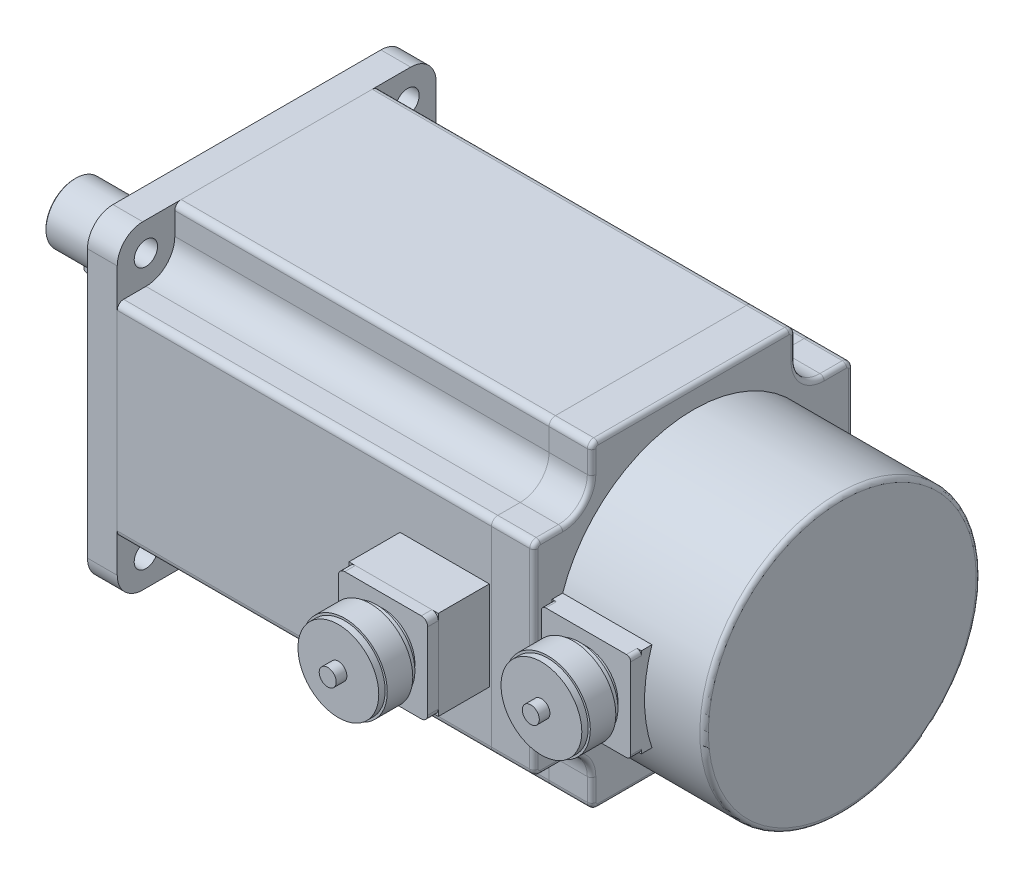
ISO-10303-21;
HEADER;
FILE_DESCRIPTION(('STEP AP214'),'2;1');
FILE_NAME('part.step','',(''),(''),'','','');
FILE_SCHEMA(('AUTOMOTIVE_DESIGN { 1 0 10303 214 1 1 1 1 }'));
ENDSEC;
DATA;
#1=APPLICATION_CONTEXT('core data for automotive mechanical design processes');
#2=APPLICATION_PROTOCOL_DEFINITION('international standard','automotive_design',2000,#1);
#3=PRODUCT_CONTEXT('',#1,'mechanical');
#4=PRODUCT('Part','Part','',(#3));
#5=PRODUCT_RELATED_PRODUCT_CATEGORY('part','',(#4));
#6=PRODUCT_DEFINITION_FORMATION('','',#4);
#7=PRODUCT_DEFINITION_CONTEXT('part definition',#1,'design');
#8=PRODUCT_DEFINITION('design','',#6,#7);
#9=PRODUCT_DEFINITION_SHAPE('','',#8);
#10=(LENGTH_UNIT() NAMED_UNIT(*) SI_UNIT(.MILLI.,.METRE.));
#11=(NAMED_UNIT(*) PLANE_ANGLE_UNIT() SI_UNIT($,.RADIAN.));
#12=(NAMED_UNIT(*) SI_UNIT($,.STERADIAN.) SOLID_ANGLE_UNIT());
#13=UNCERTAINTY_MEASURE_WITH_UNIT(LENGTH_MEASURE(1.E-05),#10,'distance_accuracy_value','');
#14=(GEOMETRIC_REPRESENTATION_CONTEXT(3) GLOBAL_UNCERTAINTY_ASSIGNED_CONTEXT((#13)) GLOBAL_UNIT_ASSIGNED_CONTEXT((#10,
#11,#12)) REPRESENTATION_CONTEXT('',''));
#15=CARTESIAN_POINT('',(0.,0.,0.));
#16=DIRECTION('',(0.,0.,1.));
#17=DIRECTION('',(1.,0.,0.));
#18=AXIS2_PLACEMENT_3D('',#15,#16,#17);
#19=CARTESIAN_POINT('',(-261.,-18.,0.));
#20=DIRECTION('',(0.,1.,0.));
#21=DIRECTION('',(0.,0.,1.));
#22=AXIS2_PLACEMENT_3D('',#19,#20,#21);
#23=CYLINDRICAL_SURFACE('',#22,3.99999999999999);
#24=CARTESIAN_POINT('',(-261.,-10.,0.));
#25=DIRECTION('',(0.,-1.,0.));
#26=DIRECTION('',(0.,0.,-1.));
#27=AXIS2_PLACEMENT_3D('',#24,#25,#26);
#28=CIRCLE('',#27,3.99999999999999);
#29=CARTESIAN_POINT('',(-261.,-10.,3.99999999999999));
#30=VERTEX_POINT('',#29);
#31=CARTESIAN_POINT('',(-261.,-10.,-3.99999999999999));
#32=VERTEX_POINT('',#31);
#33=EDGE_CURVE('E107',#30,#32,#28,.T.);
#34=ORIENTED_EDGE('',*,*,#33,.T.);
#35=DIRECTION('',(0.,1.,0.));
#36=VECTOR('',#35,1.);
#37=CARTESIAN_POINT('',(-261.,-18.,-3.99999999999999));
#38=LINE('',#37,#36);
#39=CARTESIAN_POINT('',(-261.,-18.,-3.99999999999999));
#40=VERTEX_POINT('',#39);
#41=EDGE_CURVE('E12',#40,#32,#38,.T.);
#42=ORIENTED_EDGE('',*,*,#41,.F.);
#43=CARTESIAN_POINT('',(-261.,-18.,0.));
#44=DIRECTION('',(0.,-1.,0.));
#45=DIRECTION('',(0.,0.,-1.));
#46=AXIS2_PLACEMENT_3D('',#43,#44,#45);
#47=CIRCLE('',#46,3.99999999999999);
#48=CARTESIAN_POINT('',(-261.,-18.,3.99999999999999));
#49=VERTEX_POINT('',#48);
#50=EDGE_CURVE('E95',#49,#40,#47,.T.);
#51=ORIENTED_EDGE('',*,*,#50,.F.);
#52=DIRECTION('',(0.,1.,0.));
#53=VECTOR('',#52,1.);
#54=CARTESIAN_POINT('',(-261.,-18.,3.99999999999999));
#55=LINE('',#54,#53);
#56=EDGE_CURVE('E103',#49,#30,#55,.T.);
#57=ORIENTED_EDGE('',*,*,#56,.T.);
#58=EDGE_LOOP('',(#34,#42,#51,#57));
#59=FACE_BOUND('',#58,.T.);
#60=ADVANCED_FACE('F44',(#59),#23,.T.);
#61=CARTESIAN_POINT('',(-214.,-18.,-3.99999999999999));
#62=DIRECTION('',(0.,0.,1.));
#63=DIRECTION('',(1.,0.,0.));
#64=AXIS2_PLACEMENT_3D('',#61,#62,#63);
#65=PLANE('',#64);
#66=DIRECTION('',(1.,0.,0.));
#67=VECTOR('',#66,1.);
#68=CARTESIAN_POINT('',(-214.,-10.,-3.99999999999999));
#69=LINE('',#68,#67);
#70=CARTESIAN_POINT('',(-214.,-10.,-3.99999999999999));
#71=VERTEX_POINT('',#70);
#72=EDGE_CURVE('E99',#32,#71,#69,.T.);
#73=ORIENTED_EDGE('',*,*,#72,.T.);
#74=DIRECTION('',(0.,1.,0.));
#75=VECTOR('',#74,1.);
#76=CARTESIAN_POINT('',(-214.,-18.,-3.99999999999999));
#77=LINE('',#76,#75);
#78=CARTESIAN_POINT('',(-214.,-18.,-3.99999999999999));
#79=VERTEX_POINT('',#78);
#80=EDGE_CURVE('E52',#79,#71,#77,.T.);
#81=ORIENTED_EDGE('',*,*,#80,.F.);
#82=DIRECTION('',(1.,0.,0.));
#83=VECTOR('',#82,1.);
#84=CARTESIAN_POINT('',(-214.,-18.,-3.99999999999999));
#85=LINE('',#84,#83);
#86=EDGE_CURVE('E90',#40,#79,#85,.T.);
#87=ORIENTED_EDGE('',*,*,#86,.F.);
#88=ORIENTED_EDGE('',*,*,#41,.T.);
#89=EDGE_LOOP('',(#73,#81,#87,#88));
#90=FACE_BOUND('',#89,.T.);
#91=ADVANCED_FACE('F98',(#90),#65,.F.);
#92=CARTESIAN_POINT('',(-214.,-18.,0.));
#93=DIRECTION('',(0.,1.,0.));
#94=DIRECTION('',(0.,0.,1.));
#95=AXIS2_PLACEMENT_3D('',#92,#93,#94);
#96=CYLINDRICAL_SURFACE('',#95,3.99999999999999);
#97=CARTESIAN_POINT('',(-214.,-10.,0.));
#98=DIRECTION('',(0.,-1.,0.));
#99=DIRECTION('',(0.,0.,-1.));
#100=AXIS2_PLACEMENT_3D('',#97,#98,#99);
#101=CIRCLE('',#100,3.99999999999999);
#102=CARTESIAN_POINT('',(-214.,-10.,3.99999999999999));
#103=VERTEX_POINT('',#102);
#104=EDGE_CURVE('E77',#71,#103,#101,.T.);
#105=ORIENTED_EDGE('',*,*,#104,.T.);
#106=DIRECTION('',(0.,1.,0.));
#107=VECTOR('',#106,1.);
#108=CARTESIAN_POINT('',(-214.,-18.,3.99999999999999));
#109=LINE('',#108,#107);
#110=CARTESIAN_POINT('',(-214.,-18.,3.99999999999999));
#111=VERTEX_POINT('',#110);
#112=EDGE_CURVE('E100',#111,#103,#109,.T.);
#113=ORIENTED_EDGE('',*,*,#112,.F.);
#114=CARTESIAN_POINT('',(-214.,-18.,0.));
#115=DIRECTION('',(0.,-1.,0.));
#116=DIRECTION('',(0.,0.,-1.));
#117=AXIS2_PLACEMENT_3D('',#114,#115,#116);
#118=CIRCLE('',#117,3.99999999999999);
#119=EDGE_CURVE('E93',#79,#111,#118,.T.);
#120=ORIENTED_EDGE('',*,*,#119,.F.);
#121=ORIENTED_EDGE('',*,*,#80,.T.);
#122=EDGE_LOOP('',(#105,#113,#120,#121));
#123=FACE_BOUND('',#122,.T.);
#124=ADVANCED_FACE('F101',(#123),#96,.T.);
#125=CARTESIAN_POINT('',(-261.,-18.,3.99999999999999));
#126=DIRECTION('',(0.,0.,-1.));
#127=DIRECTION('',(-1.,0.,0.));
#128=AXIS2_PLACEMENT_3D('',#125,#126,#127);
#129=PLANE('',#128);
#130=DIRECTION('',(-1.,0.,0.));
#131=VECTOR('',#130,1.);
#132=CARTESIAN_POINT('',(-261.,-10.,3.99999999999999));
#133=LINE('',#132,#131);
#134=EDGE_CURVE('E83',#103,#30,#133,.T.);
#135=ORIENTED_EDGE('',*,*,#134,.T.);
#136=ORIENTED_EDGE('',*,*,#56,.F.);
#137=DIRECTION('',(-1.,0.,0.));
#138=VECTOR('',#137,1.);
#139=CARTESIAN_POINT('',(-261.,-18.,3.99999999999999));
#140=LINE('',#139,#138);
#141=EDGE_CURVE('E60',#111,#49,#140,.T.);
#142=ORIENTED_EDGE('',*,*,#141,.F.);
#143=ORIENTED_EDGE('',*,*,#112,.T.);
#144=EDGE_LOOP('',(#135,#136,#142,#143));
#145=FACE_BOUND('',#144,.T.);
#146=ADVANCED_FACE('F114',(#145),#129,.F.);
#147=CARTESIAN_POINT('',(-261.,-18.,0.));
#148=DIRECTION('',(0.,-1.,0.));
#149=DIRECTION('',(0.,0.,-1.));
#150=AXIS2_PLACEMENT_3D('',#147,#148,#149);
#151=PLANE('',#150);
#152=ORIENTED_EDGE('',*,*,#50,.T.);
#153=ORIENTED_EDGE('',*,*,#86,.T.);
#154=ORIENTED_EDGE('',*,*,#119,.T.);
#155=ORIENTED_EDGE('',*,*,#141,.T.);
#156=EDGE_LOOP('',(#152,#153,#154,#155));
#157=FACE_BOUND('',#156,.T.);
#158=ADVANCED_FACE('F91',(#157),#151,.T.);
#159=CARTESIAN_POINT('',(-261.,-10.,0.));
#160=DIRECTION('',(0.,-1.,0.));
#161=DIRECTION('',(0.,0.,-1.));
#162=AXIS2_PLACEMENT_3D('',#159,#160,#161);
#163=PLANE('',#162);
#164=ORIENTED_EDGE('',*,*,#33,.F.);
#165=ORIENTED_EDGE('',*,*,#134,.F.);
#166=ORIENTED_EDGE('',*,*,#104,.F.);
#167=ORIENTED_EDGE('',*,*,#72,.F.);
#168=EDGE_LOOP('',(#164,#165,#166,#167));
#169=FACE_BOUND('',#168,.T.);
#170=ADVANCED_FACE('F117',(#169),#163,.F.);
#171=CLOSED_SHELL('',(#60,#91,#124,#146,#158,#170));
#172=MANIFOLD_SOLID_BREP('B2',#171);
#173=CARTESIAN_POINT('',(-271.,0.,0.));
#174=DIRECTION('',(1.,0.,0.));
#175=DIRECTION('',(0.,0.,-1.));
#176=AXIS2_PLACEMENT_3D('',#173,#174,#175);
#177=CYLINDRICAL_SURFACE('',#176,14.);
#178=CARTESIAN_POINT('',(-270.5,0.,0.));
#179=DIRECTION('',(-1.,0.,0.));
#180=DIRECTION('',(0.,0.,1.));
#181=AXIS2_PLACEMENT_3D('',#178,#179,#180);
#182=CIRCLE('',#181,14.);
#183=CARTESIAN_POINT('',(-270.5,0.,14.));
#184=VERTEX_POINT('',#183);
#185=EDGE_CURVE('E256',#184,#184,#182,.F.);
#186=ORIENTED_EDGE('',*,*,#185,.T.);
#187=EDGE_LOOP('',(#186));
#188=FACE_BOUND('',#187,.T.);
#189=CARTESIAN_POINT('',(-199.,0.,0.));
#190=DIRECTION('',(-1.,0.,0.));
#191=DIRECTION('',(0.,0.,1.));
#192=AXIS2_PLACEMENT_3D('',#189,#190,#191);
#193=CIRCLE('',#192,14.);
#194=CARTESIAN_POINT('',(-199.,0.,14.));
#195=VERTEX_POINT('',#194);
#196=EDGE_CURVE('E235',#195,#195,#193,.T.);
#197=ORIENTED_EDGE('',*,*,#196,.T.);
#198=EDGE_LOOP('',(#197));
#199=FACE_BOUND('',#198,.T.);
#200=CARTESIAN_POINT('',(-214.,-13.4164078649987,-3.99999999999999));
#201=CARTESIAN_POINT('',(-213.889963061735,-13.4163934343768,-4.00001343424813));
#202=CARTESIAN_POINT('',(-213.779934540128,-13.417761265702,-3.99545969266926));
#203=CARTESIAN_POINT('',(-213.560712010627,-13.4231542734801,-3.97732232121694));
#204=CARTESIAN_POINT('',(-213.451517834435,-13.4271788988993,-3.96374056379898));
#205=CARTESIAN_POINT('',(-213.234991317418,-13.4377658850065,-3.92769415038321));
#206=CARTESIAN_POINT('',(-213.127655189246,-13.4443222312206,-3.90525054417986));
#207=CARTESIAN_POINT('',(-212.915366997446,-13.4597622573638,-3.85169716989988));
#208=CARTESIAN_POINT('',(-212.810414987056,-13.4686459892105,-3.82058720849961));
#209=CARTESIAN_POINT('',(-212.500282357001,-13.4984072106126,-3.71462722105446));
#210=CARTESIAN_POINT('',(-212.299567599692,-13.5224082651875,-3.62710377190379));
#211=CARTESIAN_POINT('',(-211.915683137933,-13.5760110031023,-3.42099335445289));
#212=CARTESIAN_POINT('',(-211.732520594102,-13.6056149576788,-3.30239378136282));
#213=CARTESIAN_POINT('',(-211.383630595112,-13.6680345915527,-3.03385514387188));
#214=CARTESIAN_POINT('',(-211.21847497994,-13.7009134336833,-2.88318637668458));
#215=CARTESIAN_POINT('',(-210.91539864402,-13.7656378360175,-2.55635049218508));
#216=CARTESIAN_POINT('',(-210.777482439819,-13.7974832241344,-2.38017915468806));
#217=CARTESIAN_POINT('',(-210.53034061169,-13.8572672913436,-2.0032879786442));
#218=CARTESIAN_POINT('',(-210.42169609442,-13.885122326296,-1.80217262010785));
#219=CARTESIAN_POINT('',(-210.239992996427,-13.9330517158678,-1.38360719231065));
#220=CARTESIAN_POINT('',(-210.166925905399,-13.9531279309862,-1.16616104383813));
#221=CARTESIAN_POINT('',(-210.060331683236,-13.9827902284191,-0.727119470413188));
#222=CARTESIAN_POINT('',(-210.025822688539,-13.9926363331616,-0.505780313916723));
#223=CARTESIAN_POINT('',(-209.994226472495,-14.0016419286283,-0.0602449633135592));
#224=CARTESIAN_POINT('',(-209.997132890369,-14.0008032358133,0.163950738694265));
#225=CARTESIAN_POINT('',(-210.039612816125,-13.9887201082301,0.601961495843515));
#226=CARTESIAN_POINT('',(-210.078123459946,-13.9777773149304,0.815889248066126));
#227=CARTESIAN_POINT('',(-210.188991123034,-13.9470775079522,1.2341066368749));
#228=CARTESIAN_POINT('',(-210.261349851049,-13.9273200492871,1.43839578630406));
#229=CARTESIAN_POINT('',(-210.438618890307,-13.8807804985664,1.83414901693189));
#230=CARTESIAN_POINT('',(-210.543876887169,-13.853923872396,2.02544821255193));
#231=CARTESIAN_POINT('',(-210.783693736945,-13.7960546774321,2.38801825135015));
#232=CARTESIAN_POINT('',(-210.918258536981,-13.7650412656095,2.55928501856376));
#233=CARTESIAN_POINT('',(-211.218386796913,-13.7009177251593,2.88324485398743));
#234=CARTESIAN_POINT('',(-211.384870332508,-13.6677722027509,3.03507809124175));
#235=CARTESIAN_POINT('',(-211.741426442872,-13.6040627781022,3.30897556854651));
#236=CARTESIAN_POINT('',(-211.931505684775,-13.573499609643,3.43103136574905));
#237=CARTESIAN_POINT('',(-212.231158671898,-13.5321405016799,3.58945338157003));
#238=CARTESIAN_POINT('',(-212.333989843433,-13.5190503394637,3.63832313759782));
#239=CARTESIAN_POINT('',(-212.543626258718,-13.4948216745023,3.72718558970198));
#240=CARTESIAN_POINT('',(-212.650429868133,-13.4836823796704,3.76718189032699));
#241=CARTESIAN_POINT('',(-212.867138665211,-13.463719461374,3.83791732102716));
#242=CARTESIAN_POINT('',(-212.977040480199,-13.4548934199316,3.86866612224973));
#243=CARTESIAN_POINT('',(-213.199195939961,-13.4398293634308,3.92067829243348));
#244=CARTESIAN_POINT('',(-213.311448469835,-13.4335901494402,3.94194605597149));
#245=CARTESIAN_POINT('',(-213.519732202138,-13.4246640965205,3.97223001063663));
#246=CARTESIAN_POINT('',(-213.615545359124,-13.4215735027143,3.98264484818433));
#247=CARTESIAN_POINT('',(-213.807569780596,-13.4174428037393,3.99652828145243));
#248=CARTESIAN_POINT('',(-213.903780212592,-13.4163995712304,4.0000074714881));
#249=CARTESIAN_POINT('',(-214.,-13.4164078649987,3.99999999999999));
#250=B_SPLINE_CURVE_WITH_KNOTS('',3,(#200,#201,#202,#203,#204,#205,#206,#207,#208,#209,#210,
#211,#212,#213,#214,#215,#216,#217,#218,#219,#220,#221,#222,#223,#224,#225,#226,#227,#228,#229,
#230,#231,#232,#233,#234,#235,#236,#237,#238,#239,#240,#241,#242,#243,#244,#245,#246,#247,#248,
#249),.UNSPECIFIED.,.F.,.F.,(4,2,2,2,2,2,2,2,2,2,2,2,2,2,2,2,2,2,2,2,2,2,2,2,4),(0.,
0.329993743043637,0.659919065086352,0.98906537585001,1.31821902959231,1.97575167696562,
2.6335514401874,3.30832474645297,3.98320984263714,4.67064278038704,5.35791119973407,
6.02724874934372,6.6964725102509,7.34634193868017,7.99624417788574,8.65326120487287,
9.31041168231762,9.99056134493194,10.6709036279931,11.0143588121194,11.357674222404,
11.700629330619,12.0434253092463,12.3324405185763,12.6210139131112),.UNSPECIFIED.);
#251=CARTESIAN_POINT('',(-214.,-13.4164078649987,-3.99999999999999));
#252=VERTEX_POINT('',#251);
#253=CARTESIAN_POINT('',(-214.,-13.4164078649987,3.99999999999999));
#254=VERTEX_POINT('',#253);
#255=EDGE_CURVE('E259',#252,#254,#250,.T.);
#256=ORIENTED_EDGE('',*,*,#255,.F.);
#257=DIRECTION('',(1.,0.,0.));
#258=VECTOR('',#257,1.);
#259=CARTESIAN_POINT('',(-271.,-13.4164078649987,-3.99999999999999));
#260=LINE('',#259,#258);
#261=CARTESIAN_POINT('',(-261.,-13.4164078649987,-3.99999999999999));
#262=VERTEX_POINT('',#261);
#263=EDGE_CURVE('E42',#262,#252,#260,.T.);
#264=ORIENTED_EDGE('',*,*,#263,.F.);
#265=CARTESIAN_POINT('',(-261.,-13.4164078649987,3.99999999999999));
#266=CARTESIAN_POINT('',(-261.110036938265,-13.4163934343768,4.00001343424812));
#267=CARTESIAN_POINT('',(-261.220065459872,-13.417761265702,3.99545969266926));
#268=CARTESIAN_POINT('',(-261.439287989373,-13.4231542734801,3.97732232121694));
#269=CARTESIAN_POINT('',(-261.548482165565,-13.4271788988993,3.96374056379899));
#270=CARTESIAN_POINT('',(-261.765008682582,-13.4377658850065,3.92769415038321));
#271=CARTESIAN_POINT('',(-261.872344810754,-13.4443222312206,3.90525054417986));
#272=CARTESIAN_POINT('',(-262.084633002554,-13.4597622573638,3.85169716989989));
#273=CARTESIAN_POINT('',(-262.189585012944,-13.4686459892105,3.82058720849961));
#274=CARTESIAN_POINT('',(-262.499717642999,-13.4984072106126,3.71462722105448));
#275=CARTESIAN_POINT('',(-262.700432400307,-13.5224082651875,3.62710377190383));
#276=CARTESIAN_POINT('',(-263.084316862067,-13.5760110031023,3.42099335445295));
#277=CARTESIAN_POINT('',(-263.267479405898,-13.6056149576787,3.30239378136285));
#278=CARTESIAN_POINT('',(-263.616369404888,-13.6680345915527,3.03385514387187));
#279=CARTESIAN_POINT('',(-263.78152502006,-13.7009134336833,2.88318637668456));
#280=CARTESIAN_POINT('',(-264.08460135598,-13.7656378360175,2.55635049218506));
#281=CARTESIAN_POINT('',(-264.222517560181,-13.7974832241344,2.38017915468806));
#282=CARTESIAN_POINT('',(-264.46965938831,-13.8572672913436,2.00328797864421));
#283=CARTESIAN_POINT('',(-264.57830390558,-13.8851223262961,1.80217262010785));
#284=CARTESIAN_POINT('',(-264.760007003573,-13.9330517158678,1.38360719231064));
#285=CARTESIAN_POINT('',(-264.833074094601,-13.9531279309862,1.16616104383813));
#286=CARTESIAN_POINT('',(-264.939668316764,-13.9827902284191,0.7271194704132));
#287=CARTESIAN_POINT('',(-264.974177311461,-13.9926363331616,0.505780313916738));
#288=CARTESIAN_POINT('',(-265.005773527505,-14.0016419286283,0.060244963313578));
#289=CARTESIAN_POINT('',(-265.002867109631,-14.0008032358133,-0.163950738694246));
#290=CARTESIAN_POINT('',(-264.960387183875,-13.9887201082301,-0.601961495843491));
#291=CARTESIAN_POINT('',(-264.921876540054,-13.9777773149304,-0.815889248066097));
#292=CARTESIAN_POINT('',(-264.811008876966,-13.9470775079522,-1.23410663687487));
#293=CARTESIAN_POINT('',(-264.738650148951,-13.9273200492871,-1.43839578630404));
#294=CARTESIAN_POINT('',(-264.561381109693,-13.8807804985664,-1.83414901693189));
#295=CARTESIAN_POINT('',(-264.456123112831,-13.8539238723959,-2.02544821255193));
#296=CARTESIAN_POINT('',(-264.216306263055,-13.7960546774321,-2.38801825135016));
#297=CARTESIAN_POINT('',(-264.081741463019,-13.7650412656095,-2.55928501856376));
#298=CARTESIAN_POINT('',(-263.781613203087,-13.7009177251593,-2.88324485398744));
#299=CARTESIAN_POINT('',(-263.615129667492,-13.6677722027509,-3.03507809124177));
#300=CARTESIAN_POINT('',(-263.258573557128,-13.6040627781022,-3.30897556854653));
#301=CARTESIAN_POINT('',(-263.068494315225,-13.573499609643,-3.43103136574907));
#302=CARTESIAN_POINT('',(-262.768841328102,-13.5321405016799,-3.58945338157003));
#303=CARTESIAN_POINT('',(-262.666010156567,-13.5190503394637,-3.63832313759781));
#304=CARTESIAN_POINT('',(-262.456373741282,-13.4948216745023,-3.72718558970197));
#305=CARTESIAN_POINT('',(-262.349570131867,-13.4836823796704,-3.76718189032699));
#306=CARTESIAN_POINT('',(-262.132861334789,-13.463719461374,-3.83791732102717));
#307=CARTESIAN_POINT('',(-262.022959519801,-13.4548934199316,-3.86866612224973));
#308=CARTESIAN_POINT('',(-261.800804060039,-13.4398293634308,-3.92067829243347));
#309=CARTESIAN_POINT('',(-261.688551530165,-13.4335901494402,-3.94194605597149));
#310=CARTESIAN_POINT('',(-261.480267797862,-13.4246640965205,-3.97223001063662));
#311=CARTESIAN_POINT('',(-261.384454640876,-13.4215735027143,-3.98264484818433));
#312=CARTESIAN_POINT('',(-261.192430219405,-13.4174428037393,-3.99652828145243));
#313=CARTESIAN_POINT('',(-261.096219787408,-13.4163995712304,-4.0000074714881));
#314=CARTESIAN_POINT('',(-261.,-13.4164078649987,-3.99999999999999));
#315=B_SPLINE_CURVE_WITH_KNOTS('',3,(#265,#266,#267,#268,#269,#270,#271,#272,#273,#274,#275,
#276,#277,#278,#279,#280,#281,#282,#283,#284,#285,#286,#287,#288,#289,#290,#291,#292,#293,#294,
#295,#296,#297,#298,#299,#300,#301,#302,#303,#304,#305,#306,#307,#308,#309,#310,#311,#312,#313,
#314),.UNSPECIFIED.,.F.,.F.,(4,2,2,2,2,2,2,2,2,2,2,2,2,2,2,2,2,2,2,2,2,2,2,2,4),(0.,
0.32999374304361,0.659919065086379,0.989065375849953,1.31821902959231,1.97575167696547,
2.6335514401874,3.30832474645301,3.98320984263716,4.67064278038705,5.35791119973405,
6.02724874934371,6.69647251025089,7.34634193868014,7.99624417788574,8.65326120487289,
9.31041168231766,9.99056134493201,10.6709036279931,11.0143588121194,11.357674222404,
11.700629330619,12.0434253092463,12.3324405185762,12.6210139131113),.UNSPECIFIED.);
#316=CARTESIAN_POINT('',(-261.,-13.4164078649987,3.99999999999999));
#317=VERTEX_POINT('',#316);
#318=EDGE_CURVE('E184',#317,#262,#315,.T.);
#319=ORIENTED_EDGE('',*,*,#318,.F.);
#320=DIRECTION('',(1.,0.,0.));
#321=VECTOR('',#320,1.);
#322=CARTESIAN_POINT('',(-271.,-13.4164078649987,3.99999999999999));
#323=LINE('',#322,#321);
#324=EDGE_CURVE('E234',#254,#317,#323,.F.);
#325=ORIENTED_EDGE('',*,*,#324,.F.);
#326=EDGE_LOOP('',(#256,#264,#319,#325));
#327=FACE_BOUND('',#326,.T.);
#328=ADVANCED_FACE('F176',(#188,#199,#327),#177,.T.);
#329=CARTESIAN_POINT('',(-199.,0.,0.));
#330=DIRECTION('',(-1.,0.,0.));
#331=DIRECTION('',(0.,0.,1.));
#332=AXIS2_PLACEMENT_3D('',#329,#330,#331);
#333=PLANE('',#332);
#334=CARTESIAN_POINT('',(-199.,0.,0.));
#335=DIRECTION('',(-1.,0.,0.));
#336=DIRECTION('',(0.,0.,1.));
#337=AXIS2_PLACEMENT_3D('',#334,#335,#336);
#338=CIRCLE('',#337,17.);
#339=CARTESIAN_POINT('',(-199.,0.,17.));
#340=VERTEX_POINT('',#339);
#341=EDGE_CURVE('E247',#340,#340,#338,.T.);
#342=ORIENTED_EDGE('',*,*,#341,.T.);
#343=EDGE_LOOP('',(#342));
#344=FACE_BOUND('',#343,.T.);
#345=ORIENTED_EDGE('',*,*,#196,.F.);
#346=EDGE_LOOP('',(#345));
#347=FACE_BOUND('',#346,.T.);
#348=ADVANCED_FACE('F296',(#344,#347),#333,.T.);
#349=CARTESIAN_POINT('',(-199.,0.,0.));
#350=DIRECTION('',(1.,0.,0.));
#351=DIRECTION('',(0.,0.,-1.));
#352=AXIS2_PLACEMENT_3D('',#349,#350,#351);
#353=CYLINDRICAL_SURFACE('',#352,17.5);
#354=CARTESIAN_POINT('',(-198.5,0.,0.));
#355=DIRECTION('',(-1.,0.,0.));
#356=DIRECTION('',(0.,0.,1.));
#357=AXIS2_PLACEMENT_3D('',#354,#355,#356);
#358=CIRCLE('',#357,17.5);
#359=CARTESIAN_POINT('',(-198.5,0.,17.5));
#360=VERTEX_POINT('',#359);
#361=EDGE_CURVE('E250',#360,#360,#358,.F.);
#362=ORIENTED_EDGE('',*,*,#361,.T.);
#363=EDGE_LOOP('',(#362));
#364=FACE_BOUND('',#363,.T.);
#365=CARTESIAN_POINT('',(-196.,0.,0.));
#366=DIRECTION('',(-1.,0.,0.));
#367=DIRECTION('',(0.,0.,1.));
#368=AXIS2_PLACEMENT_3D('',#365,#366,#367);
#369=CIRCLE('',#368,17.5);
#370=CARTESIAN_POINT('',(-196.,0.,17.5));
#371=VERTEX_POINT('',#370);
#372=EDGE_CURVE('E239',#371,#371,#369,.T.);
#373=ORIENTED_EDGE('',*,*,#372,.T.);
#374=EDGE_LOOP('',(#373));
#375=FACE_BOUND('',#374,.T.);
#376=ADVANCED_FACE('F301',(#364,#375),#353,.T.);
#377=CARTESIAN_POINT('',(-196.,0.,0.));
#378=DIRECTION('',(-1.,0.,0.));
#379=DIRECTION('',(0.,0.,1.));
#380=AXIS2_PLACEMENT_3D('',#377,#378,#379);
#381=PLANE('',#380);
#382=ORIENTED_EDGE('',*,*,#372,.F.);
#383=EDGE_LOOP('',(#382));
#384=FACE_BOUND('',#383,.T.);
#385=ADVANCED_FACE('F317',(#384),#381,.F.);
#386=CARTESIAN_POINT('',(-198.5,0.,0.));
#387=DIRECTION('',(-1.,0.,0.));
#388=DIRECTION('',(0.,0.,1.));
#389=AXIS2_PLACEMENT_3D('',#386,#387,#388);
#390=TOROIDAL_SURFACE('',#389,17.,0.5);
#391=ORIENTED_EDGE('',*,*,#361,.F.);
#392=EDGE_LOOP('',(#391));
#393=FACE_BOUND('',#392,.T.);
#394=ORIENTED_EDGE('',*,*,#341,.F.);
#395=EDGE_LOOP('',(#394));
#396=FACE_BOUND('',#395,.T.);
#397=ADVANCED_FACE('F313',(#393,#396),#390,.T.);
#398=CARTESIAN_POINT('',(-271.,0.,0.));
#399=DIRECTION('',(-1.,0.,0.));
#400=DIRECTION('',(0.,0.,1.));
#401=AXIS2_PLACEMENT_3D('',#398,#399,#400);
#402=PLANE('',#401);
#403=CARTESIAN_POINT('',(-271.,0.,0.));
#404=DIRECTION('',(-1.,0.,0.));
#405=DIRECTION('',(0.,0.,1.));
#406=AXIS2_PLACEMENT_3D('',#403,#404,#405);
#407=CIRCLE('',#406,13.5);
#408=CARTESIAN_POINT('',(-271.,0.,13.5));
#409=VERTEX_POINT('',#408);
#410=EDGE_CURVE('E253',#409,#409,#407,.T.);
#411=ORIENTED_EDGE('',*,*,#410,.T.);
#412=EDGE_LOOP('',(#411));
#413=FACE_BOUND('',#412,.T.);
#414=ADVANCED_FACE('F281',(#413),#402,.T.);
#415=CARTESIAN_POINT('',(-271.,0.,0.));
#416=DIRECTION('',(1.,0.,0.));
#417=DIRECTION('',(0.,0.,-1.));
#418=AXIS2_PLACEMENT_3D('',#415,#416,#417);
#419=CONICAL_SURFACE('',#418,13.5,0.78539816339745);
#420=ORIENTED_EDGE('',*,*,#185,.F.);
#421=EDGE_LOOP('',(#420));
#422=FACE_BOUND('',#421,.T.);
#423=ORIENTED_EDGE('',*,*,#410,.F.);
#424=EDGE_LOOP('',(#423));
#425=FACE_BOUND('',#424,.T.);
#426=ADVANCED_FACE('F178',(#422,#425),#419,.T.);
#427=CARTESIAN_POINT('',(-261.,-10.,0.));
#428=DIRECTION('',(0.,-1.,0.));
#429=DIRECTION('',(0.,0.,-1.));
#430=AXIS2_PLACEMENT_3D('',#427,#428,#429);
#431=CYLINDRICAL_SURFACE('',#430,3.99999999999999);
#432=DIRECTION('',(0.,-1.,0.));
#433=VECTOR('',#432,1.);
#434=CARTESIAN_POINT('',(-261.,-10.,3.99999999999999));
#435=LINE('',#434,#433);
#436=CARTESIAN_POINT('',(-261.,-10.,3.99999999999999));
#437=VERTEX_POINT('',#436);
#438=EDGE_CURVE('E231',#437,#317,#435,.T.);
#439=ORIENTED_EDGE('',*,*,#438,.T.);
#440=ORIENTED_EDGE('',*,*,#318,.T.);
#441=DIRECTION('',(0.,-1.,0.));
#442=VECTOR('',#441,1.);
#443=CARTESIAN_POINT('',(-261.,-10.,-3.99999999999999));
#444=LINE('',#443,#442);
#445=CARTESIAN_POINT('',(-261.,-10.,-3.99999999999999));
#446=VERTEX_POINT('',#445);
#447=EDGE_CURVE('E190',#446,#262,#444,.T.);
#448=ORIENTED_EDGE('',*,*,#447,.F.);
#449=CARTESIAN_POINT('',(-261.,-10.,0.));
#450=DIRECTION('',(0.,1.,0.));
#451=DIRECTION('',(0.,0.,1.));
#452=AXIS2_PLACEMENT_3D('',#449,#450,#451);
#453=CIRCLE('',#452,3.99999999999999);
#454=EDGE_CURVE('E221',#446,#437,#453,.T.);
#455=ORIENTED_EDGE('',*,*,#454,.T.);
#456=EDGE_LOOP('',(#439,#440,#448,#455));
#457=FACE_BOUND('',#456,.T.);
#458=ADVANCED_FACE('F230',(#457),#431,.F.);
#459=CARTESIAN_POINT('',(-261.,-10.,3.99999999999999));
#460=DIRECTION('',(0.,0.,-1.));
#461=DIRECTION('',(-1.,0.,0.));
#462=AXIS2_PLACEMENT_3D('',#459,#460,#461);
#463=PLANE('',#462);
#464=ORIENTED_EDGE('',*,*,#324,.T.);
#465=ORIENTED_EDGE('',*,*,#438,.F.);
#466=DIRECTION('',(1.,0.,0.));
#467=VECTOR('',#466,1.);
#468=CARTESIAN_POINT('',(-261.,-10.,3.99999999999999));
#469=LINE('',#468,#467);
#470=CARTESIAN_POINT('',(-214.,-10.,3.99999999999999));
#471=VERTEX_POINT('',#470);
#472=EDGE_CURVE('E217',#437,#471,#469,.T.);
#473=ORIENTED_EDGE('',*,*,#472,.T.);
#474=DIRECTION('',(0.,-1.,0.));
#475=VECTOR('',#474,1.);
#476=CARTESIAN_POINT('',(-214.,-10.,3.99999999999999));
#477=LINE('',#476,#475);
#478=EDGE_CURVE('E236',#471,#254,#477,.T.);
#479=ORIENTED_EDGE('',*,*,#478,.T.);
#480=EDGE_LOOP('',(#464,#465,#473,#479));
#481=FACE_BOUND('',#480,.T.);
#482=ADVANCED_FACE('F233',(#481),#463,.T.);
#483=CARTESIAN_POINT('',(-214.,-10.,0.));
#484=DIRECTION('',(0.,-1.,0.));
#485=DIRECTION('',(0.,0.,-1.));
#486=AXIS2_PLACEMENT_3D('',#483,#484,#485);
#487=CYLINDRICAL_SURFACE('',#486,3.99999999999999);
#488=DIRECTION('',(0.,-1.,0.));
#489=VECTOR('',#488,1.);
#490=CARTESIAN_POINT('',(-214.,-10.,-3.99999999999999));
#491=LINE('',#490,#489);
#492=CARTESIAN_POINT('',(-214.,-10.,-3.99999999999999));
#493=VERTEX_POINT('',#492);
#494=EDGE_CURVE('E241',#493,#252,#491,.T.);
#495=ORIENTED_EDGE('',*,*,#494,.T.);
#496=ORIENTED_EDGE('',*,*,#255,.T.);
#497=ORIENTED_EDGE('',*,*,#478,.F.);
#498=CARTESIAN_POINT('',(-214.,-10.,0.));
#499=DIRECTION('',(0.,1.,0.));
#500=DIRECTION('',(0.,0.,1.));
#501=AXIS2_PLACEMENT_3D('',#498,#499,#500);
#502=CIRCLE('',#501,3.99999999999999);
#503=EDGE_CURVE('E222',#471,#493,#502,.T.);
#504=ORIENTED_EDGE('',*,*,#503,.T.);
#505=EDGE_LOOP('',(#495,#496,#497,#504));
#506=FACE_BOUND('',#505,.T.);
#507=ADVANCED_FACE('F269',(#506),#487,.F.);
#508=CARTESIAN_POINT('',(-214.,-10.,-3.99999999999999));
#509=DIRECTION('',(0.,0.,1.));
#510=DIRECTION('',(1.,0.,0.));
#511=AXIS2_PLACEMENT_3D('',#508,#509,#510);
#512=PLANE('',#511);
#513=ORIENTED_EDGE('',*,*,#263,.T.);
#514=ORIENTED_EDGE('',*,*,#494,.F.);
#515=DIRECTION('',(-1.,0.,0.));
#516=VECTOR('',#515,1.);
#517=CARTESIAN_POINT('',(-214.,-10.,-3.99999999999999));
#518=LINE('',#517,#516);
#519=EDGE_CURVE('E287',#493,#446,#518,.T.);
#520=ORIENTED_EDGE('',*,*,#519,.T.);
#521=ORIENTED_EDGE('',*,*,#447,.T.);
#522=EDGE_LOOP('',(#513,#514,#520,#521));
#523=FACE_BOUND('',#522,.T.);
#524=ADVANCED_FACE('F274',(#523),#512,.T.);
#525=CARTESIAN_POINT('',(-261.,-10.,0.));
#526=DIRECTION('',(0.,1.,0.));
#527=DIRECTION('',(0.,0.,1.));
#528=AXIS2_PLACEMENT_3D('',#525,#526,#527);
#529=PLANE('',#528);
#530=ORIENTED_EDGE('',*,*,#454,.F.);
#531=ORIENTED_EDGE('',*,*,#519,.F.);
#532=ORIENTED_EDGE('',*,*,#503,.F.);
#533=ORIENTED_EDGE('',*,*,#472,.F.);
#534=EDGE_LOOP('',(#530,#531,#532,#533));
#535=FACE_BOUND('',#534,.T.);
#536=ADVANCED_FACE('F219',(#535),#529,.F.);
#537=CLOSED_SHELL('',(#328,#348,#376,#385,#397,#414,#426,#458,#482,#507,#524,#536));
#538=MANIFOLD_SOLID_BREP('B6',#537);
#539=CARTESIAN_POINT('',(-22.,0.,125.));
#540=DIRECTION('',(0.,0.,1.));
#541=DIRECTION('',(1.,0.,0.));
#542=AXIS2_PLACEMENT_3D('',#539,#540,#541);
#543=PLANE('',#542);
#544=CARTESIAN_POINT('',(-22.,0.,125.));
#545=DIRECTION('',(0.,0.,1.));
#546=DIRECTION('',(1.,0.,0.));
#547=AXIS2_PLACEMENT_3D('',#544,#545,#546);
#548=CIRCLE('',#547,19.);
#549=CARTESIAN_POINT('',(-3.,0.,125.));
#550=VERTEX_POINT('',#549);
#551=EDGE_CURVE('E419',#550,#550,#548,.T.);
#552=ORIENTED_EDGE('',*,*,#551,.T.);
#553=EDGE_LOOP('',(#552));
#554=FACE_BOUND('',#553,.T.);
#555=CARTESIAN_POINT('',(-22.,0.,125.));
#556=DIRECTION('',(0.,0.,1.));
#557=DIRECTION('',(1.,0.,0.));
#558=AXIS2_PLACEMENT_3D('',#555,#556,#557);
#559=CIRCLE('',#558,4.);
#560=CARTESIAN_POINT('',(-18.,0.,125.));
#561=VERTEX_POINT('',#560);
#562=EDGE_CURVE('E427',#561,#561,#559,.T.);
#563=ORIENTED_EDGE('',*,*,#562,.F.);
#564=EDGE_LOOP('',(#563));
#565=FACE_BOUND('',#564,.T.);
#566=ADVANCED_FACE('F408',(#554,#565),#543,.T.);
#567=CARTESIAN_POINT('',(-22.,0.,122.));
#568=DIRECTION('',(0.,0.,1.));
#569=DIRECTION('',(1.,0.,0.));
#570=AXIS2_PLACEMENT_3D('',#567,#568,#569);
#571=PLANE('',#570);
#572=CARTESIAN_POINT('',(-22.,0.,122.));
#573=DIRECTION('',(0.,0.,1.));
#574=DIRECTION('',(1.,0.,0.));
#575=AXIS2_PLACEMENT_3D('',#572,#573,#574);
#576=CIRCLE('',#575,20.);
#577=CARTESIAN_POINT('',(-2.,0.,122.));
#578=VERTEX_POINT('',#577);
#579=EDGE_CURVE('E175',#578,#578,#576,.T.);
#580=ORIENTED_EDGE('',*,*,#579,.T.);
#581=EDGE_LOOP('',(#580));
#582=FACE_BOUND('',#581,.T.);
#583=CARTESIAN_POINT('',(-22.,0.,122.));
#584=DIRECTION('',(0.,0.,1.));
#585=DIRECTION('',(1.,0.,0.));
#586=AXIS2_PLACEMENT_3D('',#583,#584,#585);
#587=CIRCLE('',#586,19.);
#588=CARTESIAN_POINT('',(-3.,0.,122.));
#589=VERTEX_POINT('',#588);
#590=EDGE_CURVE('E421',#589,#589,#587,.T.);
#591=ORIENTED_EDGE('',*,*,#590,.F.);
#592=EDGE_LOOP('',(#591));
#593=FACE_BOUND('',#592,.T.);
#594=ADVANCED_FACE('F443',(#582,#593),#571,.T.);
#595=CARTESIAN_POINT('',(-22.,0.,122.));
#596=DIRECTION('',(0.,0.,-1.));
#597=DIRECTION('',(-1.,0.,0.));
#598=AXIS2_PLACEMENT_3D('',#595,#596,#597);
#599=CYLINDRICAL_SURFACE('',#598,20.);
#600=ORIENTED_EDGE('',*,*,#579,.F.);
#601=EDGE_LOOP('',(#600));
#602=FACE_BOUND('',#601,.T.);
#603=CARTESIAN_POINT('',(-22.,0.,110.));
#604=DIRECTION('',(0.,0.,1.));
#605=DIRECTION('',(1.,0.,0.));
#606=AXIS2_PLACEMENT_3D('',#603,#604,#605);
#607=CIRCLE('',#606,20.);
#608=CARTESIAN_POINT('',(-2.,0.,110.));
#609=VERTEX_POINT('',#608);
#610=EDGE_CURVE('E412',#609,#609,#607,.T.);
#611=ORIENTED_EDGE('',*,*,#610,.T.);
#612=EDGE_LOOP('',(#611));
#613=FACE_BOUND('',#612,.T.);
#614=ADVANCED_FACE('F410',(#602,#613),#599,.T.);
#615=CARTESIAN_POINT('',(-22.,0.,110.));
#616=DIRECTION('',(0.,0.,1.));
#617=DIRECTION('',(1.,0.,0.));
#618=AXIS2_PLACEMENT_3D('',#615,#616,#617);
#619=PLANE('',#618);
#620=ORIENTED_EDGE('',*,*,#610,.F.);
#621=EDGE_LOOP('',(#620));
#622=FACE_BOUND('',#621,.T.);
#623=ADVANCED_FACE('F453',(#622),#619,.F.);
#624=CARTESIAN_POINT('',(-22.,0.,125.));
#625=DIRECTION('',(0.,0.,-1.));
#626=DIRECTION('',(-1.,0.,0.));
#627=AXIS2_PLACEMENT_3D('',#624,#625,#626);
#628=CYLINDRICAL_SURFACE('',#627,19.);
#629=ORIENTED_EDGE('',*,*,#551,.F.);
#630=EDGE_LOOP('',(#629));
#631=FACE_BOUND('',#630,.T.);
#632=ORIENTED_EDGE('',*,*,#590,.T.);
#633=EDGE_LOOP('',(#632));
#634=FACE_BOUND('',#633,.T.);
#635=ADVANCED_FACE('F438',(#631,#634),#628,.T.);
#636=CARTESIAN_POINT('',(-22.,0.,130.));
#637=DIRECTION('',(0.,0.,-1.));
#638=DIRECTION('',(-1.,0.,0.));
#639=AXIS2_PLACEMENT_3D('',#636,#637,#638);
#640=CYLINDRICAL_SURFACE('',#639,4.);
#641=CARTESIAN_POINT('',(-22.,0.,130.));
#642=DIRECTION('',(0.,0.,1.));
#643=DIRECTION('',(1.,0.,0.));
#644=AXIS2_PLACEMENT_3D('',#641,#642,#643);
#645=CIRCLE('',#644,4.);
#646=CARTESIAN_POINT('',(-18.,0.,130.));
#647=VERTEX_POINT('',#646);
#648=EDGE_CURVE('E424',#647,#647,#645,.T.);
#649=ORIENTED_EDGE('',*,*,#648,.F.);
#650=EDGE_LOOP('',(#649));
#651=FACE_BOUND('',#650,.T.);
#652=ORIENTED_EDGE('',*,*,#562,.T.);
#653=EDGE_LOOP('',(#652));
#654=FACE_BOUND('',#653,.T.);
#655=ADVANCED_FACE('F435',(#651,#654),#640,.T.);
#656=CARTESIAN_POINT('',(-22.,0.,130.));
#657=DIRECTION('',(0.,0.,1.));
#658=DIRECTION('',(1.,0.,0.));
#659=AXIS2_PLACEMENT_3D('',#656,#657,#658);
#660=PLANE('',#659);
#661=ORIENTED_EDGE('',*,*,#648,.T.);
#662=EDGE_LOOP('',(#661));
#663=FACE_BOUND('',#662,.T.);
#664=ADVANCED_FACE('F433',(#663),#660,.T.);
#665=CLOSED_SHELL('',(#566,#594,#614,#623,#635,#655,#664));
#666=MANIFOLD_SOLID_BREP('B36',#665);
#667=CARTESIAN_POINT('',(-22.,0.,110.));
#668=DIRECTION('',(0.,0.,-1.));
#669=DIRECTION('',(-1.,0.,0.));
#670=AXIS2_PLACEMENT_3D('',#667,#668,#669);
#671=CYLINDRICAL_SURFACE('',#670,18.);
#672=CARTESIAN_POINT('',(-22.,0.,110.));
#673=DIRECTION('',(0.,0.,1.));
#674=DIRECTION('',(1.,0.,0.));
#675=AXIS2_PLACEMENT_3D('',#672,#673,#674);
#676=CIRCLE('',#675,18.);
#677=CARTESIAN_POINT('',(-4.,0.,110.));
#678=VERTEX_POINT('',#677);
#679=EDGE_CURVE('E407',#678,#678,#676,.T.);
#680=ORIENTED_EDGE('',*,*,#679,.F.);
#681=EDGE_LOOP('',(#680));
#682=FACE_BOUND('',#681,.T.);
#683=CARTESIAN_POINT('',(-22.,0.,107.));
#684=DIRECTION('',(0.,0.,1.));
#685=DIRECTION('',(1.,0.,0.));
#686=AXIS2_PLACEMENT_3D('',#683,#684,#685);
#687=CIRCLE('',#686,18.);
#688=CARTESIAN_POINT('',(-4.,0.,107.));
#689=VERTEX_POINT('',#688);
#690=EDGE_CURVE('E520',#689,#689,#687,.T.);
#691=ORIENTED_EDGE('',*,*,#690,.T.);
#692=EDGE_LOOP('',(#691));
#693=FACE_BOUND('',#692,.T.);
#694=ADVANCED_FACE('F517',(#682,#693),#671,.T.);
#695=CARTESIAN_POINT('',(-22.,0.,110.));
#696=DIRECTION('',(0.,0.,1.));
#697=DIRECTION('',(1.,0.,0.));
#698=AXIS2_PLACEMENT_3D('',#695,#696,#697);
#699=PLANE('',#698);
#700=ORIENTED_EDGE('',*,*,#679,.T.);
#701=EDGE_LOOP('',(#700));
#702=FACE_BOUND('',#701,.T.);
#703=ADVANCED_FACE('F532',(#702),#699,.T.);
#704=CARTESIAN_POINT('',(-22.,0.,107.));
#705=DIRECTION('',(0.,0.,1.));
#706=DIRECTION('',(1.,0.,0.));
#707=AXIS2_PLACEMENT_3D('',#704,#705,#706);
#708=PLANE('',#707);
#709=ORIENTED_EDGE('',*,*,#690,.F.);
#710=EDGE_LOOP('',(#709));
#711=FACE_BOUND('',#710,.T.);
#712=ADVANCED_FACE('F530',(#711),#708,.F.);
#713=CLOSED_SHELL('',(#694,#703,#712));
#714=MANIFOLD_SOLID_BREP('B170',#713);
#715=CARTESIAN_POINT('',(-22.,0.,107.));
#716=DIRECTION('',(0.,0.,-1.));
#717=DIRECTION('',(-1.,0.,0.));
#718=AXIS2_PLACEMENT_3D('',#715,#716,#717);
#719=CYLINDRICAL_SURFACE('',#718,15.);
#720=CARTESIAN_POINT('',(-22.,0.,107.));
#721=DIRECTION('',(0.,0.,1.));
#722=DIRECTION('',(1.,0.,0.));
#723=AXIS2_PLACEMENT_3D('',#720,#721,#722);
#724=CIRCLE('',#723,15.);
#725=CARTESIAN_POINT('',(-7.,0.,107.));
#726=VERTEX_POINT('',#725);
#727=EDGE_CURVE('E516',#726,#726,#724,.T.);
#728=ORIENTED_EDGE('',*,*,#727,.F.);
#729=EDGE_LOOP('',(#728));
#730=FACE_BOUND('',#729,.T.);
#731=CARTESIAN_POINT('',(-22.,0.,104.));
#732=DIRECTION('',(0.,0.,1.));
#733=DIRECTION('',(1.,0.,0.));
#734=AXIS2_PLACEMENT_3D('',#731,#732,#733);
#735=CIRCLE('',#734,15.);
#736=CARTESIAN_POINT('',(-7.,0.,104.));
#737=VERTEX_POINT('',#736);
#738=EDGE_CURVE('E571',#737,#737,#735,.T.);
#739=ORIENTED_EDGE('',*,*,#738,.T.);
#740=EDGE_LOOP('',(#739));
#741=FACE_BOUND('',#740,.T.);
#742=ADVANCED_FACE('F568',(#730,#741),#719,.T.);
#743=CARTESIAN_POINT('',(-22.,0.,107.));
#744=DIRECTION('',(0.,0.,1.));
#745=DIRECTION('',(1.,0.,0.));
#746=AXIS2_PLACEMENT_3D('',#743,#744,#745);
#747=PLANE('',#746);
#748=ORIENTED_EDGE('',*,*,#727,.T.);
#749=EDGE_LOOP('',(#748));
#750=FACE_BOUND('',#749,.T.);
#751=ADVANCED_FACE('F583',(#750),#747,.T.);
#752=CARTESIAN_POINT('',(-22.,0.,104.));
#753=DIRECTION('',(0.,0.,1.));
#754=DIRECTION('',(1.,0.,0.));
#755=AXIS2_PLACEMENT_3D('',#752,#753,#754);
#756=PLANE('',#755);
#757=ORIENTED_EDGE('',*,*,#738,.F.);
#758=EDGE_LOOP('',(#757));
#759=FACE_BOUND('',#758,.T.);
#760=ADVANCED_FACE('F581',(#759),#756,.F.);
#761=CLOSED_SHELL('',(#742,#751,#760));
#762=MANIFOLD_SOLID_BREP('B402',#761);
#763=CARTESIAN_POINT('',(-40.,-18.,104.));
#764=DIRECTION('',(0.,0.,-1.));
#765=DIRECTION('',(-1.,0.,0.));
#766=AXIS2_PLACEMENT_3D('',#763,#764,#765);
#767=CYLINDRICAL_SURFACE('',#766,3.);
#768=CARTESIAN_POINT('',(-40.,-18.,99.));
#769=DIRECTION('',(0.,0.,1.));
#770=DIRECTION('',(-1.,0.,0.));
#771=AXIS2_PLACEMENT_3D('',#768,#769,#770);
#772=CIRCLE('',#771,3.);
#773=CARTESIAN_POINT('',(-43.,-18.,99.));
#774=VERTEX_POINT('',#773);
#775=CARTESIAN_POINT('',(-40.,-21.,99.));
#776=VERTEX_POINT('',#775);
#777=EDGE_CURVE('E715',#774,#776,#772,.T.);
#778=ORIENTED_EDGE('',*,*,#777,.T.);
#779=DIRECTION('',(0.,0.,-1.));
#780=VECTOR('',#779,1.);
#781=CARTESIAN_POINT('',(-40.,-21.,104.));
#782=LINE('',#781,#780);
#783=CARTESIAN_POINT('',(-40.,-21.,104.));
#784=VERTEX_POINT('',#783);
#785=EDGE_CURVE('E566',#784,#776,#782,.T.);
#786=ORIENTED_EDGE('',*,*,#785,.F.);
#787=CARTESIAN_POINT('',(-40.,-18.,104.));
#788=DIRECTION('',(0.,0.,1.));
#789=DIRECTION('',(-1.,0.,0.));
#790=AXIS2_PLACEMENT_3D('',#787,#788,#789);
#791=CIRCLE('',#790,3.);
#792=CARTESIAN_POINT('',(-43.,-18.,104.));
#793=VERTEX_POINT('',#792);
#794=EDGE_CURVE('E729',#793,#784,#791,.T.);
#795=ORIENTED_EDGE('',*,*,#794,.F.);
#796=DIRECTION('',(0.,0.,-1.));
#797=VECTOR('',#796,1.);
#798=CARTESIAN_POINT('',(-43.,-18.,104.));
#799=LINE('',#798,#797);
#800=EDGE_CURVE('E711',#793,#774,#799,.T.);
#801=ORIENTED_EDGE('',*,*,#800,.T.);
#802=EDGE_LOOP('',(#778,#786,#795,#801));
#803=FACE_BOUND('',#802,.T.);
#804=ADVANCED_FACE('F619',(#803),#767,.T.);
#805=CARTESIAN_POINT('',(-40.,-21.,104.));
#806=DIRECTION('',(0.,1.,0.));
#807=DIRECTION('',(0.,0.,1.));
#808=AXIS2_PLACEMENT_3D('',#805,#806,#807);
#809=PLANE('',#808);
#810=DIRECTION('',(1.,0.,0.));
#811=VECTOR('',#810,1.);
#812=CARTESIAN_POINT('',(-40.,-21.,99.));
#813=LINE('',#812,#811);
#814=CARTESIAN_POINT('',(-4.00000000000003,-21.,99.));
#815=VERTEX_POINT('',#814);
#816=EDGE_CURVE('E718',#776,#815,#813,.T.);
#817=ORIENTED_EDGE('',*,*,#816,.T.);
#818=DIRECTION('',(0.,0.,-1.));
#819=VECTOR('',#818,1.);
#820=CARTESIAN_POINT('',(-4.00000000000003,-21.,104.));
#821=LINE('',#820,#819);
#822=CARTESIAN_POINT('',(-4.00000000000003,-21.,104.));
#823=VERTEX_POINT('',#822);
#824=EDGE_CURVE('E627',#823,#815,#821,.T.);
#825=ORIENTED_EDGE('',*,*,#824,.F.);
#826=DIRECTION('',(1.,0.,0.));
#827=VECTOR('',#826,1.);
#828=CARTESIAN_POINT('',(-40.,-21.,104.));
#829=LINE('',#828,#827);
#830=EDGE_CURVE('E678',#784,#823,#829,.T.);
#831=ORIENTED_EDGE('',*,*,#830,.F.);
#832=ORIENTED_EDGE('',*,*,#785,.T.);
#833=EDGE_LOOP('',(#817,#825,#831,#832));
#834=FACE_BOUND('',#833,.T.);
#835=ADVANCED_FACE('F764',(#834),#809,.F.);
#836=CARTESIAN_POINT('',(-4.00000000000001,-18.,104.));
#837=DIRECTION('',(0.,0.,-1.));
#838=DIRECTION('',(-1.,0.,0.));
#839=AXIS2_PLACEMENT_3D('',#836,#837,#838);
#840=CYLINDRICAL_SURFACE('',#839,3.);
#841=CARTESIAN_POINT('',(-4.00000000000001,-18.,99.));
#842=DIRECTION('',(0.,0.,1.));
#843=DIRECTION('',(1.,0.,0.));
#844=AXIS2_PLACEMENT_3D('',#841,#842,#843);
#845=CIRCLE('',#844,3.);
#846=CARTESIAN_POINT('',(-1.00000000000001,-18.,99.));
#847=VERTEX_POINT('',#846);
#848=EDGE_CURVE('E720',#815,#847,#845,.T.);
#849=ORIENTED_EDGE('',*,*,#848,.T.);
#850=DIRECTION('',(0.,0.,-1.));
#851=VECTOR('',#850,1.);
#852=CARTESIAN_POINT('',(-1.00000000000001,-18.,104.));
#853=LINE('',#852,#851);
#854=CARTESIAN_POINT('',(-1.00000000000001,-18.,104.));
#855=VERTEX_POINT('',#854);
#856=EDGE_CURVE('E736',#855,#847,#853,.T.);
#857=ORIENTED_EDGE('',*,*,#856,.F.);
#858=CARTESIAN_POINT('',(-4.00000000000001,-18.,104.));
#859=DIRECTION('',(0.,0.,1.));
#860=DIRECTION('',(1.,0.,0.));
#861=AXIS2_PLACEMENT_3D('',#858,#859,#860);
#862=CIRCLE('',#861,3.);
#863=EDGE_CURVE('E744',#823,#855,#862,.T.);
#864=ORIENTED_EDGE('',*,*,#863,.F.);
#865=ORIENTED_EDGE('',*,*,#824,.T.);
#866=EDGE_LOOP('',(#849,#857,#864,#865));
#867=FACE_BOUND('',#866,.T.);
#868=ADVANCED_FACE('F742',(#867),#840,.T.);
#869=CARTESIAN_POINT('',(-1.00000000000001,-18.,104.));
#870=DIRECTION('',(-1.,0.,0.));
#871=DIRECTION('',(0.,0.,1.));
#872=AXIS2_PLACEMENT_3D('',#869,#870,#871);
#873=PLANE('',#872);
#874=DIRECTION('',(0.,1.,0.));
#875=VECTOR('',#874,1.);
#876=CARTESIAN_POINT('',(-1.00000000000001,-18.,99.));
#877=LINE('',#876,#875);
#878=CARTESIAN_POINT('',(-1.00000000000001,18.,99.));
#879=VERTEX_POINT('',#878);
#880=EDGE_CURVE('E722',#847,#879,#877,.T.);
#881=ORIENTED_EDGE('',*,*,#880,.T.);
#882=DIRECTION('',(0.,0.,-1.));
#883=VECTOR('',#882,1.);
#884=CARTESIAN_POINT('',(-1.00000000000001,18.,104.));
#885=LINE('',#884,#883);
#886=CARTESIAN_POINT('',(-1.00000000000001,18.,104.));
#887=VERTEX_POINT('',#886);
#888=EDGE_CURVE('E733',#887,#879,#885,.T.);
#889=ORIENTED_EDGE('',*,*,#888,.F.);
#890=DIRECTION('',(0.,1.,0.));
#891=VECTOR('',#890,1.);
#892=CARTESIAN_POINT('',(-1.00000000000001,-18.,104.));
#893=LINE('',#892,#891);
#894=EDGE_CURVE('E756',#855,#887,#893,.T.);
#895=ORIENTED_EDGE('',*,*,#894,.F.);
#896=ORIENTED_EDGE('',*,*,#856,.T.);
#897=EDGE_LOOP('',(#881,#889,#895,#896));
#898=FACE_BOUND('',#897,.T.);
#899=ADVANCED_FACE('F752',(#898),#873,.F.);
#900=CARTESIAN_POINT('',(-4.00000000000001,18.,104.));
#901=DIRECTION('',(0.,0.,-1.));
#902=DIRECTION('',(-1.,0.,0.));
#903=AXIS2_PLACEMENT_3D('',#900,#901,#902);
#904=CYLINDRICAL_SURFACE('',#903,3.);
#905=CARTESIAN_POINT('',(-4.00000000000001,18.,99.));
#906=DIRECTION('',(0.,0.,1.));
#907=DIRECTION('',(-1.,0.,0.));
#908=AXIS2_PLACEMENT_3D('',#905,#906,#907);
#909=CIRCLE('',#908,3.);
#910=CARTESIAN_POINT('',(-4.00000000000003,21.,99.));
#911=VERTEX_POINT('',#910);
#912=EDGE_CURVE('E724',#879,#911,#909,.T.);
#913=ORIENTED_EDGE('',*,*,#912,.T.);
#914=DIRECTION('',(0.,0.,-1.));
#915=VECTOR('',#914,1.);
#916=CARTESIAN_POINT('',(-4.00000000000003,21.,104.));
#917=LINE('',#916,#915);
#918=CARTESIAN_POINT('',(-4.00000000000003,21.,104.));
#919=VERTEX_POINT('',#918);
#920=EDGE_CURVE('E706',#919,#911,#917,.T.);
#921=ORIENTED_EDGE('',*,*,#920,.F.);
#922=CARTESIAN_POINT('',(-4.00000000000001,18.,104.));
#923=DIRECTION('',(0.,0.,1.));
#924=DIRECTION('',(-1.,0.,0.));
#925=AXIS2_PLACEMENT_3D('',#922,#923,#924);
#926=CIRCLE('',#925,3.);
#927=EDGE_CURVE('E697',#887,#919,#926,.T.);
#928=ORIENTED_EDGE('',*,*,#927,.F.);
#929=ORIENTED_EDGE('',*,*,#888,.T.);
#930=EDGE_LOOP('',(#913,#921,#928,#929));
#931=FACE_BOUND('',#930,.T.);
#932=ADVANCED_FACE('F755',(#931),#904,.T.);
#933=CARTESIAN_POINT('',(-40.,21.,104.));
#934=DIRECTION('',(0.,-1.,0.));
#935=DIRECTION('',(0.,0.,-1.));
#936=AXIS2_PLACEMENT_3D('',#933,#934,#935);
#937=PLANE('',#936);
#938=DIRECTION('',(-1.,0.,0.));
#939=VECTOR('',#938,1.);
#940=CARTESIAN_POINT('',(-40.,21.,99.));
#941=LINE('',#940,#939);
#942=CARTESIAN_POINT('',(-40.,21.,99.));
#943=VERTEX_POINT('',#942);
#944=EDGE_CURVE('E705',#911,#943,#941,.T.);
#945=ORIENTED_EDGE('',*,*,#944,.T.);
#946=DIRECTION('',(0.,0.,-1.));
#947=VECTOR('',#946,1.);
#948=CARTESIAN_POINT('',(-40.,21.,104.));
#949=LINE('',#948,#947);
#950=CARTESIAN_POINT('',(-40.,21.,104.));
#951=VERTEX_POINT('',#950);
#952=EDGE_CURVE('E702',#951,#943,#949,.T.);
#953=ORIENTED_EDGE('',*,*,#952,.F.);
#954=DIRECTION('',(-1.,0.,0.));
#955=VECTOR('',#954,1.);
#956=CARTESIAN_POINT('',(-40.,21.,104.));
#957=LINE('',#956,#955);
#958=EDGE_CURVE('E691',#919,#951,#957,.T.);
#959=ORIENTED_EDGE('',*,*,#958,.F.);
#960=ORIENTED_EDGE('',*,*,#920,.T.);
#961=EDGE_LOOP('',(#945,#953,#959,#960));
#962=FACE_BOUND('',#961,.T.);
#963=ADVANCED_FACE('F703',(#962),#937,.F.);
#964=CARTESIAN_POINT('',(-40.,18.,104.));
#965=DIRECTION('',(0.,0.,-1.));
#966=DIRECTION('',(-1.,0.,0.));
#967=AXIS2_PLACEMENT_3D('',#964,#965,#966);
#968=CYLINDRICAL_SURFACE('',#967,3.);
#969=CARTESIAN_POINT('',(-40.,18.,99.));
#970=DIRECTION('',(0.,0.,1.));
#971=DIRECTION('',(-1.,0.,0.));
#972=AXIS2_PLACEMENT_3D('',#969,#970,#971);
#973=CIRCLE('',#972,3.);
#974=CARTESIAN_POINT('',(-43.,18.,99.));
#975=VERTEX_POINT('',#974);
#976=EDGE_CURVE('E664',#943,#975,#973,.T.);
#977=ORIENTED_EDGE('',*,*,#976,.T.);
#978=DIRECTION('',(0.,0.,-1.));
#979=VECTOR('',#978,1.);
#980=CARTESIAN_POINT('',(-43.,18.,104.));
#981=LINE('',#980,#979);
#982=CARTESIAN_POINT('',(-43.,18.,104.));
#983=VERTEX_POINT('',#982);
#984=EDGE_CURVE('E707',#983,#975,#981,.T.);
#985=ORIENTED_EDGE('',*,*,#984,.F.);
#986=CARTESIAN_POINT('',(-40.,18.,104.));
#987=DIRECTION('',(0.,0.,1.));
#988=DIRECTION('',(-1.,0.,0.));
#989=AXIS2_PLACEMENT_3D('',#986,#987,#988);
#990=CIRCLE('',#989,3.);
#991=EDGE_CURVE('E695',#951,#983,#990,.T.);
#992=ORIENTED_EDGE('',*,*,#991,.F.);
#993=ORIENTED_EDGE('',*,*,#952,.T.);
#994=EDGE_LOOP('',(#977,#985,#992,#993));
#995=FACE_BOUND('',#994,.T.);
#996=ADVANCED_FACE('F709',(#995),#968,.T.);
#997=CARTESIAN_POINT('',(-43.,-18.,104.));
#998=DIRECTION('',(1.,0.,0.));
#999=DIRECTION('',(0.,0.,-1.));
#1000=AXIS2_PLACEMENT_3D('',#997,#998,#999);
#1001=PLANE('',#1000);
#1002=DIRECTION('',(0.,-1.,0.));
#1003=VECTOR('',#1002,1.);
#1004=CARTESIAN_POINT('',(-43.,-18.,99.));
#1005=LINE('',#1004,#1003);
#1006=EDGE_CURVE('E670',#975,#774,#1005,.T.);
#1007=ORIENTED_EDGE('',*,*,#1006,.T.);
#1008=ORIENTED_EDGE('',*,*,#800,.F.);
#1009=DIRECTION('',(0.,-1.,0.));
#1010=VECTOR('',#1009,1.);
#1011=CARTESIAN_POINT('',(-43.,-18.,104.));
#1012=LINE('',#1011,#1010);
#1013=EDGE_CURVE('E635',#983,#793,#1012,.T.);
#1014=ORIENTED_EDGE('',*,*,#1013,.F.);
#1015=ORIENTED_EDGE('',*,*,#984,.T.);
#1016=EDGE_LOOP('',(#1007,#1008,#1014,#1015));
#1017=FACE_BOUND('',#1016,.T.);
#1018=ADVANCED_FACE('F780',(#1017),#1001,.F.);
#1019=CARTESIAN_POINT('',(-40.,-18.,104.));
#1020=DIRECTION('',(0.,0.,-1.));
#1021=DIRECTION('',(-1.,0.,0.));
#1022=AXIS2_PLACEMENT_3D('',#1019,#1020,#1021);
#1023=PLANE('',#1022);
#1024=ORIENTED_EDGE('',*,*,#794,.T.);
#1025=ORIENTED_EDGE('',*,*,#830,.T.);
#1026=ORIENTED_EDGE('',*,*,#863,.T.);
#1027=ORIENTED_EDGE('',*,*,#894,.T.);
#1028=ORIENTED_EDGE('',*,*,#927,.T.);
#1029=ORIENTED_EDGE('',*,*,#958,.T.);
#1030=ORIENTED_EDGE('',*,*,#991,.T.);
#1031=ORIENTED_EDGE('',*,*,#1013,.T.);
#1032=EDGE_LOOP('',(#1024,#1025,#1026,#1027,#1028,#1029,#1030,#1031));
#1033=FACE_BOUND('',#1032,.T.);
#1034=ADVANCED_FACE('F693',(#1033),#1023,.F.);
#1035=CARTESIAN_POINT('',(-40.,-18.,99.));
#1036=DIRECTION('',(0.,0.,-1.));
#1037=DIRECTION('',(-1.,0.,0.));
#1038=AXIS2_PLACEMENT_3D('',#1035,#1036,#1037);
#1039=PLANE('',#1038);
#1040=ORIENTED_EDGE('',*,*,#777,.F.);
#1041=ORIENTED_EDGE('',*,*,#1006,.F.);
#1042=ORIENTED_EDGE('',*,*,#976,.F.);
#1043=ORIENTED_EDGE('',*,*,#944,.F.);
#1044=ORIENTED_EDGE('',*,*,#912,.F.);
#1045=ORIENTED_EDGE('',*,*,#880,.F.);
#1046=ORIENTED_EDGE('',*,*,#848,.F.);
#1047=ORIENTED_EDGE('',*,*,#816,.F.);
#1048=EDGE_LOOP('',(#1040,#1041,#1042,#1043,#1044,#1045,#1046,#1047));
#1049=FACE_BOUND('',#1048,.T.);
#1050=ADVANCED_FACE('F748',(#1049),#1039,.T.);
#1051=CLOSED_SHELL('',(#804,#835,#868,#899,#932,#963,#996,#1018,#1034,#1050));
#1052=MANIFOLD_SOLID_BREP('B511',#1051);
#1053=CARTESIAN_POINT('',(-0.999999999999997,-21.,99.));
#1054=DIRECTION('',(-1.,0.,0.));
#1055=DIRECTION('',(0.,-1.,0.));
#1056=AXIS2_PLACEMENT_3D('',#1053,#1054,#1055);
#1057=PLANE('',#1056);
#1058=DIRECTION('',(0.,1.,0.));
#1059=VECTOR('',#1058,1.);
#1060=CARTESIAN_POINT('',(-0.999999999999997,-21.,75.));
#1061=LINE('',#1060,#1059);
#1062=CARTESIAN_POINT('',(-0.999999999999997,-21.,75.));
#1063=VERTEX_POINT('',#1062);
#1064=CARTESIAN_POINT('',(-1.00000000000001,21.,75.));
#1065=VERTEX_POINT('',#1064);
#1066=EDGE_CURVE('E920',#1063,#1065,#1061,.T.);
#1067=ORIENTED_EDGE('',*,*,#1066,.T.);
#1068=DIRECTION('',(0.,0.,-1.));
#1069=VECTOR('',#1068,1.);
#1070=CARTESIAN_POINT('',(-1.00000000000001,21.,99.));
#1071=LINE('',#1070,#1069);
#1072=CARTESIAN_POINT('',(-1.00000000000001,21.,99.));
#1073=VERTEX_POINT('',#1072);
#1074=EDGE_CURVE('E617',#1073,#1065,#1071,.T.);
#1075=ORIENTED_EDGE('',*,*,#1074,.F.);
#1076=DIRECTION('',(0.,1.,0.));
#1077=VECTOR('',#1076,1.);
#1078=CARTESIAN_POINT('',(-0.999999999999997,-21.,99.));
#1079=LINE('',#1078,#1077);
#1080=CARTESIAN_POINT('',(-0.999999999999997,-21.,99.));
#1081=VERTEX_POINT('',#1080);
#1082=EDGE_CURVE('E908',#1081,#1073,#1079,.T.);
#1083=ORIENTED_EDGE('',*,*,#1082,.F.);
#1084=DIRECTION('',(0.,0.,-1.));
#1085=VECTOR('',#1084,1.);
#1086=CARTESIAN_POINT('',(-0.999999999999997,-21.,99.));
#1087=LINE('',#1086,#1085);
#1088=EDGE_CURVE('E916',#1081,#1063,#1087,.T.);
#1089=ORIENTED_EDGE('',*,*,#1088,.T.);
#1090=EDGE_LOOP('',(#1067,#1075,#1083,#1089));
#1091=FACE_BOUND('',#1090,.T.);
#1092=ADVANCED_FACE('F857',(#1091),#1057,.F.);
#1093=CARTESIAN_POINT('',(-43.,21.,99.));
#1094=DIRECTION('',(0.,-1.,0.));
#1095=DIRECTION('',(0.,0.,-1.));
#1096=AXIS2_PLACEMENT_3D('',#1093,#1094,#1095);
#1097=PLANE('',#1096);
#1098=DIRECTION('',(-1.,0.,0.));
#1099=VECTOR('',#1098,1.);
#1100=CARTESIAN_POINT('',(-43.,21.,75.));
#1101=LINE('',#1100,#1099);
#1102=CARTESIAN_POINT('',(-43.,21.,75.));
#1103=VERTEX_POINT('',#1102);
#1104=EDGE_CURVE('E912',#1065,#1103,#1101,.T.);
#1105=ORIENTED_EDGE('',*,*,#1104,.T.);
#1106=DIRECTION('',(0.,0.,-1.));
#1107=VECTOR('',#1106,1.);
#1108=CARTESIAN_POINT('',(-43.,21.,99.));
#1109=LINE('',#1108,#1107);
#1110=CARTESIAN_POINT('',(-43.,21.,99.));
#1111=VERTEX_POINT('',#1110);
#1112=EDGE_CURVE('E865',#1111,#1103,#1109,.T.);
#1113=ORIENTED_EDGE('',*,*,#1112,.F.);
#1114=DIRECTION('',(-1.,0.,0.));
#1115=VECTOR('',#1114,1.);
#1116=CARTESIAN_POINT('',(-43.,21.,99.));
#1117=LINE('',#1116,#1115);
#1118=EDGE_CURVE('E903',#1073,#1111,#1117,.T.);
#1119=ORIENTED_EDGE('',*,*,#1118,.F.);
#1120=ORIENTED_EDGE('',*,*,#1074,.T.);
#1121=EDGE_LOOP('',(#1105,#1113,#1119,#1120));
#1122=FACE_BOUND('',#1121,.T.);
#1123=ADVANCED_FACE('F911',(#1122),#1097,.F.);
#1124=CARTESIAN_POINT('',(-43.,-21.,99.));
#1125=DIRECTION('',(1.,0.,0.));
#1126=DIRECTION('',(0.,1.,0.));
#1127=AXIS2_PLACEMENT_3D('',#1124,#1125,#1126);
#1128=PLANE('',#1127);
#1129=DIRECTION('',(0.,-1.,0.));
#1130=VECTOR('',#1129,1.);
#1131=CARTESIAN_POINT('',(-43.,-21.,75.));
#1132=LINE('',#1131,#1130);
#1133=CARTESIAN_POINT('',(-43.,-21.,75.));
#1134=VERTEX_POINT('',#1133);
#1135=EDGE_CURVE('E890',#1103,#1134,#1132,.T.);
#1136=ORIENTED_EDGE('',*,*,#1135,.T.);
#1137=DIRECTION('',(0.,0.,-1.));
#1138=VECTOR('',#1137,1.);
#1139=CARTESIAN_POINT('',(-43.,-21.,99.));
#1140=LINE('',#1139,#1138);
#1141=CARTESIAN_POINT('',(-43.,-21.,99.));
#1142=VERTEX_POINT('',#1141);
#1143=EDGE_CURVE('E913',#1142,#1134,#1140,.T.);
#1144=ORIENTED_EDGE('',*,*,#1143,.F.);
#1145=DIRECTION('',(0.,-1.,0.));
#1146=VECTOR('',#1145,1.);
#1147=CARTESIAN_POINT('',(-43.,-21.,99.));
#1148=LINE('',#1147,#1146);
#1149=EDGE_CURVE('E906',#1111,#1142,#1148,.T.);
#1150=ORIENTED_EDGE('',*,*,#1149,.F.);
#1151=ORIENTED_EDGE('',*,*,#1112,.T.);
#1152=EDGE_LOOP('',(#1136,#1144,#1150,#1151));
#1153=FACE_BOUND('',#1152,.T.);
#1154=ADVANCED_FACE('F914',(#1153),#1128,.F.);
#1155=CARTESIAN_POINT('',(-43.,-21.,99.));
#1156=DIRECTION('',(0.,1.,0.));
#1157=DIRECTION('',(0.,0.,1.));
#1158=AXIS2_PLACEMENT_3D('',#1155,#1156,#1157);
#1159=PLANE('',#1158);
#1160=DIRECTION('',(1.,0.,0.));
#1161=VECTOR('',#1160,1.);
#1162=CARTESIAN_POINT('',(-43.,-21.,75.));
#1163=LINE('',#1162,#1161);
#1164=EDGE_CURVE('E896',#1134,#1063,#1163,.T.);
#1165=ORIENTED_EDGE('',*,*,#1164,.T.);
#1166=ORIENTED_EDGE('',*,*,#1088,.F.);
#1167=DIRECTION('',(1.,0.,0.));
#1168=VECTOR('',#1167,1.);
#1169=CARTESIAN_POINT('',(-43.,-21.,99.));
#1170=LINE('',#1169,#1168);
#1171=EDGE_CURVE('E873',#1142,#1081,#1170,.T.);
#1172=ORIENTED_EDGE('',*,*,#1171,.F.);
#1173=ORIENTED_EDGE('',*,*,#1143,.T.);
#1174=EDGE_LOOP('',(#1165,#1166,#1172,#1173));
#1175=FACE_BOUND('',#1174,.T.);
#1176=ADVANCED_FACE('F927',(#1175),#1159,.F.);
#1177=CARTESIAN_POINT('',(0.,0.,99.));
#1178=DIRECTION('',(0.,0.,-1.));
#1179=DIRECTION('',(-1.,0.,0.));
#1180=AXIS2_PLACEMENT_3D('',#1177,#1178,#1179);
#1181=PLANE('',#1180);
#1182=ORIENTED_EDGE('',*,*,#1082,.T.);
#1183=ORIENTED_EDGE('',*,*,#1118,.T.);
#1184=ORIENTED_EDGE('',*,*,#1149,.T.);
#1185=ORIENTED_EDGE('',*,*,#1171,.T.);
#1186=EDGE_LOOP('',(#1182,#1183,#1184,#1185));
#1187=FACE_BOUND('',#1186,.T.);
#1188=ADVANCED_FACE('F904',(#1187),#1181,.F.);
#1189=CARTESIAN_POINT('',(0.,0.,75.));
#1190=DIRECTION('',(0.,0.,-1.));
#1191=DIRECTION('',(-1.,0.,0.));
#1192=AXIS2_PLACEMENT_3D('',#1189,#1190,#1191);
#1193=PLANE('',#1192);
#1194=ORIENTED_EDGE('',*,*,#1066,.F.);
#1195=ORIENTED_EDGE('',*,*,#1164,.F.);
#1196=ORIENTED_EDGE('',*,*,#1135,.F.);
#1197=ORIENTED_EDGE('',*,*,#1104,.F.);
#1198=EDGE_LOOP('',(#1194,#1195,#1196,#1197));
#1199=FACE_BOUND('',#1198,.T.);
#1200=ADVANCED_FACE('F930',(#1199),#1193,.T.);
#1201=CLOSED_SHELL('',(#1092,#1123,#1154,#1176,#1188,#1200));
#1202=MANIFOLD_SOLID_BREP('B560',#1201);
#1203=CARTESIAN_POINT('',(-190.,-63.,-63.));
#1204=DIRECTION('',(1.,0.,0.));
#1205=DIRECTION('',(0.,0.,-1.));
#1206=AXIS2_PLACEMENT_3D('',#1203,#1204,#1205);
#1207=PLANE('',#1206);
#1208=CARTESIAN_POINT('',(-190.,-63.,-63.));
#1209=DIRECTION('',(-1.,0.,0.));
#1210=DIRECTION('',(0.,0.,-1.));
#1211=AXIS2_PLACEMENT_3D('',#1208,#1209,#1210);
#1212=CIRCLE('',#1211,12.);
#1213=CARTESIAN_POINT('',(-190.,-62.9999999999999,-75.));
#1214=VERTEX_POINT('',#1213);
#1215=CARTESIAN_POINT('',(-190.,-75.,-62.9999999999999));
#1216=VERTEX_POINT('',#1215);
#1217=EDGE_CURVE('E1104',#1214,#1216,#1212,.T.);
#1218=ORIENTED_EDGE('',*,*,#1217,.T.);
#1219=DIRECTION('',(0.,0.,1.));
#1220=VECTOR('',#1219,1.);
#1221=CARTESIAN_POINT('',(-190.,-75.,-62.9999999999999));
#1222=LINE('',#1221,#1220);
#1223=CARTESIAN_POINT('',(-190.,-75.,62.9999999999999));
#1224=VERTEX_POINT('',#1223);
#1225=EDGE_CURVE('E1052',#1216,#1224,#1222,.T.);
#1226=ORIENTED_EDGE('',*,*,#1225,.T.);
#1227=CARTESIAN_POINT('',(-190.,-63.,63.));
#1228=DIRECTION('',(-1.,0.,0.));
#1229=DIRECTION('',(0.,0.,1.));
#1230=AXIS2_PLACEMENT_3D('',#1227,#1228,#1229);
#1231=CIRCLE('',#1230,12.);
#1232=CARTESIAN_POINT('',(-190.,-62.9999999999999,75.));
#1233=VERTEX_POINT('',#1232);
#1234=EDGE_CURVE('E1156',#1224,#1233,#1231,.T.);
#1235=ORIENTED_EDGE('',*,*,#1234,.T.);
#1236=DIRECTION('',(0.,1.,0.));
#1237=VECTOR('',#1236,1.);
#1238=CARTESIAN_POINT('',(-190.,-62.9999999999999,75.));
#1239=LINE('',#1238,#1237);
#1240=CARTESIAN_POINT('',(-190.,62.9999999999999,75.));
#1241=VERTEX_POINT('',#1240);
#1242=EDGE_CURVE('E1158',#1233,#1241,#1239,.T.);
#1243=ORIENTED_EDGE('',*,*,#1242,.T.);
#1244=CARTESIAN_POINT('',(-190.,63.,63.));
#1245=DIRECTION('',(-1.,0.,0.));
#1246=DIRECTION('',(0.,0.,-1.));
#1247=AXIS2_PLACEMENT_3D('',#1244,#1245,#1246);
#1248=CIRCLE('',#1247,12.);
#1249=CARTESIAN_POINT('',(-190.,75.,62.9999999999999));
#1250=VERTEX_POINT('',#1249);
#1251=EDGE_CURVE('E1071',#1241,#1250,#1248,.T.);
#1252=ORIENTED_EDGE('',*,*,#1251,.T.);
#1253=DIRECTION('',(0.,0.,-1.));
#1254=VECTOR('',#1253,1.);
#1255=CARTESIAN_POINT('',(-190.,75.,-62.9999999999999));
#1256=LINE('',#1255,#1254);
#1257=CARTESIAN_POINT('',(-190.,75.,-62.9999999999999));
#1258=VERTEX_POINT('',#1257);
#1259=EDGE_CURVE('E1065',#1250,#1258,#1256,.T.);
#1260=ORIENTED_EDGE('',*,*,#1259,.T.);
#1261=CARTESIAN_POINT('',(-190.,63.,-63.));
#1262=DIRECTION('',(-1.,0.,0.));
#1263=DIRECTION('',(0.,0.,-1.));
#1264=AXIS2_PLACEMENT_3D('',#1261,#1262,#1263);
#1265=CIRCLE('',#1264,12.);
#1266=CARTESIAN_POINT('',(-190.,62.9999999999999,-75.));
#1267=VERTEX_POINT('',#1266);
#1268=EDGE_CURVE('E1069',#1258,#1267,#1265,.T.);
#1269=ORIENTED_EDGE('',*,*,#1268,.T.);
#1270=DIRECTION('',(0.,-1.,0.));
#1271=VECTOR('',#1270,1.);
#1272=CARTESIAN_POINT('',(-190.,-62.9999999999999,-75.));
#1273=LINE('',#1272,#1271);
#1274=EDGE_CURVE('E1008',#1267,#1214,#1273,.T.);
#1275=ORIENTED_EDGE('',*,*,#1274,.T.);
#1276=EDGE_LOOP('',(#1218,#1226,#1235,#1243,#1252,#1260,#1269,#1275));
#1277=FACE_BOUND('',#1276,.T.);
#1278=CARTESIAN_POINT('',(-190.,61.5182899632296,-61.5182899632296));
#1279=DIRECTION('',(-1.,0.,0.));
#1280=DIRECTION('',(0.,0.,1.));
#1281=AXIS2_PLACEMENT_3D('',#1278,#1279,#1280);
#1282=CIRCLE('',#1281,5.5);
#1283=CARTESIAN_POINT('',(-190.,61.5182899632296,-56.0182899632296));
#1284=VERTEX_POINT('',#1283);
#1285=EDGE_CURVE('E1164',#1284,#1284,#1282,.T.);
#1286=ORIENTED_EDGE('',*,*,#1285,.F.);
#1287=EDGE_LOOP('',(#1286));
#1288=FACE_BOUND('',#1287,.T.);
#1289=CARTESIAN_POINT('',(-190.,61.5182899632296,61.5182899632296));
#1290=DIRECTION('',(-1.,0.,0.));
#1291=DIRECTION('',(0.,0.,1.));
#1292=AXIS2_PLACEMENT_3D('',#1289,#1290,#1291);
#1293=CIRCLE('',#1292,5.5);
#1294=CARTESIAN_POINT('',(-190.,61.5182899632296,67.0182899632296));
#1295=VERTEX_POINT('',#1294);
#1296=EDGE_CURVE('E1170',#1295,#1295,#1293,.T.);
#1297=ORIENTED_EDGE('',*,*,#1296,.F.);
#1298=EDGE_LOOP('',(#1297));
#1299=FACE_BOUND('',#1298,.T.);
#1300=CARTESIAN_POINT('',(-190.,-61.5182899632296,-61.5182899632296));
#1301=DIRECTION('',(-1.,0.,0.));
#1302=DIRECTION('',(0.,0.,1.));
#1303=AXIS2_PLACEMENT_3D('',#1300,#1301,#1302);
#1304=CIRCLE('',#1303,5.5);
#1305=CARTESIAN_POINT('',(-190.,-61.5182899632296,-56.0182899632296));
#1306=VERTEX_POINT('',#1305);
#1307=EDGE_CURVE('E1176',#1306,#1306,#1304,.T.);
#1308=ORIENTED_EDGE('',*,*,#1307,.F.);
#1309=EDGE_LOOP('',(#1308));
#1310=FACE_BOUND('',#1309,.T.);
#1311=CARTESIAN_POINT('',(-190.,-61.5182899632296,61.5182899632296));
#1312=DIRECTION('',(-1.,0.,0.));
#1313=DIRECTION('',(0.,0.,1.));
#1314=AXIS2_PLACEMENT_3D('',#1311,#1312,#1313);
#1315=CIRCLE('',#1314,5.5);
#1316=CARTESIAN_POINT('',(-190.,-61.5182899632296,67.0182899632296));
#1317=VERTEX_POINT('',#1316);
#1318=EDGE_CURVE('E1182',#1317,#1317,#1315,.T.);
#1319=ORIENTED_EDGE('',*,*,#1318,.F.);
#1320=EDGE_LOOP('',(#1319));
#1321=FACE_BOUND('',#1320,.T.);
#1322=CARTESIAN_POINT('',(-190.,0.,0.));
#1323=DIRECTION('',(1.,0.,0.));
#1324=DIRECTION('',(0.,0.,-1.));
#1325=AXIS2_PLACEMENT_3D('',#1322,#1323,#1324);
#1326=CIRCLE('',#1325,65.);
#1327=CARTESIAN_POINT('',(-190.,0.,-65.));
#1328=VERTEX_POINT('',#1327);
#1329=EDGE_CURVE('E855',#1328,#1328,#1326,.F.);
#1330=ORIENTED_EDGE('',*,*,#1329,.F.);
#1331=EDGE_LOOP('',(#1330));
#1332=FACE_BOUND('',#1331,.T.);
#1333=ADVANCED_FACE('F991',(#1277,#1288,#1299,#1310,#1321,#1332),#1207,.F.);
#1334=CARTESIAN_POINT('',(-190.,-63.,-63.));
#1335=DIRECTION('',(1.,0.,0.));
#1336=DIRECTION('',(0.,0.,-1.));
#1337=AXIS2_PLACEMENT_3D('',#1334,#1335,#1336);
#1338=CYLINDRICAL_SURFACE('',#1337,12.);
#1339=CARTESIAN_POINT('',(-176.,-63.,-63.));
#1340=DIRECTION('',(-1.,0.,0.));
#1341=DIRECTION('',(0.,0.,-1.));
#1342=AXIS2_PLACEMENT_3D('',#1339,#1340,#1341);
#1343=CIRCLE('',#1342,12.);
#1344=CARTESIAN_POINT('',(-176.,-62.9999999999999,-75.));
#1345=VERTEX_POINT('',#1344);
#1346=CARTESIAN_POINT('',(-176.,-75.,-62.9999999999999));
#1347=VERTEX_POINT('',#1346);
#1348=EDGE_CURVE('E1089',#1345,#1347,#1343,.T.);
#1349=ORIENTED_EDGE('',*,*,#1348,.T.);
#1350=DIRECTION('',(1.,0.,0.));
#1351=VECTOR('',#1350,1.);
#1352=CARTESIAN_POINT('',(-190.,-75.,-62.9999999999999));
#1353=LINE('',#1352,#1351);
#1354=EDGE_CURVE('E1117',#1216,#1347,#1353,.T.);
#1355=ORIENTED_EDGE('',*,*,#1354,.F.);
#1356=ORIENTED_EDGE('',*,*,#1217,.F.);
#1357=DIRECTION('',(1.,0.,0.));
#1358=VECTOR('',#1357,1.);
#1359=CARTESIAN_POINT('',(-190.,-62.9999999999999,-75.));
#1360=LINE('',#1359,#1358);
#1361=EDGE_CURVE('E1085',#1214,#1345,#1360,.T.);
#1362=ORIENTED_EDGE('',*,*,#1361,.T.);
#1363=EDGE_LOOP('',(#1349,#1355,#1356,#1362));
#1364=FACE_BOUND('',#1363,.T.);
#1365=ADVANCED_FACE('F993',(#1364),#1338,.T.);
#1366=CARTESIAN_POINT('',(-190.,-75.,-62.9999999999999));
#1367=DIRECTION('',(0.,1.,0.));
#1368=DIRECTION('',(0.,0.,1.));
#1369=AXIS2_PLACEMENT_3D('',#1366,#1367,#1368);
#1370=PLANE('',#1369);
#1371=DIRECTION('',(0.,0.,1.));
#1372=VECTOR('',#1371,1.);
#1373=CARTESIAN_POINT('',(-176.,-75.,-62.9999999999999));
#1374=LINE('',#1373,#1372);
#1375=CARTESIAN_POINT('',(-176.,-75.,62.9999999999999));
#1376=VERTEX_POINT('',#1375);
#1377=EDGE_CURVE('E1092',#1347,#1376,#1374,.T.);
#1378=ORIENTED_EDGE('',*,*,#1377,.T.);
#1379=DIRECTION('',(1.,0.,0.));
#1380=VECTOR('',#1379,1.);
#1381=CARTESIAN_POINT('',(-190.,-75.,62.9999999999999));
#1382=LINE('',#1381,#1380);
#1383=EDGE_CURVE('E1114',#1224,#1376,#1382,.T.);
#1384=ORIENTED_EDGE('',*,*,#1383,.F.);
#1385=ORIENTED_EDGE('',*,*,#1225,.F.);
#1386=ORIENTED_EDGE('',*,*,#1354,.T.);
#1387=EDGE_LOOP('',(#1378,#1384,#1385,#1386));
#1388=FACE_BOUND('',#1387,.T.);
#1389=ADVANCED_FACE('F1140',(#1388),#1370,.F.);
#1390=CARTESIAN_POINT('',(-190.,-63.,63.));
#1391=DIRECTION('',(1.,0.,0.));
#1392=DIRECTION('',(0.,0.,-1.));
#1393=AXIS2_PLACEMENT_3D('',#1390,#1391,#1392);
#1394=CYLINDRICAL_SURFACE('',#1393,12.);
#1395=CARTESIAN_POINT('',(-176.,-63.,63.));
#1396=DIRECTION('',(-1.,0.,0.));
#1397=DIRECTION('',(0.,0.,1.));
#1398=AXIS2_PLACEMENT_3D('',#1395,#1396,#1397);
#1399=CIRCLE('',#1398,12.);
#1400=CARTESIAN_POINT('',(-176.,-62.9999999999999,75.));
#1401=VERTEX_POINT('',#1400);
#1402=EDGE_CURVE('E1095',#1376,#1401,#1399,.T.);
#1403=ORIENTED_EDGE('',*,*,#1402,.T.);
#1404=DIRECTION('',(1.,0.,0.));
#1405=VECTOR('',#1404,1.);
#1406=CARTESIAN_POINT('',(-190.,-62.9999999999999,75.));
#1407=LINE('',#1406,#1405);
#1408=EDGE_CURVE('E1111',#1233,#1401,#1407,.T.);
#1409=ORIENTED_EDGE('',*,*,#1408,.F.);
#1410=ORIENTED_EDGE('',*,*,#1234,.F.);
#1411=ORIENTED_EDGE('',*,*,#1383,.T.);
#1412=EDGE_LOOP('',(#1403,#1409,#1410,#1411));
#1413=FACE_BOUND('',#1412,.T.);
#1414=ADVANCED_FACE('F1145',(#1413),#1394,.T.);
#1415=CARTESIAN_POINT('',(-190.,-62.9999999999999,75.));
#1416=DIRECTION('',(0.,0.,-1.));
#1417=DIRECTION('',(-1.,0.,0.));
#1418=AXIS2_PLACEMENT_3D('',#1415,#1416,#1417);
#1419=PLANE('',#1418);
#1420=DIRECTION('',(0.,1.,0.));
#1421=VECTOR('',#1420,1.);
#1422=CARTESIAN_POINT('',(-176.,-62.9999999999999,75.));
#1423=LINE('',#1422,#1421);
#1424=CARTESIAN_POINT('',(-176.,62.9999999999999,75.));
#1425=VERTEX_POINT('',#1424);
#1426=EDGE_CURVE('E1097',#1401,#1425,#1423,.T.);
#1427=ORIENTED_EDGE('',*,*,#1426,.T.);
#1428=DIRECTION('',(1.,0.,0.));
#1429=VECTOR('',#1428,1.);
#1430=CARTESIAN_POINT('',(-190.,62.9999999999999,75.));
#1431=LINE('',#1430,#1429);
#1432=EDGE_CURVE('E1108',#1241,#1425,#1431,.T.);
#1433=ORIENTED_EDGE('',*,*,#1432,.F.);
#1434=ORIENTED_EDGE('',*,*,#1242,.F.);
#1435=ORIENTED_EDGE('',*,*,#1408,.T.);
#1436=EDGE_LOOP('',(#1427,#1433,#1434,#1435));
#1437=FACE_BOUND('',#1436,.T.);
#1438=ADVANCED_FACE('F1265',(#1437),#1419,.F.);
#1439=CARTESIAN_POINT('',(-190.,63.,63.));
#1440=DIRECTION('',(1.,0.,0.));
#1441=DIRECTION('',(0.,0.,-1.));
#1442=AXIS2_PLACEMENT_3D('',#1439,#1440,#1441);
#1443=CYLINDRICAL_SURFACE('',#1442,12.);
#1444=CARTESIAN_POINT('',(-176.,63.,63.));
#1445=DIRECTION('',(-1.,0.,0.));
#1446=DIRECTION('',(0.,0.,-1.));
#1447=AXIS2_PLACEMENT_3D('',#1444,#1445,#1446);
#1448=CIRCLE('',#1447,12.);
#1449=CARTESIAN_POINT('',(-176.,75.,62.9999999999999));
#1450=VERTEX_POINT('',#1449);
#1451=EDGE_CURVE('E1099',#1425,#1450,#1448,.T.);
#1452=ORIENTED_EDGE('',*,*,#1451,.T.);
#1453=DIRECTION('',(1.,0.,0.));
#1454=VECTOR('',#1453,1.);
#1455=CARTESIAN_POINT('',(-190.,75.,62.9999999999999));
#1456=LINE('',#1455,#1454);
#1457=EDGE_CURVE('E1080',#1250,#1450,#1456,.T.);
#1458=ORIENTED_EDGE('',*,*,#1457,.F.);
#1459=ORIENTED_EDGE('',*,*,#1251,.F.);
#1460=ORIENTED_EDGE('',*,*,#1432,.T.);
#1461=EDGE_LOOP('',(#1452,#1458,#1459,#1460));
#1462=FACE_BOUND('',#1461,.T.);
#1463=ADVANCED_FACE('F1262',(#1462),#1443,.T.);
#1464=CARTESIAN_POINT('',(-190.,75.,-62.9999999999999));
#1465=DIRECTION('',(0.,-1.,0.));
#1466=DIRECTION('',(0.,0.,-1.));
#1467=AXIS2_PLACEMENT_3D('',#1464,#1465,#1466);
#1468=PLANE('',#1467);
#1469=DIRECTION('',(0.,0.,-1.));
#1470=VECTOR('',#1469,1.);
#1471=CARTESIAN_POINT('',(-176.,75.,-62.9999999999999));
#1472=LINE('',#1471,#1470);
#1473=CARTESIAN_POINT('',(-176.,75.,-62.9999999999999));
#1474=VERTEX_POINT('',#1473);
#1475=EDGE_CURVE('E1079',#1450,#1474,#1472,.T.);
#1476=ORIENTED_EDGE('',*,*,#1475,.T.);
#1477=DIRECTION('',(1.,0.,0.));
#1478=VECTOR('',#1477,1.);
#1479=CARTESIAN_POINT('',(-190.,75.,-62.9999999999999));
#1480=LINE('',#1479,#1478);
#1481=EDGE_CURVE('E1076',#1258,#1474,#1480,.T.);
#1482=ORIENTED_EDGE('',*,*,#1481,.F.);
#1483=ORIENTED_EDGE('',*,*,#1259,.F.);
#1484=ORIENTED_EDGE('',*,*,#1457,.T.);
#1485=EDGE_LOOP('',(#1476,#1482,#1483,#1484));
#1486=FACE_BOUND('',#1485,.T.);
#1487=ADVANCED_FACE('F1077',(#1486),#1468,.F.);
#1488=CARTESIAN_POINT('',(-190.,63.,-63.));
#1489=DIRECTION('',(1.,0.,0.));
#1490=DIRECTION('',(0.,0.,-1.));
#1491=AXIS2_PLACEMENT_3D('',#1488,#1489,#1490);
#1492=CYLINDRICAL_SURFACE('',#1491,12.);
#1493=CARTESIAN_POINT('',(-176.,63.,-63.));
#1494=DIRECTION('',(-1.,0.,0.));
#1495=DIRECTION('',(0.,0.,-1.));
#1496=AXIS2_PLACEMENT_3D('',#1493,#1494,#1495);
#1497=CIRCLE('',#1496,12.);
#1498=CARTESIAN_POINT('',(-176.,62.9999999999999,-75.));
#1499=VERTEX_POINT('',#1498);
#1500=EDGE_CURVE('E1037',#1474,#1499,#1497,.T.);
#1501=ORIENTED_EDGE('',*,*,#1500,.T.);
#1502=DIRECTION('',(1.,0.,0.));
#1503=VECTOR('',#1502,1.);
#1504=CARTESIAN_POINT('',(-190.,62.9999999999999,-75.));
#1505=LINE('',#1504,#1503);
#1506=EDGE_CURVE('E1081',#1267,#1499,#1505,.T.);
#1507=ORIENTED_EDGE('',*,*,#1506,.F.);
#1508=ORIENTED_EDGE('',*,*,#1268,.F.);
#1509=ORIENTED_EDGE('',*,*,#1481,.T.);
#1510=EDGE_LOOP('',(#1501,#1507,#1508,#1509));
#1511=FACE_BOUND('',#1510,.T.);
#1512=ADVANCED_FACE('F1083',(#1511),#1492,.T.);
#1513=CARTESIAN_POINT('',(-190.,-62.9999999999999,-75.));
#1514=DIRECTION('',(0.,0.,1.));
#1515=DIRECTION('',(1.,0.,0.));
#1516=AXIS2_PLACEMENT_3D('',#1513,#1514,#1515);
#1517=PLANE('',#1516);
#1518=DIRECTION('',(0.,-1.,0.));
#1519=VECTOR('',#1518,1.);
#1520=CARTESIAN_POINT('',(-176.,-62.9999999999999,-75.));
#1521=LINE('',#1520,#1519);
#1522=EDGE_CURVE('E1043',#1499,#1345,#1521,.T.);
#1523=ORIENTED_EDGE('',*,*,#1522,.T.);
#1524=ORIENTED_EDGE('',*,*,#1361,.F.);
#1525=ORIENTED_EDGE('',*,*,#1274,.F.);
#1526=ORIENTED_EDGE('',*,*,#1506,.T.);
#1527=EDGE_LOOP('',(#1523,#1524,#1525,#1526));
#1528=FACE_BOUND('',#1527,.T.);
#1529=ADVANCED_FACE('F1234',(#1528),#1517,.F.);
#1530=CARTESIAN_POINT('',(-176.,-63.,-63.));
#1531=DIRECTION('',(1.,0.,0.));
#1532=DIRECTION('',(0.,0.,-1.));
#1533=AXIS2_PLACEMENT_3D('',#1530,#1531,#1532);
#1534=PLANE('',#1533);
#1535=CARTESIAN_POINT('',(-176.,-61.5182899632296,61.5182899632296));
#1536=DIRECTION('',(-1.,0.,0.));
#1537=DIRECTION('',(0.,0.,1.));
#1538=AXIS2_PLACEMENT_3D('',#1535,#1536,#1537);
#1539=CIRCLE('',#1538,5.5);
#1540=CARTESIAN_POINT('',(-176.,-61.5182899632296,67.0182899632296));
#1541=VERTEX_POINT('',#1540);
#1542=EDGE_CURVE('E1179',#1541,#1541,#1539,.T.);
#1543=ORIENTED_EDGE('',*,*,#1542,.T.);
#1544=EDGE_LOOP('',(#1543));
#1545=FACE_BOUND('',#1544,.T.);
#1546=CARTESIAN_POINT('',(-176.,-61.5182899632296,-61.5182899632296));
#1547=DIRECTION('',(-1.,0.,0.));
#1548=DIRECTION('',(0.,0.,1.));
#1549=AXIS2_PLACEMENT_3D('',#1546,#1547,#1548);
#1550=CIRCLE('',#1549,5.5);
#1551=CARTESIAN_POINT('',(-176.,-61.5182899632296,-56.0182899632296));
#1552=VERTEX_POINT('',#1551);
#1553=EDGE_CURVE('E1173',#1552,#1552,#1550,.T.);
#1554=ORIENTED_EDGE('',*,*,#1553,.T.);
#1555=EDGE_LOOP('',(#1554));
#1556=FACE_BOUND('',#1555,.T.);
#1557=CARTESIAN_POINT('',(-176.,61.5182899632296,61.5182899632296));
#1558=DIRECTION('',(-1.,0.,0.));
#1559=DIRECTION('',(0.,0.,1.));
#1560=AXIS2_PLACEMENT_3D('',#1557,#1558,#1559);
#1561=CIRCLE('',#1560,5.5);
#1562=CARTESIAN_POINT('',(-176.,61.5182899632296,67.0182899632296));
#1563=VERTEX_POINT('',#1562);
#1564=EDGE_CURVE('E1167',#1563,#1563,#1561,.T.);
#1565=ORIENTED_EDGE('',*,*,#1564,.T.);
#1566=EDGE_LOOP('',(#1565));
#1567=FACE_BOUND('',#1566,.T.);
#1568=CARTESIAN_POINT('',(-176.,61.5182899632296,-61.5182899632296));
#1569=DIRECTION('',(-1.,0.,0.));
#1570=DIRECTION('',(0.,0.,1.));
#1571=AXIS2_PLACEMENT_3D('',#1568,#1569,#1570);
#1572=CIRCLE('',#1571,5.5);
#1573=CARTESIAN_POINT('',(-176.,61.5182899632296,-56.0182899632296));
#1574=VERTEX_POINT('',#1573);
#1575=EDGE_CURVE('E1093',#1574,#1574,#1572,.T.);
#1576=ORIENTED_EDGE('',*,*,#1575,.T.);
#1577=EDGE_LOOP('',(#1576));
#1578=FACE_BOUND('',#1577,.T.);
#1579=ORIENTED_EDGE('',*,*,#1348,.F.);
#1580=ORIENTED_EDGE('',*,*,#1522,.F.);
#1581=ORIENTED_EDGE('',*,*,#1500,.F.);
#1582=ORIENTED_EDGE('',*,*,#1475,.F.);
#1583=ORIENTED_EDGE('',*,*,#1451,.F.);
#1584=ORIENTED_EDGE('',*,*,#1426,.F.);
#1585=ORIENTED_EDGE('',*,*,#1402,.F.);
#1586=ORIENTED_EDGE('',*,*,#1377,.F.);
#1587=EDGE_LOOP('',(#1579,#1580,#1581,#1582,#1583,#1584,#1585,#1586));
#1588=FACE_BOUND('',#1587,.T.);
#1589=ADVANCED_FACE('F1150',(#1545,#1556,#1567,#1578,#1588),#1534,.T.);
#1590=CARTESIAN_POINT('',(-176.,61.5182899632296,-61.5182899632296));
#1591=DIRECTION('',(-1.,0.,0.));
#1592=DIRECTION('',(0.,0.,1.));
#1593=AXIS2_PLACEMENT_3D('',#1590,#1591,#1592);
#1594=CYLINDRICAL_SURFACE('',#1593,5.5);
#1595=ORIENTED_EDGE('',*,*,#1575,.F.);
#1596=EDGE_LOOP('',(#1595));
#1597=FACE_BOUND('',#1596,.T.);
#1598=ORIENTED_EDGE('',*,*,#1285,.T.);
#1599=EDGE_LOOP('',(#1598));
#1600=FACE_BOUND('',#1599,.T.);
#1601=ADVANCED_FACE('F1227',(#1597,#1600),#1594,.F.);
#1602=CARTESIAN_POINT('',(-176.,61.5182899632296,61.5182899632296));
#1603=DIRECTION('',(-1.,0.,0.));
#1604=DIRECTION('',(0.,0.,1.));
#1605=AXIS2_PLACEMENT_3D('',#1602,#1603,#1604);
#1606=CYLINDRICAL_SURFACE('',#1605,5.5);
#1607=ORIENTED_EDGE('',*,*,#1564,.F.);
#1608=EDGE_LOOP('',(#1607));
#1609=FACE_BOUND('',#1608,.T.);
#1610=ORIENTED_EDGE('',*,*,#1296,.T.);
#1611=EDGE_LOOP('',(#1610));
#1612=FACE_BOUND('',#1611,.T.);
#1613=ADVANCED_FACE('F1224',(#1609,#1612),#1606,.F.);
#1614=CARTESIAN_POINT('',(-176.,-61.5182899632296,-61.5182899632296));
#1615=DIRECTION('',(-1.,0.,0.));
#1616=DIRECTION('',(0.,0.,1.));
#1617=AXIS2_PLACEMENT_3D('',#1614,#1615,#1616);
#1618=CYLINDRICAL_SURFACE('',#1617,5.5);
#1619=ORIENTED_EDGE('',*,*,#1553,.F.);
#1620=EDGE_LOOP('',(#1619));
#1621=FACE_BOUND('',#1620,.T.);
#1622=ORIENTED_EDGE('',*,*,#1307,.T.);
#1623=EDGE_LOOP('',(#1622));
#1624=FACE_BOUND('',#1623,.T.);
#1625=ADVANCED_FACE('F1214',(#1621,#1624),#1618,.F.);
#1626=CARTESIAN_POINT('',(-176.,-61.5182899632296,61.5182899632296));
#1627=DIRECTION('',(-1.,0.,0.));
#1628=DIRECTION('',(0.,0.,1.));
#1629=AXIS2_PLACEMENT_3D('',#1626,#1627,#1628);
#1630=CYLINDRICAL_SURFACE('',#1629,5.5);
#1631=ORIENTED_EDGE('',*,*,#1542,.F.);
#1632=EDGE_LOOP('',(#1631));
#1633=FACE_BOUND('',#1632,.T.);
#1634=ORIENTED_EDGE('',*,*,#1318,.T.);
#1635=EDGE_LOOP('',(#1634));
#1636=FACE_BOUND('',#1635,.T.);
#1637=ADVANCED_FACE('F1205',(#1633,#1636),#1630,.F.);
#1638=CARTESIAN_POINT('',(-196.,0.,0.));
#1639=DIRECTION('',(-1.,0.,0.));
#1640=DIRECTION('',(0.,0.,1.));
#1641=AXIS2_PLACEMENT_3D('',#1638,#1639,#1640);
#1642=PLANE('',#1641);
#1643=CARTESIAN_POINT('',(-196.,0.,0.));
#1644=DIRECTION('',(-1.,0.,0.));
#1645=DIRECTION('',(0.,0.,1.));
#1646=AXIS2_PLACEMENT_3D('',#1643,#1644,#1645);
#1647=CIRCLE('',#1646,65.);
#1648=CARTESIAN_POINT('',(-196.,0.,65.));
#1649=VERTEX_POINT('',#1648);
#1650=EDGE_CURVE('E1190',#1649,#1649,#1647,.T.);
#1651=ORIENTED_EDGE('',*,*,#1650,.T.);
#1652=EDGE_LOOP('',(#1651));
#1653=FACE_BOUND('',#1652,.T.);
#1654=CARTESIAN_POINT('',(-196.,0.,0.));
#1655=DIRECTION('',(-1.,0.,0.));
#1656=DIRECTION('',(0.,0.,1.));
#1657=AXIS2_PLACEMENT_3D('',#1654,#1655,#1656);
#1658=CIRCLE('',#1657,57.5);
#1659=CARTESIAN_POINT('',(-196.,0.,57.5));
#1660=VERTEX_POINT('',#1659);
#1661=EDGE_CURVE('E1193',#1660,#1660,#1658,.T.);
#1662=ORIENTED_EDGE('',*,*,#1661,.F.);
#1663=EDGE_LOOP('',(#1662));
#1664=FACE_BOUND('',#1663,.T.);
#1665=ADVANCED_FACE('F1202',(#1653,#1664),#1642,.T.);
#1666=CARTESIAN_POINT('',(-196.,0.,0.));
#1667=DIRECTION('',(1.,0.,0.));
#1668=DIRECTION('',(0.,0.,-1.));
#1669=AXIS2_PLACEMENT_3D('',#1666,#1667,#1668);
#1670=CYLINDRICAL_SURFACE('',#1669,65.);
#1671=ORIENTED_EDGE('',*,*,#1650,.F.);
#1672=EDGE_LOOP('',(#1671));
#1673=FACE_BOUND('',#1672,.T.);
#1674=ORIENTED_EDGE('',*,*,#1329,.T.);
#1675=EDGE_LOOP('',(#1674));
#1676=FACE_BOUND('',#1675,.T.);
#1677=ADVANCED_FACE('F1204',(#1673,#1676),#1670,.T.);
#1678=CARTESIAN_POINT('',(-196.,0.,0.));
#1679=DIRECTION('',(1.,0.,0.));
#1680=DIRECTION('',(0.,0.,-1.));
#1681=AXIS2_PLACEMENT_3D('',#1678,#1679,#1680);
#1682=CYLINDRICAL_SURFACE('',#1681,57.5);
#1683=ORIENTED_EDGE('',*,*,#1661,.T.);
#1684=EDGE_LOOP('',(#1683));
#1685=FACE_BOUND('',#1684,.T.);
#1686=CARTESIAN_POINT('',(-190.,0.,0.));
#1687=DIRECTION('',(-1.,0.,0.));
#1688=DIRECTION('',(0.,0.,1.));
#1689=AXIS2_PLACEMENT_3D('',#1686,#1687,#1688);
#1690=CIRCLE('',#1689,57.5);
#1691=CARTESIAN_POINT('',(-190.,0.,57.5));
#1692=VERTEX_POINT('',#1691);
#1693=EDGE_CURVE('E1194',#1692,#1692,#1690,.T.);
#1694=ORIENTED_EDGE('',*,*,#1693,.F.);
#1695=EDGE_LOOP('',(#1694));
#1696=FACE_BOUND('',#1695,.T.);
#1697=ADVANCED_FACE('F1199',(#1685,#1696),#1682,.F.);
#1698=CARTESIAN_POINT('',(-196.,0.,0.));
#1699=DIRECTION('',(-1.,0.,0.));
#1700=DIRECTION('',(0.,0.,1.));
#1701=AXIS2_PLACEMENT_3D('',#1698,#1699,#1700);
#1702=PLANE('',#1701);
#1703=CARTESIAN_POINT('',(-196.,0.,0.));
#1704=DIRECTION('',(-1.,0.,0.));
#1705=DIRECTION('',(0.,0.,1.));
#1706=AXIS2_PLACEMENT_3D('',#1703,#1704,#1705);
#1707=CIRCLE('',#1706,35.);
#1708=CARTESIAN_POINT('',(-196.,0.,35.));
#1709=VERTEX_POINT('',#1708);
#1710=EDGE_CURVE('E1185',#1709,#1709,#1707,.T.);
#1711=ORIENTED_EDGE('',*,*,#1710,.T.);
#1712=EDGE_LOOP('',(#1711));
#1713=FACE_BOUND('',#1712,.T.);
#1714=ADVANCED_FACE('F1130',(#1713),#1702,.T.);
#1715=CARTESIAN_POINT('',(-196.,0.,0.));
#1716=DIRECTION('',(1.,0.,0.));
#1717=DIRECTION('',(0.,0.,-1.));
#1718=AXIS2_PLACEMENT_3D('',#1715,#1716,#1717);
#1719=CYLINDRICAL_SURFACE('',#1718,35.);
#1720=ORIENTED_EDGE('',*,*,#1710,.F.);
#1721=EDGE_LOOP('',(#1720));
#1722=FACE_BOUND('',#1721,.T.);
#1723=CARTESIAN_POINT('',(-190.,0.,0.));
#1724=DIRECTION('',(1.,0.,0.));
#1725=DIRECTION('',(0.,0.,-1.));
#1726=AXIS2_PLACEMENT_3D('',#1723,#1724,#1725);
#1727=CIRCLE('',#1726,35.);
#1728=CARTESIAN_POINT('',(-190.,0.,-35.));
#1729=VERTEX_POINT('',#1728);
#1730=EDGE_CURVE('E1000',#1729,#1729,#1727,.F.);
#1731=ORIENTED_EDGE('',*,*,#1730,.T.);
#1732=EDGE_LOOP('',(#1731));
#1733=FACE_BOUND('',#1732,.T.);
#1734=ADVANCED_FACE('F1121',(#1722,#1733),#1719,.T.);
#1735=ORIENTED_EDGE('',*,*,#1693,.T.);
#1736=EDGE_LOOP('',(#1735));
#1737=FACE_BOUND('',#1736,.T.);
#1738=ORIENTED_EDGE('',*,*,#1730,.F.);
#1739=EDGE_LOOP('',(#1738));
#1740=FACE_BOUND('',#1739,.T.);
#1741=ADVANCED_FACE('F1123',(#1737,#1740),#1207,.F.);
#1742=CLOSED_SHELL('',(#1333,#1365,#1389,#1414,#1438,#1463,#1487,#1512,#1529,#1589,#1601,#1613,
#1625,#1637,#1665,#1677,#1697,#1714,#1734,#1741));
#1743=MANIFOLD_SOLID_BREP('B611',#1742);
#1744=CARTESIAN_POINT('',(-176.,75.,-62.9999999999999));
#1745=DIRECTION('',(0.,-1.,0.));
#1746=DIRECTION('',(0.,0.,-1.));
#1747=AXIS2_PLACEMENT_3D('',#1744,#1745,#1746);
#1748=PLANE('',#1747);
#1749=DIRECTION('',(1.,0.,0.));
#1750=VECTOR('',#1749,1.);
#1751=CARTESIAN_POINT('',(-176.,75.,44.9169222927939));
#1752=LINE('',#1751,#1750);
#1753=CARTESIAN_POINT('',(-176.,75.,44.9169222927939));
#1754=VERTEX_POINT('',#1753);
#1755=CARTESIAN_POINT('',(0.,75.,44.9169222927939));
#1756=VERTEX_POINT('',#1755);
#1757=EDGE_CURVE('E1659',#1754,#1756,#1752,.T.);
#1758=ORIENTED_EDGE('',*,*,#1757,.T.);
#1759=DIRECTION('',(0.,0.,-1.));
#1760=VECTOR('',#1759,1.);
#1761=CARTESIAN_POINT('',(0.,75.,-62.9999999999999));
#1762=LINE('',#1761,#1760);
#1763=CARTESIAN_POINT('',(0.,75.,-44.9169222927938));
#1764=VERTEX_POINT('',#1763);
#1765=EDGE_CURVE('E1597',#1756,#1764,#1762,.T.);
#1766=ORIENTED_EDGE('',*,*,#1765,.T.);
#1767=DIRECTION('',(1.,0.,0.));
#1768=VECTOR('',#1767,1.);
#1769=CARTESIAN_POINT('',(-176.,75.,-44.9169222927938));
#1770=LINE('',#1769,#1768);
#1771=CARTESIAN_POINT('',(-176.,75.,-44.9169222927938));
#1772=VERTEX_POINT('',#1771);
#1773=EDGE_CURVE('E1702',#1772,#1764,#1770,.T.);
#1774=ORIENTED_EDGE('',*,*,#1773,.F.);
#1775=DIRECTION('',(0.,0.,-1.));
#1776=VECTOR('',#1775,1.);
#1777=CARTESIAN_POINT('',(-176.,75.,-62.9999999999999));
#1778=LINE('',#1777,#1776);
#1779=EDGE_CURVE('E1608',#1754,#1772,#1778,.T.);
#1780=ORIENTED_EDGE('',*,*,#1779,.F.);
#1781=EDGE_LOOP('',(#1758,#1766,#1774,#1780));
#1782=FACE_BOUND('',#1781,.T.);
#1783=ADVANCED_FACE('F1401',(#1782),#1748,.F.);
#1784=CARTESIAN_POINT('',(-176.,-62.9999999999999,-75.));
#1785=DIRECTION('',(0.,0.,1.));
#1786=DIRECTION('',(1.,0.,0.));
#1787=AXIS2_PLACEMENT_3D('',#1784,#1785,#1786);
#1788=PLANE('',#1787);
#1789=DIRECTION('',(0.,-1.,0.));
#1790=VECTOR('',#1789,1.);
#1791=CARTESIAN_POINT('',(0.,-62.9999999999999,-75.));
#1792=LINE('',#1791,#1790);
#1793=CARTESIAN_POINT('',(0.,44.9169222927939,-75.));
#1794=VERTEX_POINT('',#1793);
#1795=CARTESIAN_POINT('',(0.,-44.9169222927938,-75.));
#1796=VERTEX_POINT('',#1795);
#1797=EDGE_CURVE('E1600',#1794,#1796,#1792,.T.);
#1798=ORIENTED_EDGE('',*,*,#1797,.T.);
#1799=DIRECTION('',(1.,0.,0.));
#1800=VECTOR('',#1799,1.);
#1801=CARTESIAN_POINT('',(-176.,-44.9169222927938,-75.));
#1802=LINE('',#1801,#1800);
#1803=CARTESIAN_POINT('',(-176.,-44.9169222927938,-75.));
#1804=VERTEX_POINT('',#1803);
#1805=EDGE_CURVE('E1722',#1804,#1796,#1802,.T.);
#1806=ORIENTED_EDGE('',*,*,#1805,.F.);
#1807=DIRECTION('',(0.,-1.,0.));
#1808=VECTOR('',#1807,1.);
#1809=CARTESIAN_POINT('',(-176.,-62.9999999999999,-75.));
#1810=LINE('',#1809,#1808);
#1811=CARTESIAN_POINT('',(-176.,44.9169222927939,-75.));
#1812=VERTEX_POINT('',#1811);
#1813=EDGE_CURVE('E1593',#1812,#1804,#1810,.T.);
#1814=ORIENTED_EDGE('',*,*,#1813,.F.);
#1815=DIRECTION('',(1.,0.,0.));
#1816=VECTOR('',#1815,1.);
#1817=CARTESIAN_POINT('',(-176.,44.9169222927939,-75.));
#1818=LINE('',#1817,#1816);
#1819=EDGE_CURVE('E1704',#1812,#1794,#1818,.T.);
#1820=ORIENTED_EDGE('',*,*,#1819,.T.);
#1821=EDGE_LOOP('',(#1798,#1806,#1814,#1820));
#1822=FACE_BOUND('',#1821,.T.);
#1823=ADVANCED_FACE('F1720',(#1822),#1788,.F.);
#1824=CARTESIAN_POINT('',(-176.,-75.,-62.9999999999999));
#1825=DIRECTION('',(0.,1.,0.));
#1826=DIRECTION('',(0.,0.,1.));
#1827=AXIS2_PLACEMENT_3D('',#1824,#1825,#1826);
#1828=PLANE('',#1827);
#1829=DIRECTION('',(0.,0.,1.));
#1830=VECTOR('',#1829,1.);
#1831=CARTESIAN_POINT('',(0.,-75.,-62.9999999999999));
#1832=LINE('',#1831,#1830);
#1833=CARTESIAN_POINT('',(0.,-75.,-44.9169222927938));
#1834=VERTEX_POINT('',#1833);
#1835=CARTESIAN_POINT('',(0.,-75.,44.9169222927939));
#1836=VERTEX_POINT('',#1835);
#1837=EDGE_CURVE('E1604',#1834,#1836,#1832,.T.);
#1838=ORIENTED_EDGE('',*,*,#1837,.T.);
#1839=DIRECTION('',(1.,0.,0.));
#1840=VECTOR('',#1839,1.);
#1841=CARTESIAN_POINT('',(-176.,-75.,44.9169222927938));
#1842=LINE('',#1841,#1840);
#1843=CARTESIAN_POINT('',(-176.,-75.,44.9169222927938));
#1844=VERTEX_POINT('',#1843);
#1845=EDGE_CURVE('E1571',#1844,#1836,#1842,.T.);
#1846=ORIENTED_EDGE('',*,*,#1845,.F.);
#1847=DIRECTION('',(0.,0.,1.));
#1848=VECTOR('',#1847,1.);
#1849=CARTESIAN_POINT('',(-176.,-75.,-62.9999999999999));
#1850=LINE('',#1849,#1848);
#1851=CARTESIAN_POINT('',(-176.,-75.,-44.9169222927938));
#1852=VERTEX_POINT('',#1851);
#1853=EDGE_CURVE('E1588',#1852,#1844,#1850,.T.);
#1854=ORIENTED_EDGE('',*,*,#1853,.F.);
#1855=DIRECTION('',(1.,0.,0.));
#1856=VECTOR('',#1855,1.);
#1857=CARTESIAN_POINT('',(-176.,-75.,-44.9169222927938));
#1858=LINE('',#1857,#1856);
#1859=EDGE_CURVE('E1726',#1852,#1834,#1858,.T.);
#1860=ORIENTED_EDGE('',*,*,#1859,.T.);
#1861=EDGE_LOOP('',(#1838,#1846,#1854,#1860));
#1862=FACE_BOUND('',#1861,.T.);
#1863=ADVANCED_FACE('F1821',(#1862),#1828,.F.);
#1864=CARTESIAN_POINT('',(-176.,-62.9999999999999,75.));
#1865=DIRECTION('',(0.,0.,-1.));
#1866=DIRECTION('',(-1.,0.,0.));
#1867=AXIS2_PLACEMENT_3D('',#1864,#1865,#1866);
#1868=PLANE('',#1867);
#1869=DIRECTION('',(1.,0.,0.));
#1870=VECTOR('',#1869,1.);
#1871=CARTESIAN_POINT('',(-176.,-44.9169222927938,75.));
#1872=LINE('',#1871,#1870);
#1873=CARTESIAN_POINT('',(-176.,-44.9169222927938,75.));
#1874=VERTEX_POINT('',#1873);
#1875=CARTESIAN_POINT('',(0.,-44.9169222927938,75.));
#1876=VERTEX_POINT('',#1875);
#1877=EDGE_CURVE('E1560',#1874,#1876,#1872,.T.);
#1878=ORIENTED_EDGE('',*,*,#1877,.T.);
#1879=DIRECTION('',(0.,1.,0.));
#1880=VECTOR('',#1879,1.);
#1881=CARTESIAN_POINT('',(0.,-62.9999999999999,75.));
#1882=LINE('',#1881,#1880);
#1883=CARTESIAN_POINT('',(0.,44.9169222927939,75.));
#1884=VERTEX_POINT('',#1883);
#1885=EDGE_CURVE('E1607',#1876,#1884,#1882,.T.);
#1886=ORIENTED_EDGE('',*,*,#1885,.T.);
#1887=DIRECTION('',(1.,0.,0.));
#1888=VECTOR('',#1887,1.);
#1889=CARTESIAN_POINT('',(-176.,44.9169222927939,75.));
#1890=LINE('',#1889,#1888);
#1891=CARTESIAN_POINT('',(-176.,44.9169222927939,75.));
#1892=VERTEX_POINT('',#1891);
#1893=EDGE_CURVE('E1586',#1892,#1884,#1890,.T.);
#1894=ORIENTED_EDGE('',*,*,#1893,.F.);
#1895=DIRECTION('',(0.,1.,0.));
#1896=VECTOR('',#1895,1.);
#1897=CARTESIAN_POINT('',(-176.,-62.9999999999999,75.));
#1898=LINE('',#1897,#1896);
#1899=EDGE_CURVE('E1578',#1874,#1892,#1898,.T.);
#1900=ORIENTED_EDGE('',*,*,#1899,.F.);
#1901=EDGE_LOOP('',(#1878,#1886,#1894,#1900));
#1902=FACE_BOUND('',#1901,.T.);
#1903=ADVANCED_FACE('F1585',(#1902),#1868,.F.);
#1904=CARTESIAN_POINT('',(-176.,63.,63.));
#1905=DIRECTION('',(1.,0.,0.));
#1906=DIRECTION('',(0.,0.,-1.));
#1907=AXIS2_PLACEMENT_3D('',#1904,#1905,#1906);
#1908=PLANE('',#1907);
#1909=DIRECTION('',(0.,0.,1.));
#1910=VECTOR('',#1909,1.);
#1911=CARTESIAN_POINT('',(-176.,-47.9169222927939,61.5));
#1912=LINE('',#1911,#1910);
#1913=CARTESIAN_POINT('',(-176.,-47.9169222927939,61.5));
#1914=VERTEX_POINT('',#1913);
#1915=CARTESIAN_POINT('',(-176.,-47.9169222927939,72.));
#1916=VERTEX_POINT('',#1915);
#1917=EDGE_CURVE('E1572',#1914,#1916,#1912,.T.);
#1918=ORIENTED_EDGE('',*,*,#1917,.T.);
#1919=CARTESIAN_POINT('',(-176.,-44.9169222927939,72.));
#1920=DIRECTION('',(-1.,0.,0.));
#1921=DIRECTION('',(0.,0.,1.));
#1922=AXIS2_PLACEMENT_3D('',#1919,#1920,#1921);
#1923=CIRCLE('',#1922,3.);
#1924=EDGE_CURVE('E1564',#1916,#1874,#1923,.T.);
#1925=ORIENTED_EDGE('',*,*,#1924,.T.);
#1926=ORIENTED_EDGE('',*,*,#1899,.T.);
#1927=CARTESIAN_POINT('',(-176.,44.9169222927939,72.));
#1928=DIRECTION('',(-1.,0.,0.));
#1929=DIRECTION('',(0.,0.,1.));
#1930=AXIS2_PLACEMENT_3D('',#1927,#1928,#1929);
#1931=CIRCLE('',#1930,3.);
#1932=CARTESIAN_POINT('',(-176.,47.9169222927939,72.));
#1933=VERTEX_POINT('',#1932);
#1934=EDGE_CURVE('E1657',#1892,#1933,#1931,.T.);
#1935=ORIENTED_EDGE('',*,*,#1934,.T.);
#1936=DIRECTION('',(0.,0.,-1.));
#1937=VECTOR('',#1936,1.);
#1938=CARTESIAN_POINT('',(-176.,47.9169222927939,72.));
#1939=LINE('',#1938,#1937);
#1940=CARTESIAN_POINT('',(-176.,47.9169222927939,61.5));
#1941=VERTEX_POINT('',#1940);
#1942=EDGE_CURVE('E1740',#1933,#1941,#1939,.T.);
#1943=ORIENTED_EDGE('',*,*,#1942,.T.);
#1944=CARTESIAN_POINT('',(-176.,61.5,61.5));
#1945=DIRECTION('',(1.,0.,0.));
#1946=DIRECTION('',(0.,0.,-1.));
#1947=AXIS2_PLACEMENT_3D('',#1944,#1945,#1946);
#1948=CIRCLE('',#1947,13.5830777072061);
#1949=CARTESIAN_POINT('',(-176.,61.5,47.9169222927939));
#1950=VERTEX_POINT('',#1949);
#1951=EDGE_CURVE('E1743',#1941,#1950,#1948,.T.);
#1952=ORIENTED_EDGE('',*,*,#1951,.T.);
#1953=DIRECTION('',(0.,1.,0.));
#1954=VECTOR('',#1953,1.);
#1955=CARTESIAN_POINT('',(-176.,61.5,47.9169222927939));
#1956=LINE('',#1955,#1954);
#1957=CARTESIAN_POINT('',(-176.,72.,47.9169222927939));
#1958=VERTEX_POINT('',#1957);
#1959=EDGE_CURVE('E1745',#1950,#1958,#1956,.T.);
#1960=ORIENTED_EDGE('',*,*,#1959,.T.);
#1961=CARTESIAN_POINT('',(-176.,72.,44.9169222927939));
#1962=DIRECTION('',(-1.,0.,0.));
#1963=DIRECTION('',(0.,0.,1.));
#1964=AXIS2_PLACEMENT_3D('',#1961,#1962,#1963);
#1965=CIRCLE('',#1964,3.);
#1966=EDGE_CURVE('E1668',#1958,#1754,#1965,.T.);
#1967=ORIENTED_EDGE('',*,*,#1966,.T.);
#1968=ORIENTED_EDGE('',*,*,#1779,.T.);
#1969=CARTESIAN_POINT('',(-176.,72.,-44.9169222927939));
#1970=DIRECTION('',(-1.,0.,0.));
#1971=DIRECTION('',(0.,0.,1.));
#1972=AXIS2_PLACEMENT_3D('',#1969,#1970,#1971);
#1973=CIRCLE('',#1972,3.);
#1974=CARTESIAN_POINT('',(-176.,72.,-47.9169222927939));
#1975=VERTEX_POINT('',#1974);
#1976=EDGE_CURVE('E1689',#1772,#1975,#1973,.T.);
#1977=ORIENTED_EDGE('',*,*,#1976,.T.);
#1978=DIRECTION('',(0.,-1.,0.));
#1979=VECTOR('',#1978,1.);
#1980=CARTESIAN_POINT('',(-176.,72.,-47.9169222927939));
#1981=LINE('',#1980,#1979);
#1982=CARTESIAN_POINT('',(-176.,61.5,-47.9169222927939));
#1983=VERTEX_POINT('',#1982);
#1984=EDGE_CURVE('E1692',#1975,#1983,#1981,.T.);
#1985=ORIENTED_EDGE('',*,*,#1984,.T.);
#1986=CARTESIAN_POINT('',(-176.,61.5,-61.5));
#1987=DIRECTION('',(1.,0.,0.));
#1988=DIRECTION('',(0.,0.,-1.));
#1989=AXIS2_PLACEMENT_3D('',#1986,#1987,#1988);
#1990=CIRCLE('',#1989,13.5830777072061);
#1991=CARTESIAN_POINT('',(-176.,47.9169222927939,-61.5));
#1992=VERTEX_POINT('',#1991);
#1993=EDGE_CURVE('E1680',#1983,#1992,#1990,.T.);
#1994=ORIENTED_EDGE('',*,*,#1993,.T.);
#1995=DIRECTION('',(0.,0.,-1.));
#1996=VECTOR('',#1995,1.);
#1997=CARTESIAN_POINT('',(-176.,47.9169222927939,-61.5));
#1998=LINE('',#1997,#1996);
#1999=CARTESIAN_POINT('',(-176.,47.9169222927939,-72.));
#2000=VERTEX_POINT('',#1999);
#2001=EDGE_CURVE('E1683',#1992,#2000,#1998,.T.);
#2002=ORIENTED_EDGE('',*,*,#2001,.T.);
#2003=CARTESIAN_POINT('',(-176.,44.9169222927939,-72.));
#2004=DIRECTION('',(-1.,0.,0.));
#2005=DIRECTION('',(0.,0.,1.));
#2006=AXIS2_PLACEMENT_3D('',#2003,#2004,#2005);
#2007=CIRCLE('',#2006,3.);
#2008=EDGE_CURVE('E1686',#2000,#1812,#2007,.T.);
#2009=ORIENTED_EDGE('',*,*,#2008,.T.);
#2010=ORIENTED_EDGE('',*,*,#1813,.T.);
#2011=CARTESIAN_POINT('',(-176.,-44.9169222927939,-72.));
#2012=DIRECTION('',(-1.,0.,0.));
#2013=DIRECTION('',(0.,0.,1.));
#2014=AXIS2_PLACEMENT_3D('',#2011,#2012,#2013);
#2015=CIRCLE('',#2014,3.);
#2016=CARTESIAN_POINT('',(-176.,-47.9169222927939,-72.));
#2017=VERTEX_POINT('',#2016);
#2018=EDGE_CURVE('E1716',#1804,#2017,#2015,.T.);
#2019=ORIENTED_EDGE('',*,*,#2018,.T.);
#2020=DIRECTION('',(0.,0.,1.));
#2021=VECTOR('',#2020,1.);
#2022=CARTESIAN_POINT('',(-176.,-47.9169222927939,-72.));
#2023=LINE('',#2022,#2021);
#2024=CARTESIAN_POINT('',(-176.,-47.9169222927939,-61.5));
#2025=VERTEX_POINT('',#2024);
#2026=EDGE_CURVE('E1738',#2017,#2025,#2023,.T.);
#2027=ORIENTED_EDGE('',*,*,#2026,.T.);
#2028=CARTESIAN_POINT('',(-176.,-61.5,-61.5));
#2029=DIRECTION('',(1.,0.,0.));
#2030=DIRECTION('',(0.,0.,-1.));
#2031=AXIS2_PLACEMENT_3D('',#2028,#2029,#2030);
#2032=CIRCLE('',#2031,13.5830777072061);
#2033=CARTESIAN_POINT('',(-176.,-61.5,-47.9169222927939));
#2034=VERTEX_POINT('',#2033);
#2035=EDGE_CURVE('E1658',#2025,#2034,#2032,.T.);
#2036=ORIENTED_EDGE('',*,*,#2035,.T.);
#2037=DIRECTION('',(0.,-1.,0.));
#2038=VECTOR('',#2037,1.);
#2039=CARTESIAN_POINT('',(-176.,-61.5,-47.9169222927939));
#2040=LINE('',#2039,#2038);
#2041=CARTESIAN_POINT('',(-176.,-72.,-47.9169222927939));
#2042=VERTEX_POINT('',#2041);
#2043=EDGE_CURVE('E1662',#2034,#2042,#2040,.T.);
#2044=ORIENTED_EDGE('',*,*,#2043,.T.);
#2045=CARTESIAN_POINT('',(-176.,-72.,-44.9169222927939));
#2046=DIRECTION('',(-1.,0.,0.));
#2047=DIRECTION('',(0.,0.,1.));
#2048=AXIS2_PLACEMENT_3D('',#2045,#2046,#2047);
#2049=CIRCLE('',#2048,3.);
#2050=EDGE_CURVE('E1783',#2042,#1852,#2049,.T.);
#2051=ORIENTED_EDGE('',*,*,#2050,.T.);
#2052=ORIENTED_EDGE('',*,*,#1853,.T.);
#2053=CARTESIAN_POINT('',(-176.,-72.,44.9169222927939));
#2054=DIRECTION('',(-1.,0.,0.));
#2055=DIRECTION('',(0.,0.,1.));
#2056=AXIS2_PLACEMENT_3D('',#2053,#2054,#2055);
#2057=CIRCLE('',#2056,3.);
#2058=CARTESIAN_POINT('',(-176.,-72.,47.9169222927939));
#2059=VERTEX_POINT('',#2058);
#2060=EDGE_CURVE('E1581',#1844,#2059,#2057,.T.);
#2061=ORIENTED_EDGE('',*,*,#2060,.T.);
#2062=DIRECTION('',(0.,1.,0.));
#2063=VECTOR('',#2062,1.);
#2064=CARTESIAN_POINT('',(-176.,-72.,47.9169222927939));
#2065=LINE('',#2064,#2063);
#2066=CARTESIAN_POINT('',(-176.,-61.5,47.9169222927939));
#2067=VERTEX_POINT('',#2066);
#2068=EDGE_CURVE('E1811',#2059,#2067,#2065,.T.);
#2069=ORIENTED_EDGE('',*,*,#2068,.T.);
#2070=CARTESIAN_POINT('',(-176.,-61.5,61.5));
#2071=DIRECTION('',(1.,0.,0.));
#2072=DIRECTION('',(0.,0.,-1.));
#2073=AXIS2_PLACEMENT_3D('',#2070,#2071,#2072);
#2074=CIRCLE('',#2073,13.5830777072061);
#2075=EDGE_CURVE('E1809',#2067,#1914,#2074,.T.);
#2076=ORIENTED_EDGE('',*,*,#2075,.T.);
#2077=EDGE_LOOP('',(#1918,#1925,#1926,#1935,#1943,#1952,#1960,#1967,#1968,#1977,#1985,#1994,
#2002,#2009,#2010,#2019,#2027,#2036,#2044,#2051,#2052,#2061,#2069,#2076));
#2078=FACE_BOUND('',#2077,.T.);
#2079=ADVANCED_FACE('F1576',(#2078),#1908,.F.);
#2080=CARTESIAN_POINT('',(0.,63.,63.));
#2081=DIRECTION('',(1.,0.,0.));
#2082=DIRECTION('',(0.,0.,-1.));
#2083=AXIS2_PLACEMENT_3D('',#2080,#2081,#2082);
#2084=PLANE('',#2083);
#2085=CARTESIAN_POINT('',(0.,-44.9169222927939,72.));
#2086=DIRECTION('',(1.,0.,0.));
#2087=DIRECTION('',(0.,0.,-1.));
#2088=AXIS2_PLACEMENT_3D('',#2085,#2086,#2087);
#2089=CIRCLE('',#2088,3.);
#2090=CARTESIAN_POINT('',(0.,-47.9169222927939,72.));
#2091=VERTEX_POINT('',#2090);
#2092=EDGE_CURVE('E989',#2091,#1876,#2089,.F.);
#2093=ORIENTED_EDGE('',*,*,#2092,.F.);
#2094=DIRECTION('',(0.,0.,1.));
#2095=VECTOR('',#2094,1.);
#2096=CARTESIAN_POINT('',(0.,-47.9169222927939,63.0000000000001));
#2097=LINE('',#2096,#2095);
#2098=CARTESIAN_POINT('',(0.,-47.9169222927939,61.5));
#2099=VERTEX_POINT('',#2098);
#2100=EDGE_CURVE('E1408',#2099,#2091,#2097,.T.);
#2101=ORIENTED_EDGE('',*,*,#2100,.F.);
#2102=CARTESIAN_POINT('',(0.,-61.5,61.5));
#2103=DIRECTION('',(1.,0.,0.));
#2104=DIRECTION('',(0.,0.,-1.));
#2105=AXIS2_PLACEMENT_3D('',#2102,#2103,#2104);
#2106=CIRCLE('',#2105,13.5830777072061);
#2107=CARTESIAN_POINT('',(0.,-61.5,47.9169222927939));
#2108=VERTEX_POINT('',#2107);
#2109=EDGE_CURVE('E1642',#2108,#2099,#2106,.T.);
#2110=ORIENTED_EDGE('',*,*,#2109,.F.);
#2111=DIRECTION('',(0.,1.,0.));
#2112=VECTOR('',#2111,1.);
#2113=CARTESIAN_POINT('',(0.,63.,47.9169222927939));
#2114=LINE('',#2113,#2112);
#2115=CARTESIAN_POINT('',(0.,-72.,47.9169222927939));
#2116=VERTEX_POINT('',#2115);
#2117=EDGE_CURVE('E1640',#2116,#2108,#2114,.T.);
#2118=ORIENTED_EDGE('',*,*,#2117,.F.);
#2119=CARTESIAN_POINT('',(0.,-72.,44.9169222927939));
#2120=DIRECTION('',(1.,0.,0.));
#2121=DIRECTION('',(0.,0.,-1.));
#2122=AXIS2_PLACEMENT_3D('',#2119,#2120,#2121);
#2123=CIRCLE('',#2122,3.);
#2124=EDGE_CURVE('E1638',#1836,#2116,#2123,.F.);
#2125=ORIENTED_EDGE('',*,*,#2124,.F.);
#2126=ORIENTED_EDGE('',*,*,#1837,.F.);
#2127=CARTESIAN_POINT('',(0.,-72.,-44.9169222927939));
#2128=DIRECTION('',(1.,0.,0.));
#2129=DIRECTION('',(0.,0.,-1.));
#2130=AXIS2_PLACEMENT_3D('',#2127,#2128,#2129);
#2131=CIRCLE('',#2130,3.);
#2132=CARTESIAN_POINT('',(0.,-72.,-47.9169222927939));
#2133=VERTEX_POINT('',#2132);
#2134=EDGE_CURVE('E1630',#2133,#1834,#2131,.F.);
#2135=ORIENTED_EDGE('',*,*,#2134,.F.);
#2136=DIRECTION('',(0.,-1.,0.));
#2137=VECTOR('',#2136,1.);
#2138=CARTESIAN_POINT('',(0.,63.,-47.9169222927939));
#2139=LINE('',#2138,#2137);
#2140=CARTESIAN_POINT('',(0.,-61.5,-47.9169222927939));
#2141=VERTEX_POINT('',#2140);
#2142=EDGE_CURVE('E1628',#2141,#2133,#2139,.T.);
#2143=ORIENTED_EDGE('',*,*,#2142,.F.);
#2144=CARTESIAN_POINT('',(0.,-61.5,-61.5));
#2145=DIRECTION('',(1.,0.,0.));
#2146=DIRECTION('',(0.,0.,-1.));
#2147=AXIS2_PLACEMENT_3D('',#2144,#2145,#2146);
#2148=CIRCLE('',#2147,13.5830777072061);
#2149=CARTESIAN_POINT('',(0.,-47.9169222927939,-61.5));
#2150=VERTEX_POINT('',#2149);
#2151=EDGE_CURVE('E1632',#2150,#2141,#2148,.T.);
#2152=ORIENTED_EDGE('',*,*,#2151,.F.);
#2153=DIRECTION('',(0.,0.,1.));
#2154=VECTOR('',#2153,1.);
#2155=CARTESIAN_POINT('',(0.,-47.9169222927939,63.));
#2156=LINE('',#2155,#2154);
#2157=CARTESIAN_POINT('',(0.,-47.9169222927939,-72.));
#2158=VERTEX_POINT('',#2157);
#2159=EDGE_CURVE('E1634',#2158,#2150,#2156,.T.);
#2160=ORIENTED_EDGE('',*,*,#2159,.F.);
#2161=CARTESIAN_POINT('',(0.,-44.9169222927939,-72.));
#2162=DIRECTION('',(1.,0.,0.));
#2163=DIRECTION('',(0.,0.,-1.));
#2164=AXIS2_PLACEMENT_3D('',#2161,#2162,#2163);
#2165=CIRCLE('',#2164,3.);
#2166=EDGE_CURVE('E1636',#1796,#2158,#2165,.F.);
#2167=ORIENTED_EDGE('',*,*,#2166,.F.);
#2168=ORIENTED_EDGE('',*,*,#1797,.F.);
#2169=CARTESIAN_POINT('',(0.,44.9169222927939,-72.));
#2170=DIRECTION('',(1.,0.,0.));
#2171=DIRECTION('',(0.,0.,-1.));
#2172=AXIS2_PLACEMENT_3D('',#2169,#2170,#2171);
#2173=CIRCLE('',#2172,3.);
#2174=CARTESIAN_POINT('',(0.,47.9169222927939,-72.));
#2175=VERTEX_POINT('',#2174);
#2176=EDGE_CURVE('E1590',#2175,#1794,#2173,.F.);
#2177=ORIENTED_EDGE('',*,*,#2176,.F.);
#2178=DIRECTION('',(0.,0.,-1.));
#2179=VECTOR('',#2178,1.);
#2180=CARTESIAN_POINT('',(0.,47.9169222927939,63.));
#2181=LINE('',#2180,#2179);
#2182=CARTESIAN_POINT('',(0.,47.9169222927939,-61.5));
#2183=VERTEX_POINT('',#2182);
#2184=EDGE_CURVE('E1587',#2183,#2175,#2181,.T.);
#2185=ORIENTED_EDGE('',*,*,#2184,.F.);
#2186=CARTESIAN_POINT('',(0.,61.5,-61.5));
#2187=DIRECTION('',(1.,0.,0.));
#2188=DIRECTION('',(0.,0.,-1.));
#2189=AXIS2_PLACEMENT_3D('',#2186,#2187,#2188);
#2190=CIRCLE('',#2189,13.5830777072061);
#2191=CARTESIAN_POINT('',(0.,61.5,-47.9169222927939));
#2192=VERTEX_POINT('',#2191);
#2193=EDGE_CURVE('E1611',#2192,#2183,#2190,.T.);
#2194=ORIENTED_EDGE('',*,*,#2193,.F.);
#2195=DIRECTION('',(0.,-1.,0.));
#2196=VECTOR('',#2195,1.);
#2197=CARTESIAN_POINT('',(0.,63.0000000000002,-47.9169222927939));
#2198=LINE('',#2197,#2196);
#2199=CARTESIAN_POINT('',(0.,72.,-47.9169222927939));
#2200=VERTEX_POINT('',#2199);
#2201=EDGE_CURVE('E1614',#2200,#2192,#2198,.T.);
#2202=ORIENTED_EDGE('',*,*,#2201,.F.);
#2203=CARTESIAN_POINT('',(0.,72.,-44.9169222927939));
#2204=DIRECTION('',(1.,0.,0.));
#2205=DIRECTION('',(0.,0.,-1.));
#2206=AXIS2_PLACEMENT_3D('',#2203,#2204,#2205);
#2207=CIRCLE('',#2206,3.);
#2208=EDGE_CURVE('E1616',#1764,#2200,#2207,.F.);
#2209=ORIENTED_EDGE('',*,*,#2208,.F.);
#2210=ORIENTED_EDGE('',*,*,#1765,.F.);
#2211=CARTESIAN_POINT('',(0.,72.,44.9169222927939));
#2212=DIRECTION('',(1.,0.,0.));
#2213=DIRECTION('',(0.,0.,-1.));
#2214=AXIS2_PLACEMENT_3D('',#2211,#2212,#2213);
#2215=CIRCLE('',#2214,3.);
#2216=CARTESIAN_POINT('',(0.,72.,47.9169222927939));
#2217=VERTEX_POINT('',#2216);
#2218=EDGE_CURVE('E1624',#2217,#1756,#2215,.F.);
#2219=ORIENTED_EDGE('',*,*,#2218,.F.);
#2220=DIRECTION('',(0.,1.,0.));
#2221=VECTOR('',#2220,1.);
#2222=CARTESIAN_POINT('',(0.,63.,47.9169222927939));
#2223=LINE('',#2222,#2221);
#2224=CARTESIAN_POINT('',(0.,61.5,47.9169222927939));
#2225=VERTEX_POINT('',#2224);
#2226=EDGE_CURVE('E1622',#2225,#2217,#2223,.T.);
#2227=ORIENTED_EDGE('',*,*,#2226,.F.);
#2228=CARTESIAN_POINT('',(0.,61.5,61.5));
#2229=DIRECTION('',(1.,0.,0.));
#2230=DIRECTION('',(0.,0.,-1.));
#2231=AXIS2_PLACEMENT_3D('',#2228,#2229,#2230);
#2232=CIRCLE('',#2231,13.5830777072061);
#2233=CARTESIAN_POINT('',(0.,47.9169222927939,61.5));
#2234=VERTEX_POINT('',#2233);
#2235=EDGE_CURVE('E1620',#2234,#2225,#2232,.T.);
#2236=ORIENTED_EDGE('',*,*,#2235,.F.);
#2237=DIRECTION('',(0.,0.,-1.));
#2238=VECTOR('',#2237,1.);
#2239=CARTESIAN_POINT('',(0.,47.9169222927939,63.));
#2240=LINE('',#2239,#2238);
#2241=CARTESIAN_POINT('',(0.,47.9169222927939,72.));
#2242=VERTEX_POINT('',#2241);
#2243=EDGE_CURVE('E1618',#2242,#2234,#2240,.T.);
#2244=ORIENTED_EDGE('',*,*,#2243,.F.);
#2245=CARTESIAN_POINT('',(0.,44.9169222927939,72.));
#2246=DIRECTION('',(1.,0.,0.));
#2247=DIRECTION('',(0.,0.,-1.));
#2248=AXIS2_PLACEMENT_3D('',#2245,#2246,#2247);
#2249=CIRCLE('',#2248,3.);
#2250=EDGE_CURVE('E1626',#1884,#2242,#2249,.F.);
#2251=ORIENTED_EDGE('',*,*,#2250,.F.);
#2252=ORIENTED_EDGE('',*,*,#1885,.F.);
#2253=EDGE_LOOP('',(#2093,#2101,#2110,#2118,#2125,#2126,#2135,#2143,#2152,#2160,#2167,#2168,
#2177,#2185,#2194,#2202,#2209,#2210,#2219,#2227,#2236,#2244,#2251,#2252));
#2254=FACE_BOUND('',#2253,.T.);
#2255=ADVANCED_FACE('F1651',(#2254),#2084,.T.);
#2256=CARTESIAN_POINT('',(-176.,61.5,-61.5));
#2257=DIRECTION('',(1.,0.,0.));
#2258=DIRECTION('',(0.,0.,-1.));
#2259=AXIS2_PLACEMENT_3D('',#2256,#2257,#2258);
#2260=CYLINDRICAL_SURFACE('',#2259,13.5830777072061);
#2261=ORIENTED_EDGE('',*,*,#2193,.T.);
#2262=DIRECTION('',(1.,0.,0.));
#2263=VECTOR('',#2262,1.);
#2264=CARTESIAN_POINT('',(-176.,47.9169222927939,-61.5));
#2265=LINE('',#2264,#2263);
#2266=EDGE_CURVE('E1695',#1992,#2183,#2265,.T.);
#2267=ORIENTED_EDGE('',*,*,#2266,.F.);
#2268=ORIENTED_EDGE('',*,*,#1993,.F.);
#2269=DIRECTION('',(1.,0.,0.));
#2270=VECTOR('',#2269,1.);
#2271=CARTESIAN_POINT('',(-176.,61.5,-47.9169222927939));
#2272=LINE('',#2271,#2270);
#2273=EDGE_CURVE('E1696',#1983,#2192,#2272,.T.);
#2274=ORIENTED_EDGE('',*,*,#2273,.T.);
#2275=EDGE_LOOP('',(#2261,#2267,#2268,#2274));
#2276=FACE_BOUND('',#2275,.T.);
#2277=ADVANCED_FACE('F1767',(#2276),#2260,.F.);
#2278=CARTESIAN_POINT('',(-176.,72.,-47.9169222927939));
#2279=DIRECTION('',(0.,0.,1.));
#2280=DIRECTION('',(0.,-1.,0.));
#2281=AXIS2_PLACEMENT_3D('',#2278,#2279,#2280);
#2282=PLANE('',#2281);
#2283=ORIENTED_EDGE('',*,*,#2201,.T.);
#2284=ORIENTED_EDGE('',*,*,#2273,.F.);
#2285=ORIENTED_EDGE('',*,*,#1984,.F.);
#2286=DIRECTION('',(1.,0.,0.));
#2287=VECTOR('',#2286,1.);
#2288=CARTESIAN_POINT('',(-176.,72.,-47.9169222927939));
#2289=LINE('',#2288,#2287);
#2290=EDGE_CURVE('E1699',#1975,#2200,#2289,.T.);
#2291=ORIENTED_EDGE('',*,*,#2290,.T.);
#2292=EDGE_LOOP('',(#2283,#2284,#2285,#2291));
#2293=FACE_BOUND('',#2292,.T.);
#2294=ADVANCED_FACE('F1763',(#2293),#2282,.F.);
#2295=CARTESIAN_POINT('',(-176.,72.,-44.9169222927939));
#2296=DIRECTION('',(1.,0.,0.));
#2297=DIRECTION('',(0.,0.,-1.));
#2298=AXIS2_PLACEMENT_3D('',#2295,#2296,#2297);
#2299=CYLINDRICAL_SURFACE('',#2298,3.);
#2300=ORIENTED_EDGE('',*,*,#2208,.T.);
#2301=ORIENTED_EDGE('',*,*,#2290,.F.);
#2302=ORIENTED_EDGE('',*,*,#1976,.F.);
#2303=ORIENTED_EDGE('',*,*,#1773,.T.);
#2304=EDGE_LOOP('',(#2300,#2301,#2302,#2303));
#2305=FACE_BOUND('',#2304,.T.);
#2306=ADVANCED_FACE('F1757',(#2305),#2299,.T.);
#2307=CARTESIAN_POINT('',(-176.,44.9169222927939,-72.));
#2308=DIRECTION('',(1.,0.,0.));
#2309=DIRECTION('',(0.,0.,-1.));
#2310=AXIS2_PLACEMENT_3D('',#2307,#2308,#2309);
#2311=CYLINDRICAL_SURFACE('',#2310,3.);
#2312=ORIENTED_EDGE('',*,*,#2176,.T.);
#2313=ORIENTED_EDGE('',*,*,#1819,.F.);
#2314=ORIENTED_EDGE('',*,*,#2008,.F.);
#2315=DIRECTION('',(1.,0.,0.));
#2316=VECTOR('',#2315,1.);
#2317=CARTESIAN_POINT('',(-176.,47.9169222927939,-72.));
#2318=LINE('',#2317,#2316);
#2319=EDGE_CURVE('E1707',#2000,#2175,#2318,.T.);
#2320=ORIENTED_EDGE('',*,*,#2319,.T.);
#2321=EDGE_LOOP('',(#2312,#2313,#2314,#2320));
#2322=FACE_BOUND('',#2321,.T.);
#2323=ADVANCED_FACE('F1773',(#2322),#2311,.T.);
#2324=CARTESIAN_POINT('',(-176.,47.9169222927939,-61.5));
#2325=DIRECTION('',(0.,-1.,0.));
#2326=DIRECTION('',(0.,0.,-1.));
#2327=AXIS2_PLACEMENT_3D('',#2324,#2325,#2326);
#2328=PLANE('',#2327);
#2329=ORIENTED_EDGE('',*,*,#2184,.T.);
#2330=ORIENTED_EDGE('',*,*,#2319,.F.);
#2331=ORIENTED_EDGE('',*,*,#2001,.F.);
#2332=ORIENTED_EDGE('',*,*,#2266,.T.);
#2333=EDGE_LOOP('',(#2329,#2330,#2331,#2332));
#2334=FACE_BOUND('',#2333,.T.);
#2335=ADVANCED_FACE('F1770',(#2334),#2328,.F.);
#2336=CARTESIAN_POINT('',(-176.,44.9169222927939,72.));
#2337=DIRECTION('',(1.,0.,0.));
#2338=DIRECTION('',(0.,0.,-1.));
#2339=AXIS2_PLACEMENT_3D('',#2336,#2337,#2338);
#2340=CYLINDRICAL_SURFACE('',#2339,3.);
#2341=ORIENTED_EDGE('',*,*,#2250,.T.);
#2342=DIRECTION('',(1.,0.,0.));
#2343=VECTOR('',#2342,1.);
#2344=CARTESIAN_POINT('',(-176.,47.9169222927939,72.));
#2345=LINE('',#2344,#2343);
#2346=EDGE_CURVE('E1423',#1933,#2242,#2345,.T.);
#2347=ORIENTED_EDGE('',*,*,#2346,.F.);
#2348=ORIENTED_EDGE('',*,*,#1934,.F.);
#2349=ORIENTED_EDGE('',*,*,#1893,.T.);
#2350=EDGE_LOOP('',(#2341,#2347,#2348,#2349));
#2351=FACE_BOUND('',#2350,.T.);
#2352=ADVANCED_FACE('F1656',(#2351),#2340,.T.);
#2353=CARTESIAN_POINT('',(-176.,72.,44.9169222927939));
#2354=DIRECTION('',(1.,0.,0.));
#2355=DIRECTION('',(0.,0.,-1.));
#2356=AXIS2_PLACEMENT_3D('',#2353,#2354,#2355);
#2357=CYLINDRICAL_SURFACE('',#2356,3.);
#2358=ORIENTED_EDGE('',*,*,#2218,.T.);
#2359=ORIENTED_EDGE('',*,*,#1757,.F.);
#2360=ORIENTED_EDGE('',*,*,#1966,.F.);
#2361=DIRECTION('',(1.,0.,0.));
#2362=VECTOR('',#2361,1.);
#2363=CARTESIAN_POINT('',(-176.,72.,47.9169222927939));
#2364=LINE('',#2363,#2362);
#2365=EDGE_CURVE('E1665',#1958,#2217,#2364,.T.);
#2366=ORIENTED_EDGE('',*,*,#2365,.T.);
#2367=EDGE_LOOP('',(#2358,#2359,#2360,#2366));
#2368=FACE_BOUND('',#2367,.T.);
#2369=ADVANCED_FACE('F1863',(#2368),#2357,.T.);
#2370=CARTESIAN_POINT('',(-176.,61.5,47.9169222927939));
#2371=DIRECTION('',(0.,0.,-1.));
#2372=DIRECTION('',(0.,1.,0.));
#2373=AXIS2_PLACEMENT_3D('',#2370,#2371,#2372);
#2374=PLANE('',#2373);
#2375=ORIENTED_EDGE('',*,*,#2226,.T.);
#2376=ORIENTED_EDGE('',*,*,#2365,.F.);
#2377=ORIENTED_EDGE('',*,*,#1959,.F.);
#2378=DIRECTION('',(1.,0.,0.));
#2379=VECTOR('',#2378,1.);
#2380=CARTESIAN_POINT('',(-176.,61.5,47.9169222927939));
#2381=LINE('',#2380,#2379);
#2382=EDGE_CURVE('E1673',#1950,#2225,#2381,.T.);
#2383=ORIENTED_EDGE('',*,*,#2382,.T.);
#2384=EDGE_LOOP('',(#2375,#2376,#2377,#2383));
#2385=FACE_BOUND('',#2384,.T.);
#2386=ADVANCED_FACE('F1870',(#2385),#2374,.F.);
#2387=CARTESIAN_POINT('',(-176.,61.5,61.5));
#2388=DIRECTION('',(1.,0.,0.));
#2389=DIRECTION('',(0.,0.,-1.));
#2390=AXIS2_PLACEMENT_3D('',#2387,#2388,#2389);
#2391=CYLINDRICAL_SURFACE('',#2390,13.5830777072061);
#2392=ORIENTED_EDGE('',*,*,#2235,.T.);
#2393=ORIENTED_EDGE('',*,*,#2382,.F.);
#2394=ORIENTED_EDGE('',*,*,#1951,.F.);
#2395=DIRECTION('',(1.,0.,0.));
#2396=VECTOR('',#2395,1.);
#2397=CARTESIAN_POINT('',(-176.,47.9169222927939,61.5));
#2398=LINE('',#2397,#2396);
#2399=EDGE_CURVE('E1676',#1941,#2234,#2398,.T.);
#2400=ORIENTED_EDGE('',*,*,#2399,.T.);
#2401=EDGE_LOOP('',(#2392,#2393,#2394,#2400));
#2402=FACE_BOUND('',#2401,.T.);
#2403=ADVANCED_FACE('F1867',(#2402),#2391,.F.);
#2404=CARTESIAN_POINT('',(-176.,47.9169222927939,72.));
#2405=DIRECTION('',(0.,-1.,0.));
#2406=DIRECTION('',(0.,0.,-1.));
#2407=AXIS2_PLACEMENT_3D('',#2404,#2405,#2406);
#2408=PLANE('',#2407);
#2409=ORIENTED_EDGE('',*,*,#2243,.T.);
#2410=ORIENTED_EDGE('',*,*,#2399,.F.);
#2411=ORIENTED_EDGE('',*,*,#1942,.F.);
#2412=ORIENTED_EDGE('',*,*,#2346,.T.);
#2413=EDGE_LOOP('',(#2409,#2410,#2411,#2412));
#2414=FACE_BOUND('',#2413,.T.);
#2415=ADVANCED_FACE('F1864',(#2414),#2408,.F.);
#2416=CARTESIAN_POINT('',(-176.,-61.5,-61.5));
#2417=DIRECTION('',(1.,0.,0.));
#2418=DIRECTION('',(0.,0.,-1.));
#2419=AXIS2_PLACEMENT_3D('',#2416,#2417,#2418);
#2420=CYLINDRICAL_SURFACE('',#2419,13.5830777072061);
#2421=ORIENTED_EDGE('',*,*,#2151,.T.);
#2422=DIRECTION('',(1.,0.,0.));
#2423=VECTOR('',#2422,1.);
#2424=CARTESIAN_POINT('',(-176.,-61.5,-47.9169222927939));
#2425=LINE('',#2424,#2423);
#2426=EDGE_CURVE('E1415',#2034,#2141,#2425,.T.);
#2427=ORIENTED_EDGE('',*,*,#2426,.F.);
#2428=ORIENTED_EDGE('',*,*,#2035,.F.);
#2429=DIRECTION('',(1.,0.,0.));
#2430=VECTOR('',#2429,1.);
#2431=CARTESIAN_POINT('',(-176.,-47.9169222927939,-61.5));
#2432=LINE('',#2431,#2430);
#2433=EDGE_CURVE('E1582',#2025,#2150,#2432,.T.);
#2434=ORIENTED_EDGE('',*,*,#2433,.T.);
#2435=EDGE_LOOP('',(#2421,#2427,#2428,#2434));
#2436=FACE_BOUND('',#2435,.T.);
#2437=ADVANCED_FACE('F1787',(#2436),#2420,.F.);
#2438=CARTESIAN_POINT('',(-176.,-47.9169222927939,-72.));
#2439=DIRECTION('',(0.,1.,0.));
#2440=DIRECTION('',(0.,0.,1.));
#2441=AXIS2_PLACEMENT_3D('',#2438,#2439,#2440);
#2442=PLANE('',#2441);
#2443=ORIENTED_EDGE('',*,*,#2159,.T.);
#2444=ORIENTED_EDGE('',*,*,#2433,.F.);
#2445=ORIENTED_EDGE('',*,*,#2026,.F.);
#2446=DIRECTION('',(1.,0.,0.));
#2447=VECTOR('',#2446,1.);
#2448=CARTESIAN_POINT('',(-176.,-47.9169222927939,-72.));
#2449=LINE('',#2448,#2447);
#2450=EDGE_CURVE('E1725',#2017,#2158,#2449,.T.);
#2451=ORIENTED_EDGE('',*,*,#2450,.T.);
#2452=EDGE_LOOP('',(#2443,#2444,#2445,#2451));
#2453=FACE_BOUND('',#2452,.T.);
#2454=ADVANCED_FACE('F1779',(#2453),#2442,.F.);
#2455=CARTESIAN_POINT('',(-176.,-44.9169222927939,-72.));
#2456=DIRECTION('',(1.,0.,0.));
#2457=DIRECTION('',(0.,0.,-1.));
#2458=AXIS2_PLACEMENT_3D('',#2455,#2456,#2457);
#2459=CYLINDRICAL_SURFACE('',#2458,3.);
#2460=ORIENTED_EDGE('',*,*,#2166,.T.);
#2461=ORIENTED_EDGE('',*,*,#2450,.F.);
#2462=ORIENTED_EDGE('',*,*,#2018,.F.);
#2463=ORIENTED_EDGE('',*,*,#1805,.T.);
#2464=EDGE_LOOP('',(#2460,#2461,#2462,#2463));
#2465=FACE_BOUND('',#2464,.T.);
#2466=ADVANCED_FACE('F1776',(#2465),#2459,.T.);
#2467=CARTESIAN_POINT('',(-176.,-72.,-44.9169222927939));
#2468=DIRECTION('',(1.,0.,0.));
#2469=DIRECTION('',(0.,0.,-1.));
#2470=AXIS2_PLACEMENT_3D('',#2467,#2468,#2469);
#2471=CYLINDRICAL_SURFACE('',#2470,3.);
#2472=ORIENTED_EDGE('',*,*,#2134,.T.);
#2473=ORIENTED_EDGE('',*,*,#1859,.F.);
#2474=ORIENTED_EDGE('',*,*,#2050,.F.);
#2475=DIRECTION('',(1.,0.,0.));
#2476=VECTOR('',#2475,1.);
#2477=CARTESIAN_POINT('',(-176.,-72.,-47.9169222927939));
#2478=LINE('',#2477,#2476);
#2479=EDGE_CURVE('E1731',#2042,#2133,#2478,.T.);
#2480=ORIENTED_EDGE('',*,*,#2479,.T.);
#2481=EDGE_LOOP('',(#2472,#2473,#2474,#2480));
#2482=FACE_BOUND('',#2481,.T.);
#2483=ADVANCED_FACE('F1794',(#2482),#2471,.T.);
#2484=CARTESIAN_POINT('',(-176.,-61.5,-47.9169222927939));
#2485=DIRECTION('',(0.,0.,1.));
#2486=DIRECTION('',(1.,0.,0.));
#2487=AXIS2_PLACEMENT_3D('',#2484,#2485,#2486);
#2488=PLANE('',#2487);
#2489=ORIENTED_EDGE('',*,*,#2142,.T.);
#2490=ORIENTED_EDGE('',*,*,#2479,.F.);
#2491=ORIENTED_EDGE('',*,*,#2043,.F.);
#2492=ORIENTED_EDGE('',*,*,#2426,.T.);
#2493=EDGE_LOOP('',(#2489,#2490,#2491,#2492));
#2494=FACE_BOUND('',#2493,.T.);
#2495=ADVANCED_FACE('F1791',(#2494),#2488,.F.);
#2496=CARTESIAN_POINT('',(-176.,-44.9169222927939,72.));
#2497=DIRECTION('',(1.,0.,0.));
#2498=DIRECTION('',(0.,0.,-1.));
#2499=AXIS2_PLACEMENT_3D('',#2496,#2497,#2498);
#2500=CYLINDRICAL_SURFACE('',#2499,3.);
#2501=ORIENTED_EDGE('',*,*,#2092,.T.);
#2502=ORIENTED_EDGE('',*,*,#1877,.F.);
#2503=ORIENTED_EDGE('',*,*,#1924,.F.);
#2504=DIRECTION('',(1.,0.,0.));
#2505=VECTOR('',#2504,1.);
#2506=CARTESIAN_POINT('',(-176.,-47.9169222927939,72.));
#2507=LINE('',#2506,#2505);
#2508=EDGE_CURVE('E1601',#1916,#2091,#2507,.T.);
#2509=ORIENTED_EDGE('',*,*,#2508,.T.);
#2510=EDGE_LOOP('',(#2501,#2502,#2503,#2509));
#2511=FACE_BOUND('',#2510,.T.);
#2512=ADVANCED_FACE('F1562',(#2511),#2500,.T.);
#2513=CARTESIAN_POINT('',(-176.,-47.9169222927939,61.5));
#2514=DIRECTION('',(0.,1.,0.));
#2515=DIRECTION('',(0.,0.,1.));
#2516=AXIS2_PLACEMENT_3D('',#2513,#2514,#2515);
#2517=PLANE('',#2516);
#2518=ORIENTED_EDGE('',*,*,#2100,.T.);
#2519=ORIENTED_EDGE('',*,*,#2508,.F.);
#2520=ORIENTED_EDGE('',*,*,#1917,.F.);
#2521=DIRECTION('',(1.,0.,0.));
#2522=VECTOR('',#2521,1.);
#2523=CARTESIAN_POINT('',(-176.,-47.9169222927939,61.5));
#2524=LINE('',#2523,#2522);
#2525=EDGE_CURVE('E1647',#1914,#2099,#2524,.T.);
#2526=ORIENTED_EDGE('',*,*,#2525,.T.);
#2527=EDGE_LOOP('',(#2518,#2519,#2520,#2526));
#2528=FACE_BOUND('',#2527,.T.);
#2529=ADVANCED_FACE('F1646',(#2528),#2517,.F.);
#2530=CARTESIAN_POINT('',(-176.,-61.5,61.5));
#2531=DIRECTION('',(1.,0.,0.));
#2532=DIRECTION('',(0.,0.,-1.));
#2533=AXIS2_PLACEMENT_3D('',#2530,#2531,#2532);
#2534=CYLINDRICAL_SURFACE('',#2533,13.5830777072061);
#2535=ORIENTED_EDGE('',*,*,#2109,.T.);
#2536=ORIENTED_EDGE('',*,*,#2525,.F.);
#2537=ORIENTED_EDGE('',*,*,#2075,.F.);
#2538=DIRECTION('',(1.,0.,0.));
#2539=VECTOR('',#2538,1.);
#2540=CARTESIAN_POINT('',(-176.,-61.5,47.9169222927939));
#2541=LINE('',#2540,#2539);
#2542=EDGE_CURVE('E1804',#2067,#2108,#2541,.T.);
#2543=ORIENTED_EDGE('',*,*,#2542,.T.);
#2544=EDGE_LOOP('',(#2535,#2536,#2537,#2543));
#2545=FACE_BOUND('',#2544,.T.);
#2546=ADVANCED_FACE('F1827',(#2545),#2534,.F.);
#2547=CARTESIAN_POINT('',(-176.,-72.,47.9169222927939));
#2548=DIRECTION('',(0.,0.,-1.));
#2549=DIRECTION('',(-1.,0.,0.));
#2550=AXIS2_PLACEMENT_3D('',#2547,#2548,#2549);
#2551=PLANE('',#2550);
#2552=ORIENTED_EDGE('',*,*,#2117,.T.);
#2553=ORIENTED_EDGE('',*,*,#2542,.F.);
#2554=ORIENTED_EDGE('',*,*,#2068,.F.);
#2555=DIRECTION('',(1.,0.,0.));
#2556=VECTOR('',#2555,1.);
#2557=CARTESIAN_POINT('',(-176.,-72.,47.9169222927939));
#2558=LINE('',#2557,#2556);
#2559=EDGE_CURVE('E1801',#2059,#2116,#2558,.T.);
#2560=ORIENTED_EDGE('',*,*,#2559,.T.);
#2561=EDGE_LOOP('',(#2552,#2553,#2554,#2560));
#2562=FACE_BOUND('',#2561,.T.);
#2563=ADVANCED_FACE('F1824',(#2562),#2551,.F.);
#2564=CARTESIAN_POINT('',(-176.,-72.,44.9169222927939));
#2565=DIRECTION('',(1.,0.,0.));
#2566=DIRECTION('',(0.,0.,-1.));
#2567=AXIS2_PLACEMENT_3D('',#2564,#2565,#2566);
#2568=CYLINDRICAL_SURFACE('',#2567,3.);
#2569=ORIENTED_EDGE('',*,*,#2124,.T.);
#2570=ORIENTED_EDGE('',*,*,#2559,.F.);
#2571=ORIENTED_EDGE('',*,*,#2060,.F.);
#2572=ORIENTED_EDGE('',*,*,#1845,.T.);
#2573=EDGE_LOOP('',(#2569,#2570,#2571,#2572));
#2574=FACE_BOUND('',#2573,.T.);
#2575=ADVANCED_FACE('F1818',(#2574),#2568,.T.);
#2576=CLOSED_SHELL('',(#1783,#1823,#1863,#1903,#2079,#2255,#2277,#2294,#2306,#2323,#2335,#2352,
#2369,#2386,#2403,#2415,#2437,#2454,#2466,#2483,#2495,#2512,#2529,#2546,#2563,#2575));
#2577=MANIFOLD_SOLID_BREP('B849',#2576);
#2578=CARTESIAN_POINT('',(41.,0.,92.5));
#2579=DIRECTION('',(0.,0.,1.));
#2580=DIRECTION('',(1.,0.,0.));
#2581=AXIS2_PLACEMENT_3D('',#2578,#2579,#2580);
#2582=PLANE('',#2581);
#2583=CARTESIAN_POINT('',(41.,0.,92.5));
#2584=DIRECTION('',(0.,0.,1.));
#2585=DIRECTION('',(1.,0.,0.));
#2586=AXIS2_PLACEMENT_3D('',#2583,#2584,#2585);
#2587=CIRCLE('',#2586,19.);
#2588=CARTESIAN_POINT('',(60.,0.,92.5));
#2589=VERTEX_POINT('',#2588);
#2590=EDGE_CURVE('E3626',#2589,#2589,#2587,.T.);
#2591=ORIENTED_EDGE('',*,*,#2590,.T.);
#2592=EDGE_LOOP('',(#2591));
#2593=FACE_BOUND('',#2592,.T.);
#2594=CARTESIAN_POINT('',(41.,0.,92.5));
#2595=DIRECTION('',(0.,0.,1.));
#2596=DIRECTION('',(1.,0.,0.));
#2597=AXIS2_PLACEMENT_3D('',#2594,#2595,#2596);
#2598=CIRCLE('',#2597,4.00000000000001);
#2599=CARTESIAN_POINT('',(45.,0.,92.5));
#2600=VERTEX_POINT('',#2599);
#2601=EDGE_CURVE('E3634',#2600,#2600,#2598,.T.);
#2602=ORIENTED_EDGE('',*,*,#2601,.F.);
#2603=EDGE_LOOP('',(#2602));
#2604=FACE_BOUND('',#2603,.T.);
#2605=ADVANCED_FACE('F2045',(#2593,#2604),#2582,.T.);
#2606=CARTESIAN_POINT('',(41.,0.,89.5));
#2607=DIRECTION('',(0.,0.,1.));
#2608=DIRECTION('',(1.,0.,0.));
#2609=AXIS2_PLACEMENT_3D('',#2606,#2607,#2608);
#2610=PLANE('',#2609);
#2611=CARTESIAN_POINT('',(41.,0.,89.5));
#2612=DIRECTION('',(0.,0.,1.));
#2613=DIRECTION('',(1.,0.,0.));
#2614=AXIS2_PLACEMENT_3D('',#2611,#2612,#2613);
#2615=CIRCLE('',#2614,20.);
#2616=CARTESIAN_POINT('',(61.,0.,89.5));
#2617=VERTEX_POINT('',#2616);
#2618=EDGE_CURVE('E3620',#2617,#2617,#2615,.T.);
#2619=ORIENTED_EDGE('',*,*,#2618,.T.);
#2620=EDGE_LOOP('',(#2619));
#2621=FACE_BOUND('',#2620,.T.);
#2622=CARTESIAN_POINT('',(41.,0.,89.5));
#2623=DIRECTION('',(0.,0.,1.));
#2624=DIRECTION('',(1.,0.,0.));
#2625=AXIS2_PLACEMENT_3D('',#2622,#2623,#2624);
#2626=CIRCLE('',#2625,19.);
#2627=CARTESIAN_POINT('',(60.,0.,89.5));
#2628=VERTEX_POINT('',#2627);
#2629=EDGE_CURVE('E3629',#2628,#2628,#2626,.T.);
#2630=ORIENTED_EDGE('',*,*,#2629,.F.);
#2631=EDGE_LOOP('',(#2630));
#2632=FACE_BOUND('',#2631,.T.);
#2633=ADVANCED_FACE('F2925',(#2621,#2632),#2610,.T.);
#2634=CARTESIAN_POINT('',(22.,-19.,71.5));
#2635=DIRECTION('',(0.,0.,-1.));
#2636=DIRECTION('',(-1.,0.,0.));
#2637=AXIS2_PLACEMENT_3D('',#2634,#2635,#2636);
#2638=PLANE('',#2637);
#2639=CARTESIAN_POINT('',(22.,-19.,71.5));
#2640=DIRECTION('',(0.,0.,1.));
#2641=DIRECTION('',(-1.,0.,0.));
#2642=AXIS2_PLACEMENT_3D('',#2639,#2640,#2641);
#2643=CIRCLE('',#2642,2.);
#2644=CARTESIAN_POINT('',(20.,-19.,71.5));
#2645=VERTEX_POINT('',#2644);
#2646=CARTESIAN_POINT('',(22.,-21.,71.5));
#2647=VERTEX_POINT('',#2646);
#2648=EDGE_CURVE('E2363',#2645,#2647,#2643,.T.);
#2649=ORIENTED_EDGE('',*,*,#2648,.T.);
#2650=DIRECTION('',(1.,0.,0.));
#2651=VECTOR('',#2650,1.);
#2652=CARTESIAN_POINT('',(22.,-21.,71.5));
#2653=LINE('',#2652,#2651);
#2654=CARTESIAN_POINT('',(60.,-21.,71.5));
#2655=VERTEX_POINT('',#2654);
#2656=EDGE_CURVE('E2350',#2647,#2655,#2653,.T.);
#2657=ORIENTED_EDGE('',*,*,#2656,.T.);
#2658=CARTESIAN_POINT('',(60.,-19.,71.5));
#2659=DIRECTION('',(0.,0.,1.));
#2660=DIRECTION('',(1.,0.,0.));
#2661=AXIS2_PLACEMENT_3D('',#2658,#2659,#2660);
#2662=CIRCLE('',#2661,2.);
#2663=CARTESIAN_POINT('',(62.,-19.,71.5));
#2664=VERTEX_POINT('',#2663);
#2665=EDGE_CURVE('E2362',#2655,#2664,#2662,.T.);
#2666=ORIENTED_EDGE('',*,*,#2665,.T.);
#2667=DIRECTION('',(0.,1.,0.));
#2668=VECTOR('',#2667,1.);
#2669=CARTESIAN_POINT('',(62.,-19.,71.5));
#2670=LINE('',#2669,#2668);
#2671=CARTESIAN_POINT('',(62.,19.,71.5));
#2672=VERTEX_POINT('',#2671);
#2673=EDGE_CURVE('E3597',#2664,#2672,#2670,.T.);
#2674=ORIENTED_EDGE('',*,*,#2673,.T.);
#2675=CARTESIAN_POINT('',(60.,19.,71.5));
#2676=DIRECTION('',(0.,0.,1.));
#2677=DIRECTION('',(-1.,0.,0.));
#2678=AXIS2_PLACEMENT_3D('',#2675,#2676,#2677);
#2679=CIRCLE('',#2678,2.);
#2680=CARTESIAN_POINT('',(60.,21.,71.5));
#2681=VERTEX_POINT('',#2680);
#2682=EDGE_CURVE('E3610',#2672,#2681,#2679,.T.);
#2683=ORIENTED_EDGE('',*,*,#2682,.T.);
#2684=DIRECTION('',(-1.,0.,0.));
#2685=VECTOR('',#2684,1.);
#2686=CARTESIAN_POINT('',(22.,21.,71.5));
#2687=LINE('',#2686,#2685);
#2688=CARTESIAN_POINT('',(22.,21.,71.5));
#2689=VERTEX_POINT('',#2688);
#2690=EDGE_CURVE('E3606',#2681,#2689,#2687,.T.);
#2691=ORIENTED_EDGE('',*,*,#2690,.T.);
#2692=CARTESIAN_POINT('',(22.,19.,71.5));
#2693=DIRECTION('',(0.,0.,1.));
#2694=DIRECTION('',(-1.,0.,0.));
#2695=AXIS2_PLACEMENT_3D('',#2692,#2693,#2694);
#2696=CIRCLE('',#2695,2.);
#2697=CARTESIAN_POINT('',(20.,19.,71.5));
#2698=VERTEX_POINT('',#2697);
#2699=EDGE_CURVE('E3581',#2689,#2698,#2696,.T.);
#2700=ORIENTED_EDGE('',*,*,#2699,.T.);
#2701=DIRECTION('',(0.,-1.,0.));
#2702=VECTOR('',#2701,1.);
#2703=CARTESIAN_POINT('',(20.,-19.,71.5));
#2704=LINE('',#2703,#2702);
#2705=EDGE_CURVE('E2060',#2698,#2645,#2704,.T.);
#2706=ORIENTED_EDGE('',*,*,#2705,.T.);
#2707=EDGE_LOOP('',(#2649,#2657,#2666,#2674,#2683,#2691,#2700,#2706));
#2708=FACE_BOUND('',#2707,.T.);
#2709=CARTESIAN_POINT('',(41.,0.,71.5));
#2710=DIRECTION('',(0.,0.,-1.));
#2711=DIRECTION('',(-1.,0.,0.));
#2712=AXIS2_PLACEMENT_3D('',#2709,#2710,#2711);
#2713=CIRCLE('',#2712,15.);
#2714=CARTESIAN_POINT('',(26.,0.,71.5));
#2715=VERTEX_POINT('',#2714);
#2716=EDGE_CURVE('E1399',#2715,#2715,#2713,.F.);
#2717=ORIENTED_EDGE('',*,*,#2716,.F.);
#2718=EDGE_LOOP('',(#2717));
#2719=FACE_BOUND('',#2718,.T.);
#2720=ADVANCED_FACE('F2366',(#2708,#2719),#2638,.F.);
#2721=CARTESIAN_POINT('',(20.,-63.,-63.));
#2722=DIRECTION('',(1.,0.,0.));
#2723=DIRECTION('',(0.,0.,-1.));
#2724=AXIS2_PLACEMENT_3D('',#2721,#2722,#2723);
#2725=PLANE('',#2724);
#2726=CARTESIAN_POINT('',(20.,44.9169222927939,72.));
#2727=DIRECTION('',(1.,0.,0.));
#2728=DIRECTION('',(0.,0.,-1.));
#2729=AXIS2_PLACEMENT_3D('',#2726,#2727,#2728);
#2730=CIRCLE('',#2729,1.);
#2731=CARTESIAN_POINT('',(20.,45.9169222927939,72.));
#2732=VERTEX_POINT('',#2731);
#2733=CARTESIAN_POINT('',(20.,44.9169222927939,73.));
#2734=VERTEX_POINT('',#2733);
#2735=EDGE_CURVE('E2609',#2732,#2734,#2730,.T.);
#2736=ORIENTED_EDGE('',*,*,#2735,.T.);
#2737=DIRECTION('',(0.,-1.,0.));
#2738=VECTOR('',#2737,1.);
#2739=CARTESIAN_POINT('',(20.,-44.9169222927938,73.));
#2740=LINE('',#2739,#2738);
#2741=CARTESIAN_POINT('',(20.,-44.9169222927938,73.));
#2742=VERTEX_POINT('',#2741);
#2743=EDGE_CURVE('E2611',#2734,#2742,#2740,.T.);
#2744=ORIENTED_EDGE('',*,*,#2743,.T.);
#2745=CARTESIAN_POINT('',(20.,-44.9169222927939,72.));
#2746=DIRECTION('',(1.,0.,0.));
#2747=DIRECTION('',(0.,0.,-1.));
#2748=AXIS2_PLACEMENT_3D('',#2745,#2746,#2747);
#2749=CIRCLE('',#2748,0.999999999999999);
#2750=CARTESIAN_POINT('',(20.,-45.9169222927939,72.));
#2751=VERTEX_POINT('',#2750);
#2752=EDGE_CURVE('E2565',#2742,#2751,#2749,.T.);
#2753=ORIENTED_EDGE('',*,*,#2752,.T.);
#2754=DIRECTION('',(0.,0.,1.));
#2755=VECTOR('',#2754,1.);
#2756=CARTESIAN_POINT('',(20.,-45.9169222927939,61.5));
#2757=LINE('',#2756,#2755);
#2758=CARTESIAN_POINT('',(20.,-45.9169222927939,61.5));
#2759=VERTEX_POINT('',#2758);
#2760=EDGE_CURVE('E2567',#2751,#2759,#2757,.F.);
#2761=ORIENTED_EDGE('',*,*,#2760,.T.);
#2762=CARTESIAN_POINT('',(20.,-61.5,61.5));
#2763=DIRECTION('',(1.,0.,0.));
#2764=DIRECTION('',(0.,0.,-1.));
#2765=AXIS2_PLACEMENT_3D('',#2762,#2763,#2764);
#2766=CIRCLE('',#2765,15.5830777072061);
#2767=CARTESIAN_POINT('',(20.,-61.5,45.9169222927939));
#2768=VERTEX_POINT('',#2767);
#2769=EDGE_CURVE('E2569',#2759,#2768,#2766,.F.);
#2770=ORIENTED_EDGE('',*,*,#2769,.T.);
#2771=DIRECTION('',(0.,1.,0.));
#2772=VECTOR('',#2771,1.);
#2773=CARTESIAN_POINT('',(20.,-72.,45.9169222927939));
#2774=LINE('',#2773,#2772);
#2775=CARTESIAN_POINT('',(20.,-72.,45.9169222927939));
#2776=VERTEX_POINT('',#2775);
#2777=EDGE_CURVE('E2571',#2768,#2776,#2774,.F.);
#2778=ORIENTED_EDGE('',*,*,#2777,.T.);
#2779=CARTESIAN_POINT('',(20.,-72.,44.9169222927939));
#2780=DIRECTION('',(1.,0.,0.));
#2781=DIRECTION('',(0.,0.,-1.));
#2782=AXIS2_PLACEMENT_3D('',#2779,#2780,#2781);
#2783=CIRCLE('',#2782,1.);
#2784=CARTESIAN_POINT('',(20.,-73.,44.9169222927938));
#2785=VERTEX_POINT('',#2784);
#2786=EDGE_CURVE('E2573',#2776,#2785,#2783,.T.);
#2787=ORIENTED_EDGE('',*,*,#2786,.T.);
#2788=DIRECTION('',(0.,0.,-1.));
#2789=VECTOR('',#2788,1.);
#2790=CARTESIAN_POINT('',(20.,-73.,-44.9169222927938));
#2791=LINE('',#2790,#2789);
#2792=CARTESIAN_POINT('',(20.,-73.,-44.9169222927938));
#2793=VERTEX_POINT('',#2792);
#2794=EDGE_CURVE('E2575',#2785,#2793,#2791,.T.);
#2795=ORIENTED_EDGE('',*,*,#2794,.T.);
#2796=CARTESIAN_POINT('',(20.,-72.,-44.9169222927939));
#2797=DIRECTION('',(1.,0.,0.));
#2798=DIRECTION('',(0.,0.,-1.));
#2799=AXIS2_PLACEMENT_3D('',#2796,#2797,#2798);
#2800=CIRCLE('',#2799,1.);
#2801=CARTESIAN_POINT('',(20.,-72.,-45.9169222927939));
#2802=VERTEX_POINT('',#2801);
#2803=EDGE_CURVE('E2577',#2793,#2802,#2800,.T.);
#2804=ORIENTED_EDGE('',*,*,#2803,.T.);
#2805=DIRECTION('',(0.,-1.,0.));
#2806=VECTOR('',#2805,1.);
#2807=CARTESIAN_POINT('',(20.,-61.5,-45.9169222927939));
#2808=LINE('',#2807,#2806);
#2809=CARTESIAN_POINT('',(20.,-61.5,-45.9169222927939));
#2810=VERTEX_POINT('',#2809);
#2811=EDGE_CURVE('E2579',#2802,#2810,#2808,.F.);
#2812=ORIENTED_EDGE('',*,*,#2811,.T.);
#2813=CARTESIAN_POINT('',(20.,-61.5,-61.5));
#2814=DIRECTION('',(1.,0.,0.));
#2815=DIRECTION('',(0.,0.,-1.));
#2816=AXIS2_PLACEMENT_3D('',#2813,#2814,#2815);
#2817=CIRCLE('',#2816,15.5830777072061);
#2818=CARTESIAN_POINT('',(20.,-45.9169222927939,-61.5));
#2819=VERTEX_POINT('',#2818);
#2820=EDGE_CURVE('E2581',#2810,#2819,#2817,.F.);
#2821=ORIENTED_EDGE('',*,*,#2820,.T.);
#2822=DIRECTION('',(0.,0.,1.));
#2823=VECTOR('',#2822,1.);
#2824=CARTESIAN_POINT('',(20.,-45.9169222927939,-72.));
#2825=LINE('',#2824,#2823);
#2826=CARTESIAN_POINT('',(20.,-45.9169222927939,-72.));
#2827=VERTEX_POINT('',#2826);
#2828=EDGE_CURVE('E2583',#2819,#2827,#2825,.F.);
#2829=ORIENTED_EDGE('',*,*,#2828,.T.);
#2830=CARTESIAN_POINT('',(20.,-44.9169222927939,-72.));
#2831=DIRECTION('',(1.,0.,0.));
#2832=DIRECTION('',(0.,0.,-1.));
#2833=AXIS2_PLACEMENT_3D('',#2830,#2831,#2832);
#2834=CIRCLE('',#2833,1.);
#2835=CARTESIAN_POINT('',(20.,-44.9169222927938,-73.));
#2836=VERTEX_POINT('',#2835);
#2837=EDGE_CURVE('E2585',#2827,#2836,#2834,.T.);
#2838=ORIENTED_EDGE('',*,*,#2837,.T.);
#2839=DIRECTION('',(0.,1.,0.));
#2840=VECTOR('',#2839,1.);
#2841=CARTESIAN_POINT('',(20.,44.9169222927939,-73.));
#2842=LINE('',#2841,#2840);
#2843=CARTESIAN_POINT('',(20.,44.9169222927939,-73.));
#2844=VERTEX_POINT('',#2843);
#2845=EDGE_CURVE('E2587',#2836,#2844,#2842,.T.);
#2846=ORIENTED_EDGE('',*,*,#2845,.T.);
#2847=CARTESIAN_POINT('',(20.,44.9169222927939,-72.));
#2848=DIRECTION('',(1.,0.,0.));
#2849=DIRECTION('',(0.,0.,-1.));
#2850=AXIS2_PLACEMENT_3D('',#2847,#2848,#2849);
#2851=CIRCLE('',#2850,1.);
#2852=CARTESIAN_POINT('',(20.,45.9169222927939,-72.));
#2853=VERTEX_POINT('',#2852);
#2854=EDGE_CURVE('E2589',#2844,#2853,#2851,.T.);
#2855=ORIENTED_EDGE('',*,*,#2854,.T.);
#2856=DIRECTION('',(0.,0.,-1.));
#2857=VECTOR('',#2856,1.);
#2858=CARTESIAN_POINT('',(20.,45.9169222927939,-61.5));
#2859=LINE('',#2858,#2857);
#2860=CARTESIAN_POINT('',(20.,45.9169222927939,-61.5));
#2861=VERTEX_POINT('',#2860);
#2862=EDGE_CURVE('E2591',#2853,#2861,#2859,.F.);
#2863=ORIENTED_EDGE('',*,*,#2862,.T.);
#2864=CARTESIAN_POINT('',(20.,61.5,-61.5));
#2865=DIRECTION('',(1.,0.,0.));
#2866=DIRECTION('',(0.,0.,-1.));
#2867=AXIS2_PLACEMENT_3D('',#2864,#2865,#2866);
#2868=CIRCLE('',#2867,15.5830777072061);
#2869=CARTESIAN_POINT('',(20.,61.5,-45.9169222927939));
#2870=VERTEX_POINT('',#2869);
#2871=EDGE_CURVE('E2593',#2861,#2870,#2868,.F.);
#2872=ORIENTED_EDGE('',*,*,#2871,.T.);
#2873=DIRECTION('',(0.,-1.,0.));
#2874=VECTOR('',#2873,1.);
#2875=CARTESIAN_POINT('',(20.,72.,-45.9169222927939));
#2876=LINE('',#2875,#2874);
#2877=CARTESIAN_POINT('',(20.,72.,-45.9169222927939));
#2878=VERTEX_POINT('',#2877);
#2879=EDGE_CURVE('E2595',#2870,#2878,#2876,.F.);
#2880=ORIENTED_EDGE('',*,*,#2879,.T.);
#2881=CARTESIAN_POINT('',(20.,72.,-44.9169222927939));
#2882=DIRECTION('',(1.,0.,0.));
#2883=DIRECTION('',(0.,0.,-1.));
#2884=AXIS2_PLACEMENT_3D('',#2881,#2882,#2883);
#2885=CIRCLE('',#2884,1.);
#2886=CARTESIAN_POINT('',(20.,73.,-44.9169222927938));
#2887=VERTEX_POINT('',#2886);
#2888=EDGE_CURVE('E2597',#2878,#2887,#2885,.T.);
#2889=ORIENTED_EDGE('',*,*,#2888,.T.);
#2890=DIRECTION('',(0.,0.,1.));
#2891=VECTOR('',#2890,1.);
#2892=CARTESIAN_POINT('',(20.,73.,44.9169222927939));
#2893=LINE('',#2892,#2891);
#2894=CARTESIAN_POINT('',(20.,73.,44.9169222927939));
#2895=VERTEX_POINT('',#2894);
#2896=EDGE_CURVE('E2599',#2887,#2895,#2893,.T.);
#2897=ORIENTED_EDGE('',*,*,#2896,.T.);
#2898=CARTESIAN_POINT('',(20.,72.,44.9169222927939));
#2899=DIRECTION('',(1.,0.,0.));
#2900=DIRECTION('',(0.,0.,-1.));
#2901=AXIS2_PLACEMENT_3D('',#2898,#2899,#2900);
#2902=CIRCLE('',#2901,1.);
#2903=CARTESIAN_POINT('',(20.,72.,45.9169222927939));
#2904=VERTEX_POINT('',#2903);
#2905=EDGE_CURVE('E2601',#2895,#2904,#2902,.T.);
#2906=ORIENTED_EDGE('',*,*,#2905,.T.);
#2907=DIRECTION('',(0.,1.,0.));
#2908=VECTOR('',#2907,1.);
#2909=CARTESIAN_POINT('',(20.,61.5,45.9169222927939));
#2910=LINE('',#2909,#2908);
#2911=CARTESIAN_POINT('',(20.,61.5,45.9169222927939));
#2912=VERTEX_POINT('',#2911);
#2913=EDGE_CURVE('E2603',#2904,#2912,#2910,.F.);
#2914=ORIENTED_EDGE('',*,*,#2913,.T.);
#2915=CARTESIAN_POINT('',(20.,61.5,61.5));
#2916=DIRECTION('',(1.,0.,0.));
#2917=DIRECTION('',(0.,0.,-1.));
#2918=AXIS2_PLACEMENT_3D('',#2915,#2916,#2917);
#2919=CIRCLE('',#2918,15.5830777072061);
#2920=CARTESIAN_POINT('',(20.,45.9169222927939,61.5));
#2921=VERTEX_POINT('',#2920);
#2922=EDGE_CURVE('E2605',#2912,#2921,#2919,.F.);
#2923=ORIENTED_EDGE('',*,*,#2922,.T.);
#2924=DIRECTION('',(0.,0.,-1.));
#2925=VECTOR('',#2924,1.);
#2926=CARTESIAN_POINT('',(20.,45.9169222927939,72.));
#2927=LINE('',#2926,#2925);
#2928=EDGE_CURVE('E2607',#2921,#2732,#2927,.F.);
#2929=ORIENTED_EDGE('',*,*,#2928,.T.);
#2930=EDGE_LOOP('',(#2736,#2744,#2753,#2761,#2770,#2778,#2787,#2795,#2804,#2812,#2821,#2829,
#2838,#2846,#2855,#2863,#2872,#2880,#2889,#2897,#2906,#2914,#2923,#2929));
#2931=FACE_BOUND('',#2930,.T.);
#2932=DIRECTION('',(0.,-1.,0.));
#2933=VECTOR('',#2932,1.);
#2934=CARTESIAN_POINT('',(20.,-21.,66.5));
#2935=LINE('',#2934,#2933);
#2936=CARTESIAN_POINT('',(20.,-19.,66.5));
#2937=VERTEX_POINT('',#2936);
#2938=CARTESIAN_POINT('',(20.,-21.,66.5));
#2939=VERTEX_POINT('',#2938);
#2940=EDGE_CURVE('E2402',#2937,#2939,#2935,.T.);
#2941=ORIENTED_EDGE('',*,*,#2940,.F.);
#2942=DIRECTION('',(0.,0.,-1.));
#2943=VECTOR('',#2942,1.);
#2944=CARTESIAN_POINT('',(20.,-19.,71.5));
#2945=LINE('',#2944,#2943);
#2946=EDGE_CURVE('E2065',#2645,#2937,#2945,.T.);
#2947=ORIENTED_EDGE('',*,*,#2946,.F.);
#2948=ORIENTED_EDGE('',*,*,#2705,.F.);
#2949=DIRECTION('',(0.,0.,-1.));
#2950=VECTOR('',#2949,1.);
#2951=CARTESIAN_POINT('',(20.,19.,71.5));
#2952=LINE('',#2951,#2950);
#2953=CARTESIAN_POINT('',(20.,19.,66.5));
#2954=VERTEX_POINT('',#2953);
#2955=EDGE_CURVE('E3583',#2698,#2954,#2952,.T.);
#2956=ORIENTED_EDGE('',*,*,#2955,.T.);
#2957=CARTESIAN_POINT('',(20.,21.,66.5));
#2958=VERTEX_POINT('',#2957);
#2959=EDGE_CURVE('E2403',#2958,#2954,#2935,.T.);
#2960=ORIENTED_EDGE('',*,*,#2959,.F.);
#2961=DIRECTION('',(0.,0.,-1.));
#2962=VECTOR('',#2961,1.);
#2963=CARTESIAN_POINT('',(20.,21.,66.5));
#2964=LINE('',#2963,#2962);
#2965=CARTESIAN_POINT('',(20.,21.,61.5142259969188));
#2966=VERTEX_POINT('',#2965);
#2967=EDGE_CURVE('E2413',#2958,#2966,#2964,.T.);
#2968=ORIENTED_EDGE('',*,*,#2967,.T.);
#2969=CARTESIAN_POINT('',(20.,0.,0.));
#2970=DIRECTION('',(1.,0.,0.));
#2971=DIRECTION('',(0.,0.,-1.));
#2972=AXIS2_PLACEMENT_3D('',#2969,#2970,#2971);
#2973=CIRCLE('',#2972,65.);
#2974=CARTESIAN_POINT('',(20.,-21.,61.5142259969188));
#2975=VERTEX_POINT('',#2974);
#2976=EDGE_CURVE('E2384',#2975,#2966,#2973,.T.);
#2977=ORIENTED_EDGE('',*,*,#2976,.F.);
#2978=DIRECTION('',(0.,0.,-1.));
#2979=VECTOR('',#2978,1.);
#2980=CARTESIAN_POINT('',(20.,-21.,66.5));
#2981=LINE('',#2980,#2979);
#2982=EDGE_CURVE('E2411',#2939,#2975,#2981,.T.);
#2983=ORIENTED_EDGE('',*,*,#2982,.F.);
#2984=EDGE_LOOP('',(#2941,#2947,#2948,#2956,#2960,#2968,#2977,#2983));
#2985=FACE_BOUND('',#2984,.T.);
#2986=ADVANCED_FACE('F2766',(#2931,#2985),#2725,.T.);
#2987=CARTESIAN_POINT('',(0.,0.,66.5));
#2988=DIRECTION('',(0.,0.,-1.));
#2989=DIRECTION('',(-1.,0.,0.));
#2990=AXIS2_PLACEMENT_3D('',#2987,#2988,#2989);
#2991=PLANE('',#2990);
#2992=CARTESIAN_POINT('',(22.,-19.,66.5));
#2993=DIRECTION('',(0.,0.,1.));
#2994=DIRECTION('',(-1.,0.,0.));
#2995=AXIS2_PLACEMENT_3D('',#2992,#2993,#2994);
#2996=CIRCLE('',#2995,2.);
#2997=CARTESIAN_POINT('',(22.,-21.,66.5));
#2998=VERTEX_POINT('',#2997);
#2999=EDGE_CURVE('E2372',#2937,#2998,#2996,.T.);
#3000=ORIENTED_EDGE('',*,*,#2999,.F.);
#3001=ORIENTED_EDGE('',*,*,#2940,.T.);
#3002=DIRECTION('',(1.,0.,0.));
#3003=VECTOR('',#3002,1.);
#3004=CARTESIAN_POINT('',(20.,-21.,66.5));
#3005=LINE('',#3004,#3003);
#3006=EDGE_CURVE('E2406',#2939,#2998,#3005,.T.);
#3007=ORIENTED_EDGE('',*,*,#3006,.T.);
#3008=EDGE_LOOP('',(#3000,#3001,#3007));
#3009=FACE_BOUND('',#3008,.T.);
#3010=ADVANCED_FACE('F2991',(#3009),#2991,.F.);
#3011=CARTESIAN_POINT('',(60.,-19.,66.5));
#3012=DIRECTION('',(0.,0.,1.));
#3013=DIRECTION('',(1.,0.,0.));
#3014=AXIS2_PLACEMENT_3D('',#3011,#3012,#3013);
#3015=CIRCLE('',#3014,2.);
#3016=CARTESIAN_POINT('',(60.,-21.,66.5));
#3017=VERTEX_POINT('',#3016);
#3018=CARTESIAN_POINT('',(62.,-19.,66.5));
#3019=VERTEX_POINT('',#3018);
#3020=EDGE_CURVE('E3599',#3017,#3019,#3015,.T.);
#3021=ORIENTED_EDGE('',*,*,#3020,.F.);
#3022=CARTESIAN_POINT('',(62.,-21.,66.5));
#3023=VERTEX_POINT('',#3022);
#3024=EDGE_CURVE('E2405',#3017,#3023,#3005,.T.);
#3025=ORIENTED_EDGE('',*,*,#3024,.T.);
#3026=DIRECTION('',(0.,1.,0.));
#3027=VECTOR('',#3026,1.);
#3028=CARTESIAN_POINT('',(62.,-21.,66.5));
#3029=LINE('',#3028,#3027);
#3030=EDGE_CURVE('E2397',#3023,#3019,#3029,.T.);
#3031=ORIENTED_EDGE('',*,*,#3030,.T.);
#3032=EDGE_LOOP('',(#3021,#3025,#3031));
#3033=FACE_BOUND('',#3032,.T.);
#3034=ADVANCED_FACE('F2994',(#3033),#2991,.F.);
#3035=CARTESIAN_POINT('',(60.,19.,66.5));
#3036=DIRECTION('',(0.,0.,1.));
#3037=DIRECTION('',(-1.,0.,0.));
#3038=AXIS2_PLACEMENT_3D('',#3035,#3036,#3037);
#3039=CIRCLE('',#3038,2.);
#3040=CARTESIAN_POINT('',(62.,19.,66.5));
#3041=VERTEX_POINT('',#3040);
#3042=CARTESIAN_POINT('',(60.,21.,66.5));
#3043=VERTEX_POINT('',#3042);
#3044=EDGE_CURVE('E3574',#3041,#3043,#3039,.T.);
#3045=ORIENTED_EDGE('',*,*,#3044,.F.);
#3046=CARTESIAN_POINT('',(62.,21.,66.5));
#3047=VERTEX_POINT('',#3046);
#3048=EDGE_CURVE('E2396',#3041,#3047,#3029,.T.);
#3049=ORIENTED_EDGE('',*,*,#3048,.T.);
#3050=DIRECTION('',(-1.,0.,0.));
#3051=VECTOR('',#3050,1.);
#3052=CARTESIAN_POINT('',(20.,21.,66.5));
#3053=LINE('',#3052,#3051);
#3054=EDGE_CURVE('E2400',#3047,#3043,#3053,.T.);
#3055=ORIENTED_EDGE('',*,*,#3054,.T.);
#3056=EDGE_LOOP('',(#3045,#3049,#3055));
#3057=FACE_BOUND('',#3056,.T.);
#3058=ADVANCED_FACE('F3299',(#3057),#2991,.F.);
#3059=CARTESIAN_POINT('',(22.,19.,66.5));
#3060=DIRECTION('',(0.,0.,1.));
#3061=DIRECTION('',(-1.,0.,0.));
#3062=AXIS2_PLACEMENT_3D('',#3059,#3060,#3061);
#3063=CIRCLE('',#3062,2.);
#3064=CARTESIAN_POINT('',(22.,21.,66.5));
#3065=VERTEX_POINT('',#3064);
#3066=EDGE_CURVE('E2369',#3065,#2954,#3063,.T.);
#3067=ORIENTED_EDGE('',*,*,#3066,.F.);
#3068=EDGE_CURVE('E2399',#3065,#2958,#3053,.T.);
#3069=ORIENTED_EDGE('',*,*,#3068,.T.);
#3070=ORIENTED_EDGE('',*,*,#2959,.T.);
#3071=EDGE_LOOP('',(#3067,#3069,#3070));
#3072=FACE_BOUND('',#3071,.T.);
#3073=ADVANCED_FACE('F2996',(#3072),#2991,.F.);
#3074=CARTESIAN_POINT('',(62.,-21.,66.5));
#3075=DIRECTION('',(-1.,0.,0.));
#3076=DIRECTION('',(0.,0.,1.));
#3077=AXIS2_PLACEMENT_3D('',#3074,#3075,#3076);
#3078=PLANE('',#3077);
#3079=CARTESIAN_POINT('',(62.,0.,0.));
#3080=DIRECTION('',(1.,0.,0.));
#3081=DIRECTION('',(0.,0.,-1.));
#3082=AXIS2_PLACEMENT_3D('',#3079,#3080,#3081);
#3083=CIRCLE('',#3082,65.);
#3084=CARTESIAN_POINT('',(62.,21.,61.5142259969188));
#3085=VERTEX_POINT('',#3084);
#3086=CARTESIAN_POINT('',(62.,-21.,61.5142259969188));
#3087=VERTEX_POINT('',#3086);
#3088=EDGE_CURVE('E2393',#3085,#3087,#3083,.T.);
#3089=ORIENTED_EDGE('',*,*,#3088,.F.);
#3090=DIRECTION('',(0.,0.,-1.));
#3091=VECTOR('',#3090,1.);
#3092=CARTESIAN_POINT('',(62.,21.,66.5));
#3093=LINE('',#3092,#3091);
#3094=EDGE_CURVE('E2416',#3047,#3085,#3093,.T.);
#3095=ORIENTED_EDGE('',*,*,#3094,.F.);
#3096=ORIENTED_EDGE('',*,*,#3048,.F.);
#3097=DIRECTION('',(0.,0.,-1.));
#3098=VECTOR('',#3097,1.);
#3099=CARTESIAN_POINT('',(62.,19.,71.5));
#3100=LINE('',#3099,#3098);
#3101=EDGE_CURVE('E3586',#2672,#3041,#3100,.T.);
#3102=ORIENTED_EDGE('',*,*,#3101,.F.);
#3103=ORIENTED_EDGE('',*,*,#2673,.F.);
#3104=DIRECTION('',(0.,0.,-1.));
#3105=VECTOR('',#3104,1.);
#3106=CARTESIAN_POINT('',(62.,-19.,71.5));
#3107=LINE('',#3106,#3105);
#3108=EDGE_CURVE('E2378',#2664,#3019,#3107,.T.);
#3109=ORIENTED_EDGE('',*,*,#3108,.T.);
#3110=ORIENTED_EDGE('',*,*,#3030,.F.);
#3111=DIRECTION('',(0.,0.,-1.));
#3112=VECTOR('',#3111,1.);
#3113=CARTESIAN_POINT('',(62.,-21.,66.5));
#3114=LINE('',#3113,#3112);
#3115=EDGE_CURVE('E2408',#3023,#3087,#3114,.T.);
#3116=ORIENTED_EDGE('',*,*,#3115,.T.);
#3117=EDGE_LOOP('',(#3089,#3095,#3096,#3102,#3103,#3109,#3110,#3116));
#3118=FACE_BOUND('',#3117,.T.);
#3119=ADVANCED_FACE('F3002',(#3118),#3078,.F.);
#3120=CARTESIAN_POINT('',(20.,21.,66.5));
#3121=DIRECTION('',(0.,-1.,0.));
#3122=DIRECTION('',(0.,0.,-1.));
#3123=AXIS2_PLACEMENT_3D('',#3120,#3121,#3122);
#3124=PLANE('',#3123);
#3125=DIRECTION('',(-1.,0.,0.));
#3126=VECTOR('',#3125,1.);
#3127=CARTESIAN_POINT('',(90.,21.,61.5142259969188));
#3128=LINE('',#3127,#3126);
#3129=EDGE_CURVE('E2376',#2966,#3085,#3128,.F.);
#3130=ORIENTED_EDGE('',*,*,#3129,.F.);
#3131=ORIENTED_EDGE('',*,*,#2967,.F.);
#3132=ORIENTED_EDGE('',*,*,#3068,.F.);
#3133=DIRECTION('',(0.,0.,-1.));
#3134=VECTOR('',#3133,1.);
#3135=CARTESIAN_POINT('',(22.,21.,71.5));
#3136=LINE('',#3135,#3134);
#3137=EDGE_CURVE('E3579',#2689,#3065,#3136,.T.);
#3138=ORIENTED_EDGE('',*,*,#3137,.F.);
#3139=ORIENTED_EDGE('',*,*,#2690,.F.);
#3140=DIRECTION('',(0.,0.,-1.));
#3141=VECTOR('',#3140,1.);
#3142=CARTESIAN_POINT('',(60.,21.,71.5));
#3143=LINE('',#3142,#3141);
#3144=EDGE_CURVE('E3582',#2681,#3043,#3143,.T.);
#3145=ORIENTED_EDGE('',*,*,#3144,.T.);
#3146=ORIENTED_EDGE('',*,*,#3054,.F.);
#3147=ORIENTED_EDGE('',*,*,#3094,.T.);
#3148=EDGE_LOOP('',(#3130,#3131,#3132,#3138,#3139,#3145,#3146,#3147));
#3149=FACE_BOUND('',#3148,.T.);
#3150=ADVANCED_FACE('F2999',(#3149),#3124,.F.);
#3151=CARTESIAN_POINT('',(20.,-21.,66.5));
#3152=DIRECTION('',(0.,1.,0.));
#3153=DIRECTION('',(0.,0.,1.));
#3154=AXIS2_PLACEMENT_3D('',#3151,#3152,#3153);
#3155=PLANE('',#3154);
#3156=DIRECTION('',(-1.,0.,0.));
#3157=VECTOR('',#3156,1.);
#3158=CARTESIAN_POINT('',(90.,-21.,61.5142259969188));
#3159=LINE('',#3158,#3157);
#3160=EDGE_CURVE('E2373',#3087,#2975,#3159,.T.);
#3161=ORIENTED_EDGE('',*,*,#3160,.F.);
#3162=ORIENTED_EDGE('',*,*,#3115,.F.);
#3163=ORIENTED_EDGE('',*,*,#3024,.F.);
#3164=DIRECTION('',(0.,0.,-1.));
#3165=VECTOR('',#3164,1.);
#3166=CARTESIAN_POINT('',(60.,-21.,71.5));
#3167=LINE('',#3166,#3165);
#3168=EDGE_CURVE('E2359',#2655,#3017,#3167,.T.);
#3169=ORIENTED_EDGE('',*,*,#3168,.F.);
#3170=ORIENTED_EDGE('',*,*,#2656,.F.);
#3171=DIRECTION('',(0.,0.,-1.));
#3172=VECTOR('',#3171,1.);
#3173=CARTESIAN_POINT('',(22.,-21.,71.5));
#3174=LINE('',#3173,#3172);
#3175=EDGE_CURVE('E2355',#2647,#2998,#3174,.T.);
#3176=ORIENTED_EDGE('',*,*,#3175,.T.);
#3177=ORIENTED_EDGE('',*,*,#3006,.F.);
#3178=ORIENTED_EDGE('',*,*,#2982,.T.);
#3179=EDGE_LOOP('',(#3161,#3162,#3163,#3169,#3170,#3176,#3177,#3178));
#3180=FACE_BOUND('',#3179,.T.);
#3181=ADVANCED_FACE('F2352',(#3180),#3155,.F.);
#3182=CARTESIAN_POINT('',(20.,-62.9999999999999,-75.));
#3183=DIRECTION('',(0.,0.,1.));
#3184=DIRECTION('',(1.,0.,0.));
#3185=AXIS2_PLACEMENT_3D('',#3182,#3183,#3184);
#3186=PLANE('',#3185);
#3187=DIRECTION('',(1.,0.,0.));
#3188=VECTOR('',#3187,1.);
#3189=CARTESIAN_POINT('',(-176.,44.9169222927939,-75.));
#3190=LINE('',#3189,#3188);
#3191=CARTESIAN_POINT('',(0.,44.9169222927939,-75.));
#3192=VERTEX_POINT('',#3191);
#3193=CARTESIAN_POINT('',(18.,44.9169222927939,-75.));
#3194=VERTEX_POINT('',#3193);
#3195=EDGE_CURVE('E2484',#3192,#3194,#3190,.T.);
#3196=ORIENTED_EDGE('',*,*,#3195,.T.);
#3197=DIRECTION('',(0.,1.,0.));
#3198=VECTOR('',#3197,1.);
#3199=CARTESIAN_POINT('',(18.,-44.9169222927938,-75.));
#3200=LINE('',#3199,#3198);
#3201=CARTESIAN_POINT('',(18.,-44.9169222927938,-75.));
#3202=VERTEX_POINT('',#3201);
#3203=EDGE_CURVE('E2639',#3194,#3202,#3200,.F.);
#3204=ORIENTED_EDGE('',*,*,#3203,.T.);
#3205=DIRECTION('',(1.,0.,0.));
#3206=VECTOR('',#3205,1.);
#3207=CARTESIAN_POINT('',(-176.,-44.9169222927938,-75.));
#3208=LINE('',#3207,#3206);
#3209=CARTESIAN_POINT('',(0.,-44.9169222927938,-75.));
#3210=VERTEX_POINT('',#3209);
#3211=EDGE_CURVE('E2445',#3210,#3202,#3208,.T.);
#3212=ORIENTED_EDGE('',*,*,#3211,.F.);
#3213=DIRECTION('',(0.,1.,0.));
#3214=VECTOR('',#3213,1.);
#3215=CARTESIAN_POINT('',(0.,-62.9999999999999,-75.));
#3216=LINE('',#3215,#3214);
#3217=EDGE_CURVE('E2423',#3210,#3192,#3216,.T.);
#3218=ORIENTED_EDGE('',*,*,#3217,.T.);
#3219=EDGE_LOOP('',(#3196,#3204,#3212,#3218));
#3220=FACE_BOUND('',#3219,.T.);
#3221=ADVANCED_FACE('F2741',(#3220),#3186,.F.);
#3222=CARTESIAN_POINT('',(20.,75.,62.9999999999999));
#3223=DIRECTION('',(0.,-1.,0.));
#3224=DIRECTION('',(0.,0.,-1.));
#3225=AXIS2_PLACEMENT_3D('',#3222,#3223,#3224);
#3226=PLANE('',#3225);
#3227=DIRECTION('',(1.,0.,0.));
#3228=VECTOR('',#3227,1.);
#3229=CARTESIAN_POINT('',(-176.,75.,44.9169222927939));
#3230=LINE('',#3229,#3228);
#3231=CARTESIAN_POINT('',(0.,75.,44.9169222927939));
#3232=VERTEX_POINT('',#3231);
#3233=CARTESIAN_POINT('',(18.,75.,44.9169222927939));
#3234=VERTEX_POINT('',#3233);
#3235=EDGE_CURVE('E2460',#3232,#3234,#3230,.T.);
#3236=ORIENTED_EDGE('',*,*,#3235,.T.);
#3237=DIRECTION('',(0.,0.,1.));
#3238=VECTOR('',#3237,1.);
#3239=CARTESIAN_POINT('',(18.,75.,-44.9169222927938));
#3240=LINE('',#3239,#3238);
#3241=CARTESIAN_POINT('',(18.,75.,-44.9169222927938));
#3242=VERTEX_POINT('',#3241);
#3243=EDGE_CURVE('E2627',#3234,#3242,#3240,.F.);
#3244=ORIENTED_EDGE('',*,*,#3243,.T.);
#3245=DIRECTION('',(1.,0.,0.));
#3246=VECTOR('',#3245,1.);
#3247=CARTESIAN_POINT('',(-176.,75.,-44.9169222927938));
#3248=LINE('',#3247,#3246);
#3249=CARTESIAN_POINT('',(0.,75.,-44.9169222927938));
#3250=VERTEX_POINT('',#3249);
#3251=EDGE_CURVE('E2481',#3250,#3242,#3248,.T.);
#3252=ORIENTED_EDGE('',*,*,#3251,.F.);
#3253=DIRECTION('',(0.,0.,1.));
#3254=VECTOR('',#3253,1.);
#3255=CARTESIAN_POINT('',(0.,75.,62.9999999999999));
#3256=LINE('',#3255,#3254);
#3257=EDGE_CURVE('E2496',#3250,#3232,#3256,.T.);
#3258=ORIENTED_EDGE('',*,*,#3257,.T.);
#3259=EDGE_LOOP('',(#3236,#3244,#3252,#3258));
#3260=FACE_BOUND('',#3259,.T.);
#3261=ADVANCED_FACE('F2892',(#3260),#3226,.F.);
#3262=CARTESIAN_POINT('',(20.,-62.9999999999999,75.));
#3263=DIRECTION('',(0.,0.,-1.));
#3264=DIRECTION('',(-1.,0.,0.));
#3265=AXIS2_PLACEMENT_3D('',#3262,#3263,#3264);
#3266=PLANE('',#3265);
#3267=DIRECTION('',(1.,0.,0.));
#3268=VECTOR('',#3267,1.);
#3269=CARTESIAN_POINT('',(-176.,-44.9169222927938,75.));
#3270=LINE('',#3269,#3268);
#3271=CARTESIAN_POINT('',(0.,-44.9169222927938,75.));
#3272=VERTEX_POINT('',#3271);
#3273=CARTESIAN_POINT('',(18.,-44.9169222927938,75.));
#3274=VERTEX_POINT('',#3273);
#3275=EDGE_CURVE('E2436',#3272,#3274,#3270,.T.);
#3276=ORIENTED_EDGE('',*,*,#3275,.T.);
#3277=DIRECTION('',(0.,-1.,0.));
#3278=VECTOR('',#3277,1.);
#3279=CARTESIAN_POINT('',(18.,44.9169222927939,75.));
#3280=LINE('',#3279,#3278);
#3281=CARTESIAN_POINT('',(18.,44.9169222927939,75.));
#3282=VERTEX_POINT('',#3281);
#3283=EDGE_CURVE('E2614',#3274,#3282,#3280,.F.);
#3284=ORIENTED_EDGE('',*,*,#3283,.T.);
#3285=DIRECTION('',(1.,0.,0.));
#3286=VECTOR('',#3285,1.);
#3287=CARTESIAN_POINT('',(-176.,44.9169222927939,75.));
#3288=LINE('',#3287,#3286);
#3289=CARTESIAN_POINT('',(0.,44.9169222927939,75.));
#3290=VERTEX_POINT('',#3289);
#3291=EDGE_CURVE('E2457',#3290,#3282,#3288,.T.);
#3292=ORIENTED_EDGE('',*,*,#3291,.F.);
#3293=DIRECTION('',(0.,-1.,0.));
#3294=VECTOR('',#3293,1.);
#3295=CARTESIAN_POINT('',(0.,-62.9999999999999,75.));
#3296=LINE('',#3295,#3294);
#3297=EDGE_CURVE('E2499',#3290,#3272,#3296,.T.);
#3298=ORIENTED_EDGE('',*,*,#3297,.T.);
#3299=EDGE_LOOP('',(#3276,#3284,#3292,#3298));
#3300=FACE_BOUND('',#3299,.T.);
#3301=ADVANCED_FACE('F2844',(#3300),#3266,.F.);
#3302=CARTESIAN_POINT('',(20.,-75.,62.9999999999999));
#3303=DIRECTION('',(0.,1.,0.));
#3304=DIRECTION('',(0.,0.,1.));
#3305=AXIS2_PLACEMENT_3D('',#3302,#3303,#3304);
#3306=PLANE('',#3305);
#3307=DIRECTION('',(1.,0.,0.));
#3308=VECTOR('',#3307,1.);
#3309=CARTESIAN_POINT('',(-176.,-75.,-44.9169222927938));
#3310=LINE('',#3309,#3308);
#3311=CARTESIAN_POINT('',(0.,-75.,-44.9169222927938));
#3312=VERTEX_POINT('',#3311);
#3313=CARTESIAN_POINT('',(18.,-75.,-44.9169222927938));
#3314=VERTEX_POINT('',#3313);
#3315=EDGE_CURVE('E2448',#3312,#3314,#3310,.T.);
#3316=ORIENTED_EDGE('',*,*,#3315,.T.);
#3317=DIRECTION('',(0.,0.,-1.));
#3318=VECTOR('',#3317,1.);
#3319=CARTESIAN_POINT('',(18.,-75.,44.9169222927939));
#3320=LINE('',#3319,#3318);
#3321=CARTESIAN_POINT('',(18.,-75.,44.9169222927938));
#3322=VERTEX_POINT('',#3321);
#3323=EDGE_CURVE('E2651',#3314,#3322,#3320,.F.);
#3324=ORIENTED_EDGE('',*,*,#3323,.T.);
#3325=DIRECTION('',(1.,0.,0.));
#3326=VECTOR('',#3325,1.);
#3327=CARTESIAN_POINT('',(-176.,-75.,44.9169222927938));
#3328=LINE('',#3327,#3326);
#3329=CARTESIAN_POINT('',(0.,-75.,44.9169222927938));
#3330=VERTEX_POINT('',#3329);
#3331=EDGE_CURVE('E2433',#3330,#3322,#3328,.T.);
#3332=ORIENTED_EDGE('',*,*,#3331,.F.);
#3333=DIRECTION('',(0.,0.,-1.));
#3334=VECTOR('',#3333,1.);
#3335=CARTESIAN_POINT('',(0.,-75.,62.9999999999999));
#3336=LINE('',#3335,#3334);
#3337=EDGE_CURVE('E2502',#3330,#3312,#3336,.T.);
#3338=ORIENTED_EDGE('',*,*,#3337,.T.);
#3339=EDGE_LOOP('',(#3316,#3324,#3332,#3338));
#3340=FACE_BOUND('',#3339,.T.);
#3341=ADVANCED_FACE('F2796',(#3340),#3306,.F.);
#3342=CARTESIAN_POINT('',(0.,-63.,-63.));
#3343=DIRECTION('',(1.,0.,0.));
#3344=DIRECTION('',(0.,0.,-1.));
#3345=AXIS2_PLACEMENT_3D('',#3342,#3343,#3344);
#3346=PLANE('',#3345);
#3347=DIRECTION('',(0.,0.,1.));
#3348=VECTOR('',#3347,1.);
#3349=CARTESIAN_POINT('',(0.,-47.9169222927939,-63.));
#3350=LINE('',#3349,#3348);
#3351=CARTESIAN_POINT('',(0.,-47.9169222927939,61.5));
#3352=VERTEX_POINT('',#3351);
#3353=CARTESIAN_POINT('',(0.,-47.9169222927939,72.));
#3354=VERTEX_POINT('',#3353);
#3355=EDGE_CURVE('E2559',#3352,#3354,#3350,.T.);
#3356=ORIENTED_EDGE('',*,*,#3355,.T.);
#3357=CARTESIAN_POINT('',(0.,-44.9169222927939,72.));
#3358=DIRECTION('',(1.,0.,0.));
#3359=DIRECTION('',(0.,0.,-1.));
#3360=AXIS2_PLACEMENT_3D('',#3357,#3358,#3359);
#3361=CIRCLE('',#3360,3.);
#3362=EDGE_CURVE('E2562',#3354,#3272,#3361,.F.);
#3363=ORIENTED_EDGE('',*,*,#3362,.T.);
#3364=ORIENTED_EDGE('',*,*,#3297,.F.);
#3365=CARTESIAN_POINT('',(0.,44.9169222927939,72.));
#3366=DIRECTION('',(1.,0.,0.));
#3367=DIRECTION('',(0.,0.,-1.));
#3368=AXIS2_PLACEMENT_3D('',#3365,#3366,#3367);
#3369=CIRCLE('',#3368,3.);
#3370=CARTESIAN_POINT('',(0.,47.9169222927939,72.));
#3371=VERTEX_POINT('',#3370);
#3372=EDGE_CURVE('E2532',#3290,#3371,#3369,.F.);
#3373=ORIENTED_EDGE('',*,*,#3372,.T.);
#3374=DIRECTION('',(0.,0.,-1.));
#3375=VECTOR('',#3374,1.);
#3376=CARTESIAN_POINT('',(0.,47.9169222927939,-63.));
#3377=LINE('',#3376,#3375);
#3378=CARTESIAN_POINT('',(0.,47.9169222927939,61.5));
#3379=VERTEX_POINT('',#3378);
#3380=EDGE_CURVE('E2520',#3371,#3379,#3377,.T.);
#3381=ORIENTED_EDGE('',*,*,#3380,.T.);
#3382=CARTESIAN_POINT('',(0.,61.5,61.5));
#3383=DIRECTION('',(1.,0.,0.));
#3384=DIRECTION('',(0.,0.,-1.));
#3385=AXIS2_PLACEMENT_3D('',#3382,#3383,#3384);
#3386=CIRCLE('',#3385,13.5830777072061);
#3387=CARTESIAN_POINT('',(0.,61.5,47.9169222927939));
#3388=VERTEX_POINT('',#3387);
#3389=EDGE_CURVE('E2523',#3379,#3388,#3386,.T.);
#3390=ORIENTED_EDGE('',*,*,#3389,.T.);
#3391=DIRECTION('',(0.,1.,0.));
#3392=VECTOR('',#3391,1.);
#3393=CARTESIAN_POINT('',(0.,-63.0000000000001,47.9169222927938));
#3394=LINE('',#3393,#3392);
#3395=CARTESIAN_POINT('',(0.,72.,47.9169222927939));
#3396=VERTEX_POINT('',#3395);
#3397=EDGE_CURVE('E2526',#3388,#3396,#3394,.T.);
#3398=ORIENTED_EDGE('',*,*,#3397,.T.);
#3399=CARTESIAN_POINT('',(0.,72.,44.9169222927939));
#3400=DIRECTION('',(1.,0.,0.));
#3401=DIRECTION('',(0.,0.,-1.));
#3402=AXIS2_PLACEMENT_3D('',#3399,#3400,#3401);
#3403=CIRCLE('',#3402,3.);
#3404=EDGE_CURVE('E2529',#3396,#3232,#3403,.F.);
#3405=ORIENTED_EDGE('',*,*,#3404,.T.);
#3406=ORIENTED_EDGE('',*,*,#3257,.F.);
#3407=CARTESIAN_POINT('',(0.,72.,-44.9169222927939));
#3408=DIRECTION('',(1.,0.,0.));
#3409=DIRECTION('',(0.,0.,-1.));
#3410=AXIS2_PLACEMENT_3D('',#3407,#3408,#3409);
#3411=CIRCLE('',#3410,3.);
#3412=CARTESIAN_POINT('',(0.,72.,-47.9169222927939));
#3413=VERTEX_POINT('',#3412);
#3414=EDGE_CURVE('E2517',#3250,#3413,#3411,.F.);
#3415=ORIENTED_EDGE('',*,*,#3414,.T.);
#3416=DIRECTION('',(0.,-1.,0.));
#3417=VECTOR('',#3416,1.);
#3418=CARTESIAN_POINT('',(0.,-63.,-47.9169222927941));
#3419=LINE('',#3418,#3417);
#3420=CARTESIAN_POINT('',(0.,61.5,-47.9169222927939));
#3421=VERTEX_POINT('',#3420);
#3422=EDGE_CURVE('E2514',#3413,#3421,#3419,.T.);
#3423=ORIENTED_EDGE('',*,*,#3422,.T.);
#3424=CARTESIAN_POINT('',(0.,61.5,-61.5));
#3425=DIRECTION('',(1.,0.,0.));
#3426=DIRECTION('',(0.,0.,-1.));
#3427=AXIS2_PLACEMENT_3D('',#3424,#3425,#3426);
#3428=CIRCLE('',#3427,13.5830777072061);
#3429=CARTESIAN_POINT('',(0.,47.9169222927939,-61.5));
#3430=VERTEX_POINT('',#3429);
#3431=EDGE_CURVE('E2511',#3421,#3430,#3428,.T.);
#3432=ORIENTED_EDGE('',*,*,#3431,.T.);
#3433=DIRECTION('',(0.,0.,-1.));
#3434=VECTOR('',#3433,1.);
#3435=CARTESIAN_POINT('',(0.,47.9169222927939,-63.));
#3436=LINE('',#3435,#3434);
#3437=CARTESIAN_POINT('',(0.,47.9169222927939,-72.));
#3438=VERTEX_POINT('',#3437);
#3439=EDGE_CURVE('E2505',#3430,#3438,#3436,.T.);
#3440=ORIENTED_EDGE('',*,*,#3439,.T.);
#3441=CARTESIAN_POINT('',(0.,44.9169222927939,-72.));
#3442=DIRECTION('',(1.,0.,0.));
#3443=DIRECTION('',(0.,0.,-1.));
#3444=AXIS2_PLACEMENT_3D('',#3441,#3442,#3443);
#3445=CIRCLE('',#3444,3.);
#3446=EDGE_CURVE('E2508',#3438,#3192,#3445,.F.);
#3447=ORIENTED_EDGE('',*,*,#3446,.T.);
#3448=ORIENTED_EDGE('',*,*,#3217,.F.);
#3449=CARTESIAN_POINT('',(0.,-44.9169222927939,-72.));
#3450=DIRECTION('',(1.,0.,0.));
#3451=DIRECTION('',(0.,0.,-1.));
#3452=AXIS2_PLACEMENT_3D('',#3449,#3450,#3451);
#3453=CIRCLE('',#3452,3.);
#3454=CARTESIAN_POINT('',(0.,-47.9169222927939,-72.));
#3455=VERTEX_POINT('',#3454);
#3456=EDGE_CURVE('E2547',#3210,#3455,#3453,.F.);
#3457=ORIENTED_EDGE('',*,*,#3456,.T.);
#3458=DIRECTION('',(0.,0.,1.));
#3459=VECTOR('',#3458,1.);
#3460=CARTESIAN_POINT('',(0.,-47.9169222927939,-63.));
#3461=LINE('',#3460,#3459);
#3462=CARTESIAN_POINT('',(0.,-47.9169222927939,-61.5));
#3463=VERTEX_POINT('',#3462);
#3464=EDGE_CURVE('E2544',#3455,#3463,#3461,.T.);
#3465=ORIENTED_EDGE('',*,*,#3464,.T.);
#3466=CARTESIAN_POINT('',(0.,-61.5,-61.5));
#3467=DIRECTION('',(1.,0.,0.));
#3468=DIRECTION('',(0.,0.,-1.));
#3469=AXIS2_PLACEMENT_3D('',#3466,#3467,#3468);
#3470=CIRCLE('',#3469,13.5830777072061);
#3471=CARTESIAN_POINT('',(0.,-61.5,-47.9169222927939));
#3472=VERTEX_POINT('',#3471);
#3473=EDGE_CURVE('E2541',#3463,#3472,#3470,.T.);
#3474=ORIENTED_EDGE('',*,*,#3473,.T.);
#3475=DIRECTION('',(0.,-1.,0.));
#3476=VECTOR('',#3475,1.);
#3477=CARTESIAN_POINT('',(0.,-63.,-47.9169222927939));
#3478=LINE('',#3477,#3476);
#3479=CARTESIAN_POINT('',(0.,-72.,-47.9169222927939));
#3480=VERTEX_POINT('',#3479);
#3481=EDGE_CURVE('E2535',#3472,#3480,#3478,.T.);
#3482=ORIENTED_EDGE('',*,*,#3481,.T.);
#3483=CARTESIAN_POINT('',(0.,-72.,-44.9169222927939));
#3484=DIRECTION('',(1.,0.,0.));
#3485=DIRECTION('',(0.,0.,-1.));
#3486=AXIS2_PLACEMENT_3D('',#3483,#3484,#3485);
#3487=CIRCLE('',#3486,3.);
#3488=EDGE_CURVE('E2538',#3480,#3312,#3487,.F.);
#3489=ORIENTED_EDGE('',*,*,#3488,.T.);
#3490=ORIENTED_EDGE('',*,*,#3337,.F.);
#3491=CARTESIAN_POINT('',(0.,-72.,44.9169222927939));
#3492=DIRECTION('',(1.,0.,0.));
#3493=DIRECTION('',(0.,0.,-1.));
#3494=AXIS2_PLACEMENT_3D('',#3491,#3492,#3493);
#3495=CIRCLE('',#3494,3.);
#3496=CARTESIAN_POINT('',(0.,-72.,47.9169222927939));
#3497=VERTEX_POINT('',#3496);
#3498=EDGE_CURVE('E2550',#3330,#3497,#3495,.F.);
#3499=ORIENTED_EDGE('',*,*,#3498,.T.);
#3500=DIRECTION('',(0.,1.,0.));
#3501=VECTOR('',#3500,1.);
#3502=CARTESIAN_POINT('',(0.,-63.,47.9169222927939));
#3503=LINE('',#3502,#3501);
#3504=CARTESIAN_POINT('',(0.,-61.5,47.9169222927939));
#3505=VERTEX_POINT('',#3504);
#3506=EDGE_CURVE('E2553',#3497,#3505,#3503,.T.);
#3507=ORIENTED_EDGE('',*,*,#3506,.T.);
#3508=CARTESIAN_POINT('',(0.,-61.5,61.5));
#3509=DIRECTION('',(1.,0.,0.));
#3510=DIRECTION('',(0.,0.,-1.));
#3511=AXIS2_PLACEMENT_3D('',#3508,#3509,#3510);
#3512=CIRCLE('',#3511,13.5830777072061);
#3513=EDGE_CURVE('E2556',#3505,#3352,#3512,.T.);
#3514=ORIENTED_EDGE('',*,*,#3513,.T.);
#3515=EDGE_LOOP('',(#3356,#3363,#3364,#3373,#3381,#3390,#3398,#3405,#3406,#3415,#3423,#3432,
#3440,#3447,#3448,#3457,#3465,#3474,#3482,#3489,#3490,#3499,#3507,#3514));
#3516=FACE_BOUND('',#3515,.T.);
#3517=ADVANCED_FACE('F2747',(#3516),#3346,.F.);
#3518=CARTESIAN_POINT('',(-176.,61.5,-61.5));
#3519=DIRECTION('',(1.,0.,0.));
#3520=DIRECTION('',(0.,0.,-1.));
#3521=AXIS2_PLACEMENT_3D('',#3518,#3519,#3520);
#3522=CYLINDRICAL_SURFACE('',#3521,13.5830777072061);
#3523=DIRECTION('',(1.,0.,0.));
#3524=VECTOR('',#3523,1.);
#3525=CARTESIAN_POINT('',(-176.,61.5,-47.9169222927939));
#3526=LINE('',#3525,#3524);
#3527=CARTESIAN_POINT('',(18.,61.5,-47.9169222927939));
#3528=VERTEX_POINT('',#3527);
#3529=EDGE_CURVE('E2475',#3421,#3528,#3526,.T.);
#3530=ORIENTED_EDGE('',*,*,#3529,.T.);
#3531=CARTESIAN_POINT('',(18.,61.5,-61.5));
#3532=DIRECTION('',(1.,0.,0.));
#3533=DIRECTION('',(0.,0.,-1.));
#3534=AXIS2_PLACEMENT_3D('',#3531,#3532,#3533);
#3535=CIRCLE('',#3534,13.5830777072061);
#3536=CARTESIAN_POINT('',(18.,47.9169222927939,-61.5));
#3537=VERTEX_POINT('',#3536);
#3538=EDGE_CURVE('E2633',#3528,#3537,#3535,.T.);
#3539=ORIENTED_EDGE('',*,*,#3538,.T.);
#3540=DIRECTION('',(1.,0.,0.));
#3541=VECTOR('',#3540,1.);
#3542=CARTESIAN_POINT('',(-176.,47.9169222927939,-61.5));
#3543=LINE('',#3542,#3541);
#3544=EDGE_CURVE('E2490',#3430,#3537,#3543,.T.);
#3545=ORIENTED_EDGE('',*,*,#3544,.F.);
#3546=ORIENTED_EDGE('',*,*,#3431,.F.);
#3547=EDGE_LOOP('',(#3530,#3539,#3545,#3546));
#3548=FACE_BOUND('',#3547,.T.);
#3549=ADVANCED_FACE('F3039',(#3548),#3522,.F.);
#3550=CARTESIAN_POINT('',(-176.,72.,-47.9169222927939));
#3551=DIRECTION('',(0.,0.,1.));
#3552=DIRECTION('',(0.,-1.,0.));
#3553=AXIS2_PLACEMENT_3D('',#3550,#3551,#3552);
#3554=PLANE('',#3553);
#3555=DIRECTION('',(1.,0.,0.));
#3556=VECTOR('',#3555,1.);
#3557=CARTESIAN_POINT('',(-176.,72.,-47.9169222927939));
#3558=LINE('',#3557,#3556);
#3559=CARTESIAN_POINT('',(18.,72.,-47.9169222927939));
#3560=VERTEX_POINT('',#3559);
#3561=EDGE_CURVE('E2478',#3413,#3560,#3558,.T.);
#3562=ORIENTED_EDGE('',*,*,#3561,.T.);
#3563=DIRECTION('',(0.,-1.,0.));
#3564=VECTOR('',#3563,1.);
#3565=CARTESIAN_POINT('',(18.,61.5,-47.9169222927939));
#3566=LINE('',#3565,#3564);
#3567=EDGE_CURVE('E2631',#3560,#3528,#3566,.T.);
#3568=ORIENTED_EDGE('',*,*,#3567,.T.);
#3569=ORIENTED_EDGE('',*,*,#3529,.F.);
#3570=ORIENTED_EDGE('',*,*,#3422,.F.);
#3571=EDGE_LOOP('',(#3562,#3568,#3569,#3570));
#3572=FACE_BOUND('',#3571,.T.);
#3573=ADVANCED_FACE('F2908',(#3572),#3554,.F.);
#3574=CARTESIAN_POINT('',(-176.,72.,-44.9169222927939));
#3575=DIRECTION('',(1.,0.,0.));
#3576=DIRECTION('',(0.,0.,-1.));
#3577=AXIS2_PLACEMENT_3D('',#3574,#3575,#3576);
#3578=CYLINDRICAL_SURFACE('',#3577,3.);
#3579=ORIENTED_EDGE('',*,*,#3251,.T.);
#3580=CARTESIAN_POINT('',(18.,72.,-44.9169222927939));
#3581=DIRECTION('',(1.,0.,0.));
#3582=DIRECTION('',(0.,0.,-1.));
#3583=AXIS2_PLACEMENT_3D('',#3580,#3581,#3582);
#3584=CIRCLE('',#3583,3.);
#3585=EDGE_CURVE('E2629',#3242,#3560,#3584,.F.);
#3586=ORIENTED_EDGE('',*,*,#3585,.T.);
#3587=ORIENTED_EDGE('',*,*,#3561,.F.);
#3588=ORIENTED_EDGE('',*,*,#3414,.F.);
#3589=EDGE_LOOP('',(#3579,#3586,#3587,#3588));
#3590=FACE_BOUND('',#3589,.T.);
#3591=ADVANCED_FACE('F2905',(#3590),#3578,.T.);
#3592=CARTESIAN_POINT('',(-176.,44.9169222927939,-72.));
#3593=DIRECTION('',(1.,0.,0.));
#3594=DIRECTION('',(0.,0.,-1.));
#3595=AXIS2_PLACEMENT_3D('',#3592,#3593,#3594);
#3596=CYLINDRICAL_SURFACE('',#3595,3.);
#3597=DIRECTION('',(1.,0.,0.));
#3598=VECTOR('',#3597,1.);
#3599=CARTESIAN_POINT('',(-176.,47.9169222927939,-72.));
#3600=LINE('',#3599,#3598);
#3601=CARTESIAN_POINT('',(18.,47.9169222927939,-72.));
#3602=VERTEX_POINT('',#3601);
#3603=EDGE_CURVE('E2487',#3438,#3602,#3600,.T.);
#3604=ORIENTED_EDGE('',*,*,#3603,.T.);
#3605=CARTESIAN_POINT('',(18.,44.9169222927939,-72.));
#3606=DIRECTION('',(1.,0.,0.));
#3607=DIRECTION('',(0.,0.,-1.));
#3608=AXIS2_PLACEMENT_3D('',#3605,#3606,#3607);
#3609=CIRCLE('',#3608,3.);
#3610=EDGE_CURVE('E2637',#3602,#3194,#3609,.F.);
#3611=ORIENTED_EDGE('',*,*,#3610,.T.);
#3612=ORIENTED_EDGE('',*,*,#3195,.F.);
#3613=ORIENTED_EDGE('',*,*,#3446,.F.);
#3614=EDGE_LOOP('',(#3604,#3611,#3612,#3613));
#3615=FACE_BOUND('',#3614,.T.);
#3616=ADVANCED_FACE('F2750',(#3615),#3596,.T.);
#3617=CARTESIAN_POINT('',(-176.,47.9169222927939,-61.5));
#3618=DIRECTION('',(0.,-1.,0.));
#3619=DIRECTION('',(0.,0.,-1.));
#3620=AXIS2_PLACEMENT_3D('',#3617,#3618,#3619);
#3621=PLANE('',#3620);
#3622=ORIENTED_EDGE('',*,*,#3544,.T.);
#3623=DIRECTION('',(0.,0.,-1.));
#3624=VECTOR('',#3623,1.);
#3625=CARTESIAN_POINT('',(18.,47.9169222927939,-72.));
#3626=LINE('',#3625,#3624);
#3627=EDGE_CURVE('E2635',#3537,#3602,#3626,.T.);
#3628=ORIENTED_EDGE('',*,*,#3627,.T.);
#3629=ORIENTED_EDGE('',*,*,#3603,.F.);
#3630=ORIENTED_EDGE('',*,*,#3439,.F.);
#3631=EDGE_LOOP('',(#3622,#3628,#3629,#3630));
#3632=FACE_BOUND('',#3631,.T.);
#3633=ADVANCED_FACE('F2752',(#3632),#3621,.F.);
#3634=CARTESIAN_POINT('',(-176.,44.9169222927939,72.));
#3635=DIRECTION('',(1.,0.,0.));
#3636=DIRECTION('',(0.,0.,-1.));
#3637=AXIS2_PLACEMENT_3D('',#3634,#3635,#3636);
#3638=CYLINDRICAL_SURFACE('',#3637,3.);
#3639=ORIENTED_EDGE('',*,*,#3291,.T.);
#3640=CARTESIAN_POINT('',(18.,44.9169222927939,72.));
#3641=DIRECTION('',(1.,0.,0.));
#3642=DIRECTION('',(0.,0.,-1.));
#3643=AXIS2_PLACEMENT_3D('',#3640,#3641,#3642);
#3644=CIRCLE('',#3643,3.);
#3645=CARTESIAN_POINT('',(18.,47.9169222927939,72.));
#3646=VERTEX_POINT('',#3645);
#3647=EDGE_CURVE('E2617',#3282,#3646,#3644,.F.);
#3648=ORIENTED_EDGE('',*,*,#3647,.T.);
#3649=DIRECTION('',(1.,0.,0.));
#3650=VECTOR('',#3649,1.);
#3651=CARTESIAN_POINT('',(-176.,47.9169222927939,72.));
#3652=LINE('',#3651,#3650);
#3653=EDGE_CURVE('E2472',#3371,#3646,#3652,.T.);
#3654=ORIENTED_EDGE('',*,*,#3653,.F.);
#3655=ORIENTED_EDGE('',*,*,#3372,.F.);
#3656=EDGE_LOOP('',(#3639,#3648,#3654,#3655));
#3657=FACE_BOUND('',#3656,.T.);
#3658=ADVANCED_FACE('F2858',(#3657),#3638,.T.);
#3659=CARTESIAN_POINT('',(-176.,72.,44.9169222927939));
#3660=DIRECTION('',(1.,0.,0.));
#3661=DIRECTION('',(0.,0.,-1.));
#3662=AXIS2_PLACEMENT_3D('',#3659,#3660,#3661);
#3663=CYLINDRICAL_SURFACE('',#3662,3.);
#3664=DIRECTION('',(1.,0.,0.));
#3665=VECTOR('',#3664,1.);
#3666=CARTESIAN_POINT('',(-176.,72.,47.9169222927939));
#3667=LINE('',#3666,#3665);
#3668=CARTESIAN_POINT('',(18.,72.,47.9169222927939));
#3669=VERTEX_POINT('',#3668);
#3670=EDGE_CURVE('E2463',#3396,#3669,#3667,.T.);
#3671=ORIENTED_EDGE('',*,*,#3670,.T.);
#3672=CARTESIAN_POINT('',(18.,72.,44.9169222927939));
#3673=DIRECTION('',(1.,0.,0.));
#3674=DIRECTION('',(0.,0.,-1.));
#3675=AXIS2_PLACEMENT_3D('',#3672,#3673,#3674);
#3676=CIRCLE('',#3675,3.);
#3677=EDGE_CURVE('E2625',#3669,#3234,#3676,.F.);
#3678=ORIENTED_EDGE('',*,*,#3677,.T.);
#3679=ORIENTED_EDGE('',*,*,#3235,.F.);
#3680=ORIENTED_EDGE('',*,*,#3404,.F.);
#3681=EDGE_LOOP('',(#3671,#3678,#3679,#3680));
#3682=FACE_BOUND('',#3681,.T.);
#3683=ADVANCED_FACE('F2889',(#3682),#3663,.T.);
#3684=CARTESIAN_POINT('',(-176.,61.5,47.9169222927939));
#3685=DIRECTION('',(0.,0.,-1.));
#3686=DIRECTION('',(0.,1.,0.));
#3687=AXIS2_PLACEMENT_3D('',#3684,#3685,#3686);
#3688=PLANE('',#3687);
#3689=DIRECTION('',(1.,0.,0.));
#3690=VECTOR('',#3689,1.);
#3691=CARTESIAN_POINT('',(-176.,61.5,47.9169222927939));
#3692=LINE('',#3691,#3690);
#3693=CARTESIAN_POINT('',(18.,61.5,47.9169222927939));
#3694=VERTEX_POINT('',#3693);
#3695=EDGE_CURVE('E2466',#3388,#3694,#3692,.T.);
#3696=ORIENTED_EDGE('',*,*,#3695,.T.);
#3697=DIRECTION('',(0.,1.,0.));
#3698=VECTOR('',#3697,1.);
#3699=CARTESIAN_POINT('',(18.,72.,47.9169222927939));
#3700=LINE('',#3699,#3698);
#3701=EDGE_CURVE('E2623',#3694,#3669,#3700,.T.);
#3702=ORIENTED_EDGE('',*,*,#3701,.T.);
#3703=ORIENTED_EDGE('',*,*,#3670,.F.);
#3704=ORIENTED_EDGE('',*,*,#3397,.F.);
#3705=EDGE_LOOP('',(#3696,#3702,#3703,#3704));
#3706=FACE_BOUND('',#3705,.T.);
#3707=ADVANCED_FACE('F2877',(#3706),#3688,.F.);
#3708=CARTESIAN_POINT('',(-176.,61.5,61.5));
#3709=DIRECTION('',(1.,0.,0.));
#3710=DIRECTION('',(0.,0.,-1.));
#3711=AXIS2_PLACEMENT_3D('',#3708,#3709,#3710);
#3712=CYLINDRICAL_SURFACE('',#3711,13.5830777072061);
#3713=DIRECTION('',(1.,0.,0.));
#3714=VECTOR('',#3713,1.);
#3715=CARTESIAN_POINT('',(-176.,47.9169222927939,61.5));
#3716=LINE('',#3715,#3714);
#3717=CARTESIAN_POINT('',(18.,47.9169222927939,61.5));
#3718=VERTEX_POINT('',#3717);
#3719=EDGE_CURVE('E2469',#3379,#3718,#3716,.T.);
#3720=ORIENTED_EDGE('',*,*,#3719,.T.);
#3721=CARTESIAN_POINT('',(18.,61.5,61.5));
#3722=DIRECTION('',(1.,0.,0.));
#3723=DIRECTION('',(0.,0.,-1.));
#3724=AXIS2_PLACEMENT_3D('',#3721,#3722,#3723);
#3725=CIRCLE('',#3724,13.5830777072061);
#3726=EDGE_CURVE('E2621',#3718,#3694,#3725,.T.);
#3727=ORIENTED_EDGE('',*,*,#3726,.T.);
#3728=ORIENTED_EDGE('',*,*,#3695,.F.);
#3729=ORIENTED_EDGE('',*,*,#3389,.F.);
#3730=EDGE_LOOP('',(#3720,#3727,#3728,#3729));
#3731=FACE_BOUND('',#3730,.T.);
#3732=ADVANCED_FACE('F2873',(#3731),#3712,.F.);
#3733=CARTESIAN_POINT('',(-176.,47.9169222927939,72.));
#3734=DIRECTION('',(0.,-1.,0.));
#3735=DIRECTION('',(0.,0.,-1.));
#3736=AXIS2_PLACEMENT_3D('',#3733,#3734,#3735);
#3737=PLANE('',#3736);
#3738=ORIENTED_EDGE('',*,*,#3653,.T.);
#3739=DIRECTION('',(0.,0.,-1.));
#3740=VECTOR('',#3739,1.);
#3741=CARTESIAN_POINT('',(18.,47.9169222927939,61.5));
#3742=LINE('',#3741,#3740);
#3743=EDGE_CURVE('E2619',#3646,#3718,#3742,.T.);
#3744=ORIENTED_EDGE('',*,*,#3743,.T.);
#3745=ORIENTED_EDGE('',*,*,#3719,.F.);
#3746=ORIENTED_EDGE('',*,*,#3380,.F.);
#3747=EDGE_LOOP('',(#3738,#3744,#3745,#3746));
#3748=FACE_BOUND('',#3747,.T.);
#3749=ADVANCED_FACE('F2861',(#3748),#3737,.F.);
#3750=CARTESIAN_POINT('',(-176.,-61.5,-61.5));
#3751=DIRECTION('',(1.,0.,0.));
#3752=DIRECTION('',(0.,0.,-1.));
#3753=AXIS2_PLACEMENT_3D('',#3750,#3751,#3752);
#3754=CYLINDRICAL_SURFACE('',#3753,13.5830777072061);
#3755=DIRECTION('',(1.,0.,0.));
#3756=VECTOR('',#3755,1.);
#3757=CARTESIAN_POINT('',(-176.,-47.9169222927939,-61.5));
#3758=LINE('',#3757,#3756);
#3759=CARTESIAN_POINT('',(18.,-47.9169222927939,-61.5));
#3760=VERTEX_POINT('',#3759);
#3761=EDGE_CURVE('E2439',#3463,#3760,#3758,.T.);
#3762=ORIENTED_EDGE('',*,*,#3761,.T.);
#3763=CARTESIAN_POINT('',(18.,-61.5,-61.5));
#3764=DIRECTION('',(1.,0.,0.));
#3765=DIRECTION('',(0.,0.,-1.));
#3766=AXIS2_PLACEMENT_3D('',#3763,#3764,#3765);
#3767=CIRCLE('',#3766,13.5830777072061);
#3768=CARTESIAN_POINT('',(18.,-61.5,-47.9169222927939));
#3769=VERTEX_POINT('',#3768);
#3770=EDGE_CURVE('E2645',#3760,#3769,#3767,.T.);
#3771=ORIENTED_EDGE('',*,*,#3770,.T.);
#3772=DIRECTION('',(1.,0.,0.));
#3773=VECTOR('',#3772,1.);
#3774=CARTESIAN_POINT('',(-176.,-61.5,-47.9169222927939));
#3775=LINE('',#3774,#3773);
#3776=EDGE_CURVE('E2454',#3472,#3769,#3775,.T.);
#3777=ORIENTED_EDGE('',*,*,#3776,.F.);
#3778=ORIENTED_EDGE('',*,*,#3473,.F.);
#3779=EDGE_LOOP('',(#3762,#3771,#3777,#3778));
#3780=FACE_BOUND('',#3779,.T.);
#3781=ADVANCED_FACE('F2782',(#3780),#3754,.F.);
#3782=CARTESIAN_POINT('',(-176.,-47.9169222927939,-72.));
#3783=DIRECTION('',(0.,1.,0.));
#3784=DIRECTION('',(0.,0.,1.));
#3785=AXIS2_PLACEMENT_3D('',#3782,#3783,#3784);
#3786=PLANE('',#3785);
#3787=DIRECTION('',(1.,0.,0.));
#3788=VECTOR('',#3787,1.);
#3789=CARTESIAN_POINT('',(-176.,-47.9169222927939,-72.));
#3790=LINE('',#3789,#3788);
#3791=CARTESIAN_POINT('',(18.,-47.9169222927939,-72.));
#3792=VERTEX_POINT('',#3791);
#3793=EDGE_CURVE('E2442',#3455,#3792,#3790,.T.);
#3794=ORIENTED_EDGE('',*,*,#3793,.T.);
#3795=DIRECTION('',(0.,0.,1.));
#3796=VECTOR('',#3795,1.);
#3797=CARTESIAN_POINT('',(18.,-47.9169222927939,-61.5));
#3798=LINE('',#3797,#3796);
#3799=EDGE_CURVE('E2643',#3792,#3760,#3798,.T.);
#3800=ORIENTED_EDGE('',*,*,#3799,.T.);
#3801=ORIENTED_EDGE('',*,*,#3761,.F.);
#3802=ORIENTED_EDGE('',*,*,#3464,.F.);
#3803=EDGE_LOOP('',(#3794,#3800,#3801,#3802));
#3804=FACE_BOUND('',#3803,.T.);
#3805=ADVANCED_FACE('F2780',(#3804),#3786,.F.);
#3806=CARTESIAN_POINT('',(-176.,-44.9169222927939,-72.));
#3807=DIRECTION('',(1.,0.,0.));
#3808=DIRECTION('',(0.,0.,-1.));
#3809=AXIS2_PLACEMENT_3D('',#3806,#3807,#3808);
#3810=CYLINDRICAL_SURFACE('',#3809,3.);
#3811=ORIENTED_EDGE('',*,*,#3211,.T.);
#3812=CARTESIAN_POINT('',(18.,-44.9169222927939,-72.));
#3813=DIRECTION('',(1.,0.,0.));
#3814=DIRECTION('',(0.,0.,-1.));
#3815=AXIS2_PLACEMENT_3D('',#3812,#3813,#3814);
#3816=CIRCLE('',#3815,3.);
#3817=EDGE_CURVE('E2641',#3202,#3792,#3816,.F.);
#3818=ORIENTED_EDGE('',*,*,#3817,.T.);
#3819=ORIENTED_EDGE('',*,*,#3793,.F.);
#3820=ORIENTED_EDGE('',*,*,#3456,.F.);
#3821=EDGE_LOOP('',(#3811,#3818,#3819,#3820));
#3822=FACE_BOUND('',#3821,.T.);
#3823=ADVANCED_FACE('F2744',(#3822),#3810,.T.);
#3824=CARTESIAN_POINT('',(-176.,-72.,-44.9169222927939));
#3825=DIRECTION('',(1.,0.,0.));
#3826=DIRECTION('',(0.,0.,-1.));
#3827=AXIS2_PLACEMENT_3D('',#3824,#3825,#3826);
#3828=CYLINDRICAL_SURFACE('',#3827,3.);
#3829=DIRECTION('',(1.,0.,0.));
#3830=VECTOR('',#3829,1.);
#3831=CARTESIAN_POINT('',(-176.,-72.,-47.9169222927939));
#3832=LINE('',#3831,#3830);
#3833=CARTESIAN_POINT('',(18.,-72.,-47.9169222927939));
#3834=VERTEX_POINT('',#3833);
#3835=EDGE_CURVE('E2451',#3480,#3834,#3832,.T.);
#3836=ORIENTED_EDGE('',*,*,#3835,.T.);
#3837=CARTESIAN_POINT('',(18.,-72.,-44.9169222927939));
#3838=DIRECTION('',(1.,0.,0.));
#3839=DIRECTION('',(0.,0.,-1.));
#3840=AXIS2_PLACEMENT_3D('',#3837,#3838,#3839);
#3841=CIRCLE('',#3840,3.);
#3842=EDGE_CURVE('E2649',#3834,#3314,#3841,.F.);
#3843=ORIENTED_EDGE('',*,*,#3842,.T.);
#3844=ORIENTED_EDGE('',*,*,#3315,.F.);
#3845=ORIENTED_EDGE('',*,*,#3488,.F.);
#3846=EDGE_LOOP('',(#3836,#3843,#3844,#3845));
#3847=FACE_BOUND('',#3846,.T.);
#3848=ADVANCED_FACE('F2792',(#3847),#3828,.T.);
#3849=CARTESIAN_POINT('',(-176.,-61.5,-47.9169222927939));
#3850=DIRECTION('',(0.,0.,1.));
#3851=DIRECTION('',(1.,0.,0.));
#3852=AXIS2_PLACEMENT_3D('',#3849,#3850,#3851);
#3853=PLANE('',#3852);
#3854=ORIENTED_EDGE('',*,*,#3776,.T.);
#3855=DIRECTION('',(0.,-1.,0.));
#3856=VECTOR('',#3855,1.);
#3857=CARTESIAN_POINT('',(18.,-72.,-47.9169222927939));
#3858=LINE('',#3857,#3856);
#3859=EDGE_CURVE('E2647',#3769,#3834,#3858,.T.);
#3860=ORIENTED_EDGE('',*,*,#3859,.T.);
#3861=ORIENTED_EDGE('',*,*,#3835,.F.);
#3862=ORIENTED_EDGE('',*,*,#3481,.F.);
#3863=EDGE_LOOP('',(#3854,#3860,#3861,#3862));
#3864=FACE_BOUND('',#3863,.T.);
#3865=ADVANCED_FACE('F2787',(#3864),#3853,.F.);
#3866=CARTESIAN_POINT('',(-176.,-44.9169222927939,72.));
#3867=DIRECTION('',(1.,0.,0.));
#3868=DIRECTION('',(0.,0.,-1.));
#3869=AXIS2_PLACEMENT_3D('',#3866,#3867,#3868);
#3870=CYLINDRICAL_SURFACE('',#3869,3.);
#3871=DIRECTION('',(1.,0.,0.));
#3872=VECTOR('',#3871,1.);
#3873=CARTESIAN_POINT('',(-176.,-47.9169222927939,72.));
#3874=LINE('',#3873,#3872);
#3875=CARTESIAN_POINT('',(18.,-47.9169222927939,72.));
#3876=VERTEX_POINT('',#3875);
#3877=EDGE_CURVE('E2420',#3354,#3876,#3874,.T.);
#3878=ORIENTED_EDGE('',*,*,#3877,.T.);
#3879=CARTESIAN_POINT('',(18.,-44.9169222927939,72.));
#3880=DIRECTION('',(1.,0.,0.));
#3881=DIRECTION('',(0.,0.,-1.));
#3882=AXIS2_PLACEMENT_3D('',#3879,#3880,#3881);
#3883=CIRCLE('',#3882,3.);
#3884=EDGE_CURVE('E2053',#3876,#3274,#3883,.F.);
#3885=ORIENTED_EDGE('',*,*,#3884,.T.);
#3886=ORIENTED_EDGE('',*,*,#3275,.F.);
#3887=ORIENTED_EDGE('',*,*,#3362,.F.);
#3888=EDGE_LOOP('',(#3878,#3885,#3886,#3887));
#3889=FACE_BOUND('',#3888,.T.);
#3890=ADVANCED_FACE('F2841',(#3889),#3870,.T.);
#3891=CARTESIAN_POINT('',(-176.,-47.9169222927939,61.5));
#3892=DIRECTION('',(0.,1.,0.));
#3893=DIRECTION('',(0.,0.,1.));
#3894=AXIS2_PLACEMENT_3D('',#3891,#3892,#3893);
#3895=PLANE('',#3894);
#3896=DIRECTION('',(1.,0.,0.));
#3897=VECTOR('',#3896,1.);
#3898=CARTESIAN_POINT('',(-176.,-47.9169222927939,61.5));
#3899=LINE('',#3898,#3897);
#3900=CARTESIAN_POINT('',(18.,-47.9169222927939,61.5));
#3901=VERTEX_POINT('',#3900);
#3902=EDGE_CURVE('E2424',#3352,#3901,#3899,.T.);
#3903=ORIENTED_EDGE('',*,*,#3902,.T.);
#3904=DIRECTION('',(0.,0.,1.));
#3905=VECTOR('',#3904,1.);
#3906=CARTESIAN_POINT('',(18.,-47.9169222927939,72.));
#3907=LINE('',#3906,#3905);
#3908=EDGE_CURVE('E2659',#3901,#3876,#3907,.T.);
#3909=ORIENTED_EDGE('',*,*,#3908,.T.);
#3910=ORIENTED_EDGE('',*,*,#3877,.F.);
#3911=ORIENTED_EDGE('',*,*,#3355,.F.);
#3912=EDGE_LOOP('',(#3903,#3909,#3910,#3911));
#3913=FACE_BOUND('',#3912,.T.);
#3914=ADVANCED_FACE('F2825',(#3913),#3895,.F.);
#3915=CARTESIAN_POINT('',(-176.,-61.5,61.5));
#3916=DIRECTION('',(1.,0.,0.));
#3917=DIRECTION('',(0.,0.,-1.));
#3918=AXIS2_PLACEMENT_3D('',#3915,#3916,#3917);
#3919=CYLINDRICAL_SURFACE('',#3918,13.5830777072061);
#3920=DIRECTION('',(1.,0.,0.));
#3921=VECTOR('',#3920,1.);
#3922=CARTESIAN_POINT('',(-176.,-61.5,47.9169222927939));
#3923=LINE('',#3922,#3921);
#3924=CARTESIAN_POINT('',(18.,-61.5,47.9169222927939));
#3925=VERTEX_POINT('',#3924);
#3926=EDGE_CURVE('E2427',#3505,#3925,#3923,.T.);
#3927=ORIENTED_EDGE('',*,*,#3926,.T.);
#3928=CARTESIAN_POINT('',(18.,-61.5,61.5));
#3929=DIRECTION('',(1.,0.,0.));
#3930=DIRECTION('',(0.,0.,-1.));
#3931=AXIS2_PLACEMENT_3D('',#3928,#3929,#3930);
#3932=CIRCLE('',#3931,13.5830777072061);
#3933=EDGE_CURVE('E2657',#3925,#3901,#3932,.T.);
#3934=ORIENTED_EDGE('',*,*,#3933,.T.);
#3935=ORIENTED_EDGE('',*,*,#3902,.F.);
#3936=ORIENTED_EDGE('',*,*,#3513,.F.);
#3937=EDGE_LOOP('',(#3927,#3934,#3935,#3936));
#3938=FACE_BOUND('',#3937,.T.);
#3939=ADVANCED_FACE('F2820',(#3938),#3919,.F.);
#3940=CARTESIAN_POINT('',(-176.,-72.,47.9169222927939));
#3941=DIRECTION('',(0.,0.,-1.));
#3942=DIRECTION('',(-1.,0.,0.));
#3943=AXIS2_PLACEMENT_3D('',#3940,#3941,#3942);
#3944=PLANE('',#3943);
#3945=DIRECTION('',(1.,0.,0.));
#3946=VECTOR('',#3945,1.);
#3947=CARTESIAN_POINT('',(-176.,-72.,47.9169222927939));
#3948=LINE('',#3947,#3946);
#3949=CARTESIAN_POINT('',(18.,-72.,47.9169222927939));
#3950=VERTEX_POINT('',#3949);
#3951=EDGE_CURVE('E2430',#3497,#3950,#3948,.T.);
#3952=ORIENTED_EDGE('',*,*,#3951,.T.);
#3953=DIRECTION('',(0.,1.,0.));
#3954=VECTOR('',#3953,1.);
#3955=CARTESIAN_POINT('',(18.,-61.5,47.9169222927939));
#3956=LINE('',#3955,#3954);
#3957=EDGE_CURVE('E2655',#3950,#3925,#3956,.T.);
#3958=ORIENTED_EDGE('',*,*,#3957,.T.);
#3959=ORIENTED_EDGE('',*,*,#3926,.F.);
#3960=ORIENTED_EDGE('',*,*,#3506,.F.);
#3961=EDGE_LOOP('',(#3952,#3958,#3959,#3960));
#3962=FACE_BOUND('',#3961,.T.);
#3963=ADVANCED_FACE('F2816',(#3962),#3944,.F.);
#3964=CARTESIAN_POINT('',(-176.,-72.,44.9169222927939));
#3965=DIRECTION('',(1.,0.,0.));
#3966=DIRECTION('',(0.,0.,-1.));
#3967=AXIS2_PLACEMENT_3D('',#3964,#3965,#3966);
#3968=CYLINDRICAL_SURFACE('',#3967,3.);
#3969=ORIENTED_EDGE('',*,*,#3331,.T.);
#3970=CARTESIAN_POINT('',(18.,-72.,44.9169222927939));
#3971=DIRECTION('',(1.,0.,0.));
#3972=DIRECTION('',(0.,0.,-1.));
#3973=AXIS2_PLACEMENT_3D('',#3970,#3971,#3972);
#3974=CIRCLE('',#3973,3.);
#3975=EDGE_CURVE('E2653',#3322,#3950,#3974,.F.);
#3976=ORIENTED_EDGE('',*,*,#3975,.T.);
#3977=ORIENTED_EDGE('',*,*,#3951,.F.);
#3978=ORIENTED_EDGE('',*,*,#3498,.F.);
#3979=EDGE_LOOP('',(#3969,#3976,#3977,#3978));
#3980=FACE_BOUND('',#3979,.T.);
#3981=ADVANCED_FACE('F2813',(#3980),#3968,.T.);
#3982=CARTESIAN_POINT('',(18.,-63.,-73.));
#3983=DIRECTION('',(0.,-1.,0.));
#3984=DIRECTION('',(0.,0.,-1.));
#3985=AXIS2_PLACEMENT_3D('',#3982,#3983,#3984);
#3986=CYLINDRICAL_SURFACE('',#3985,2.);
#3987=CARTESIAN_POINT('',(18.,-44.9169222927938,-73.));
#3988=DIRECTION('',(0.,-1.,0.));
#3989=DIRECTION('',(0.,0.,-1.));
#3990=AXIS2_PLACEMENT_3D('',#3987,#3988,#3989);
#3991=CIRCLE('',#3990,2.);
#3992=EDGE_CURVE('E2725',#3202,#2836,#3991,.T.);
#3993=ORIENTED_EDGE('',*,*,#3992,.F.);
#3994=ORIENTED_EDGE('',*,*,#3203,.F.);
#3995=CARTESIAN_POINT('',(18.,44.9169222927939,-73.));
#3996=DIRECTION('',(0.,1.,0.));
#3997=DIRECTION('',(0.,0.,1.));
#3998=AXIS2_PLACEMENT_3D('',#3995,#3996,#3997);
#3999=CIRCLE('',#3998,2.);
#4000=EDGE_CURVE('E2493',#2844,#3194,#3999,.T.);
#4001=ORIENTED_EDGE('',*,*,#4000,.F.);
#4002=ORIENTED_EDGE('',*,*,#2845,.F.);
#4003=EDGE_LOOP('',(#3993,#3994,#4001,#4002));
#4004=FACE_BOUND('',#4003,.T.);
#4005=ADVANCED_FACE('F2047',(#4004),#3986,.T.);
#4006=CARTESIAN_POINT('',(18.,44.9169222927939,-72.));
#4007=DIRECTION('',(1.,0.,0.));
#4008=DIRECTION('',(0.,0.,-1.));
#4009=AXIS2_PLACEMENT_3D('',#4006,#4007,#4008);
#4010=DEGENERATE_TOROIDAL_SURFACE('',#4009,1.,2.,.T.);
#4011=ORIENTED_EDGE('',*,*,#4000,.T.);
#4012=ORIENTED_EDGE('',*,*,#3610,.F.);
#4013=CARTESIAN_POINT('',(18.,45.9169222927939,-72.));
#4014=DIRECTION('',(0.,0.,1.));
#4015=DIRECTION('',(1.,0.,0.));
#4016=AXIS2_PLACEMENT_3D('',#4013,#4014,#4015);
#4017=CIRCLE('',#4016,2.);
#4018=EDGE_CURVE('E2722',#2853,#3602,#4017,.T.);
#4019=ORIENTED_EDGE('',*,*,#4018,.F.);
#4020=ORIENTED_EDGE('',*,*,#2854,.F.);
#4021=EDGE_LOOP('',(#4011,#4012,#4019,#4020));
#4022=FACE_BOUND('',#4021,.T.);
#4023=ADVANCED_FACE('F2732',(#4022),#4010,.T.);
#4024=CARTESIAN_POINT('',(18.,-44.9169222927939,-72.));
#4025=DIRECTION('',(1.,0.,0.));
#4026=DIRECTION('',(0.,0.,-1.));
#4027=AXIS2_PLACEMENT_3D('',#4024,#4025,#4026);
#4028=DEGENERATE_TOROIDAL_SURFACE('',#4027,1.,2.,.T.);
#4029=ORIENTED_EDGE('',*,*,#3992,.T.);
#4030=ORIENTED_EDGE('',*,*,#2837,.F.);
#4031=CARTESIAN_POINT('',(18.,-45.9169222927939,-72.));
#4032=DIRECTION('',(0.,0.,1.));
#4033=DIRECTION('',(0.,-1.,0.));
#4034=AXIS2_PLACEMENT_3D('',#4031,#4032,#4033);
#4035=CIRCLE('',#4034,2.);
#4036=EDGE_CURVE('E2719',#3792,#2827,#4035,.T.);
#4037=ORIENTED_EDGE('',*,*,#4036,.F.);
#4038=ORIENTED_EDGE('',*,*,#3817,.F.);
#4039=EDGE_LOOP('',(#4029,#4030,#4037,#4038));
#4040=FACE_BOUND('',#4039,.T.);
#4041=ADVANCED_FACE('F2772',(#4040),#4028,.T.);
#4042=CARTESIAN_POINT('',(18.,45.9169222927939,-61.5));
#4043=DIRECTION('',(0.,0.,1.));
#4044=DIRECTION('',(1.,0.,0.));
#4045=AXIS2_PLACEMENT_3D('',#4042,#4043,#4044);
#4046=CYLINDRICAL_SURFACE('',#4045,2.);
#4047=ORIENTED_EDGE('',*,*,#4018,.T.);
#4048=ORIENTED_EDGE('',*,*,#3627,.F.);
#4049=CARTESIAN_POINT('',(18.,45.9169222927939,-61.5));
#4050=DIRECTION('',(0.,0.,1.));
#4051=DIRECTION('',(1.,0.,0.));
#4052=AXIS2_PLACEMENT_3D('',#4049,#4050,#4051);
#4053=CIRCLE('',#4052,2.);
#4054=EDGE_CURVE('E2716',#2861,#3537,#4053,.T.);
#4055=ORIENTED_EDGE('',*,*,#4054,.F.);
#4056=ORIENTED_EDGE('',*,*,#2862,.F.);
#4057=EDGE_LOOP('',(#4047,#4048,#4055,#4056));
#4058=FACE_BOUND('',#4057,.T.);
#4059=ADVANCED_FACE('F2757',(#4058),#4046,.T.);
#4060=CARTESIAN_POINT('',(18.,-45.9169222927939,-72.));
#4061=DIRECTION('',(0.,0.,-1.));
#4062=DIRECTION('',(-1.,0.,0.));
#4063=AXIS2_PLACEMENT_3D('',#4060,#4061,#4062);
#4064=CYLINDRICAL_SURFACE('',#4063,2.);
#4065=ORIENTED_EDGE('',*,*,#4036,.T.);
#4066=ORIENTED_EDGE('',*,*,#2828,.F.);
#4067=CARTESIAN_POINT('',(18.,-45.9169222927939,-61.5));
#4068=DIRECTION('',(0.,0.,1.));
#4069=DIRECTION('',(1.,0.,0.));
#4070=AXIS2_PLACEMENT_3D('',#4067,#4068,#4069);
#4071=CIRCLE('',#4070,2.);
#4072=EDGE_CURVE('E2713',#3760,#2819,#4071,.T.);
#4073=ORIENTED_EDGE('',*,*,#4072,.F.);
#4074=ORIENTED_EDGE('',*,*,#3799,.F.);
#4075=EDGE_LOOP('',(#4065,#4066,#4073,#4074));
#4076=FACE_BOUND('',#4075,.T.);
#4077=ADVANCED_FACE('F2775',(#4076),#4064,.T.);
#4078=CARTESIAN_POINT('',(18.,61.5,-61.5));
#4079=DIRECTION('',(1.,0.,0.));
#4080=DIRECTION('',(0.,0.,-1.));
#4081=AXIS2_PLACEMENT_3D('',#4078,#4079,#4080);
#4082=TOROIDAL_SURFACE('',#4081,15.5830777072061,2.);
#4083=ORIENTED_EDGE('',*,*,#4054,.T.);
#4084=ORIENTED_EDGE('',*,*,#3538,.F.);
#4085=CARTESIAN_POINT('',(18.,61.5,-45.9169222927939));
#4086=DIRECTION('',(0.,1.,0.));
#4087=DIRECTION('',(0.,0.,1.));
#4088=AXIS2_PLACEMENT_3D('',#4085,#4086,#4087);
#4089=CIRCLE('',#4088,2.);
#4090=EDGE_CURVE('E2710',#2870,#3528,#4089,.T.);
#4091=ORIENTED_EDGE('',*,*,#4090,.F.);
#4092=ORIENTED_EDGE('',*,*,#2871,.F.);
#4093=EDGE_LOOP('',(#4083,#4084,#4091,#4092));
#4094=FACE_BOUND('',#4093,.T.);
#4095=ADVANCED_FACE('F2762',(#4094),#4082,.T.);
#4096=CARTESIAN_POINT('',(18.,-61.5,-61.5));
#4097=DIRECTION('',(1.,0.,0.));
#4098=DIRECTION('',(0.,0.,-1.));
#4099=AXIS2_PLACEMENT_3D('',#4096,#4097,#4098);
#4100=TOROIDAL_SURFACE('',#4099,15.5830777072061,2.);
#4101=ORIENTED_EDGE('',*,*,#4072,.T.);
#4102=ORIENTED_EDGE('',*,*,#2820,.F.);
#4103=CARTESIAN_POINT('',(18.,-61.5,-45.9169222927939));
#4104=DIRECTION('',(0.,-1.,0.));
#4105=DIRECTION('',(0.,0.,-1.));
#4106=AXIS2_PLACEMENT_3D('',#4103,#4104,#4105);
#4107=CIRCLE('',#4106,2.);
#4108=EDGE_CURVE('E2707',#3769,#2810,#4107,.T.);
#4109=ORIENTED_EDGE('',*,*,#4108,.F.);
#4110=ORIENTED_EDGE('',*,*,#3770,.F.);
#4111=EDGE_LOOP('',(#4101,#4102,#4109,#4110));
#4112=FACE_BOUND('',#4111,.T.);
#4113=ADVANCED_FACE('F2914',(#4112),#4100,.T.);
#4114=CARTESIAN_POINT('',(18.,72.,-45.9169222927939));
#4115=DIRECTION('',(0.,1.,0.));
#4116=DIRECTION('',(0.,0.,1.));
#4117=AXIS2_PLACEMENT_3D('',#4114,#4115,#4116);
#4118=CYLINDRICAL_SURFACE('',#4117,2.);
#4119=ORIENTED_EDGE('',*,*,#4090,.T.);
#4120=ORIENTED_EDGE('',*,*,#3567,.F.);
#4121=CARTESIAN_POINT('',(18.,72.,-45.9169222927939));
#4122=DIRECTION('',(0.,1.,0.));
#4123=DIRECTION('',(0.,0.,1.));
#4124=AXIS2_PLACEMENT_3D('',#4121,#4122,#4123);
#4125=CIRCLE('',#4124,2.);
#4126=EDGE_CURVE('E2704',#2878,#3560,#4125,.T.);
#4127=ORIENTED_EDGE('',*,*,#4126,.F.);
#4128=ORIENTED_EDGE('',*,*,#2879,.F.);
#4129=EDGE_LOOP('',(#4119,#4120,#4127,#4128));
#4130=FACE_BOUND('',#4129,.T.);
#4131=ADVANCED_FACE('F2911',(#4130),#4118,.T.);
#4132=CARTESIAN_POINT('',(18.,-61.5,-45.9169222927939));
#4133=DIRECTION('',(0.,1.,0.));
#4134=DIRECTION('',(0.,0.,1.));
#4135=AXIS2_PLACEMENT_3D('',#4132,#4133,#4134);
#4136=CYLINDRICAL_SURFACE('',#4135,2.);
#4137=ORIENTED_EDGE('',*,*,#4108,.T.);
#4138=ORIENTED_EDGE('',*,*,#2811,.F.);
#4139=CARTESIAN_POINT('',(18.,-72.,-45.9169222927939));
#4140=DIRECTION('',(0.,-1.,0.));
#4141=DIRECTION('',(0.,0.,-1.));
#4142=AXIS2_PLACEMENT_3D('',#4139,#4140,#4141);
#4143=CIRCLE('',#4142,2.);
#4144=EDGE_CURVE('E2701',#3834,#2802,#4143,.T.);
#4145=ORIENTED_EDGE('',*,*,#4144,.F.);
#4146=ORIENTED_EDGE('',*,*,#3859,.F.);
#4147=EDGE_LOOP('',(#4137,#4138,#4145,#4146));
#4148=FACE_BOUND('',#4147,.T.);
#4149=ADVANCED_FACE('F2913',(#4148),#4136,.T.);
#4150=CARTESIAN_POINT('',(18.,72.,-44.9169222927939));
#4151=DIRECTION('',(1.,0.,0.));
#4152=DIRECTION('',(0.,0.,-1.));
#4153=AXIS2_PLACEMENT_3D('',#4150,#4151,#4152);
#4154=DEGENERATE_TOROIDAL_SURFACE('',#4153,1.,2.,.T.);
#4155=ORIENTED_EDGE('',*,*,#4126,.T.);
#4156=ORIENTED_EDGE('',*,*,#3585,.F.);
#4157=CARTESIAN_POINT('',(18.,73.,-44.9169222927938));
#4158=DIRECTION('',(0.,0.,1.));
#4159=DIRECTION('',(1.,0.,0.));
#4160=AXIS2_PLACEMENT_3D('',#4157,#4158,#4159);
#4161=CIRCLE('',#4160,2.);
#4162=EDGE_CURVE('E2698',#2887,#3242,#4161,.T.);
#4163=ORIENTED_EDGE('',*,*,#4162,.F.);
#4164=ORIENTED_EDGE('',*,*,#2888,.F.);
#4165=EDGE_LOOP('',(#4155,#4156,#4163,#4164));
#4166=FACE_BOUND('',#4165,.T.);
#4167=ADVANCED_FACE('F2902',(#4166),#4154,.T.);
#4168=CARTESIAN_POINT('',(18.,-72.,-44.9169222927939));
#4169=DIRECTION('',(1.,0.,0.));
#4170=DIRECTION('',(0.,0.,-1.));
#4171=AXIS2_PLACEMENT_3D('',#4168,#4169,#4170);
#4172=DEGENERATE_TOROIDAL_SURFACE('',#4171,1.,2.,.T.);
#4173=ORIENTED_EDGE('',*,*,#4144,.T.);
#4174=ORIENTED_EDGE('',*,*,#2803,.F.);
#4175=CARTESIAN_POINT('',(18.,-73.,-44.9169222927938));
#4176=DIRECTION('',(0.,0.,1.));
#4177=DIRECTION('',(0.,-1.,0.));
#4178=AXIS2_PLACEMENT_3D('',#4175,#4176,#4177);
#4179=CIRCLE('',#4178,2.);
#4180=EDGE_CURVE('E2695',#3314,#2793,#4179,.T.);
#4181=ORIENTED_EDGE('',*,*,#4180,.F.);
#4182=ORIENTED_EDGE('',*,*,#3842,.F.);
#4183=EDGE_LOOP('',(#4173,#4174,#4181,#4182));
#4184=FACE_BOUND('',#4183,.T.);
#4185=ADVANCED_FACE('F2801',(#4184),#4172,.T.);
#4186=CARTESIAN_POINT('',(18.,73.,-63.));
#4187=DIRECTION('',(0.,0.,-1.));
#4188=DIRECTION('',(-1.,0.,0.));
#4189=AXIS2_PLACEMENT_3D('',#4186,#4187,#4188);
#4190=CYLINDRICAL_SURFACE('',#4189,2.);
#4191=ORIENTED_EDGE('',*,*,#4162,.T.);
#4192=ORIENTED_EDGE('',*,*,#3243,.F.);
#4193=CARTESIAN_POINT('',(18.,73.,44.9169222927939));
#4194=DIRECTION('',(0.,0.,1.));
#4195=DIRECTION('',(0.,-1.,0.));
#4196=AXIS2_PLACEMENT_3D('',#4193,#4194,#4195);
#4197=CIRCLE('',#4196,2.);
#4198=EDGE_CURVE('E2692',#2895,#3234,#4197,.T.);
#4199=ORIENTED_EDGE('',*,*,#4198,.F.);
#4200=ORIENTED_EDGE('',*,*,#2896,.F.);
#4201=EDGE_LOOP('',(#4191,#4192,#4199,#4200));
#4202=FACE_BOUND('',#4201,.T.);
#4203=ADVANCED_FACE('F2896',(#4202),#4190,.T.);
#4204=CARTESIAN_POINT('',(18.,-73.,-63.));
#4205=DIRECTION('',(0.,0.,1.));
#4206=DIRECTION('',(1.,0.,0.));
#4207=AXIS2_PLACEMENT_3D('',#4204,#4205,#4206);
#4208=CYLINDRICAL_SURFACE('',#4207,2.);
#4209=ORIENTED_EDGE('',*,*,#4180,.T.);
#4210=ORIENTED_EDGE('',*,*,#2794,.F.);
#4211=CARTESIAN_POINT('',(18.,-73.,44.9169222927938));
#4212=DIRECTION('',(0.,0.,1.));
#4213=DIRECTION('',(1.,0.,0.));
#4214=AXIS2_PLACEMENT_3D('',#4211,#4212,#4213);
#4215=CIRCLE('',#4214,2.);
#4216=EDGE_CURVE('E2689',#3322,#2785,#4215,.T.);
#4217=ORIENTED_EDGE('',*,*,#4216,.F.);
#4218=ORIENTED_EDGE('',*,*,#3323,.F.);
#4219=EDGE_LOOP('',(#4209,#4210,#4217,#4218));
#4220=FACE_BOUND('',#4219,.T.);
#4221=ADVANCED_FACE('F2805',(#4220),#4208,.T.);
#4222=CARTESIAN_POINT('',(18.,72.,44.9169222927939));
#4223=DIRECTION('',(1.,0.,0.));
#4224=DIRECTION('',(0.,0.,-1.));
#4225=AXIS2_PLACEMENT_3D('',#4222,#4223,#4224);
#4226=DEGENERATE_TOROIDAL_SURFACE('',#4225,1.,2.,.T.);
#4227=ORIENTED_EDGE('',*,*,#4198,.T.);
#4228=ORIENTED_EDGE('',*,*,#3677,.F.);
#4229=CARTESIAN_POINT('',(18.,72.,45.9169222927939));
#4230=DIRECTION('',(0.,-1.,0.));
#4231=DIRECTION('',(0.,0.,-1.));
#4232=AXIS2_PLACEMENT_3D('',#4229,#4230,#4231);
#4233=CIRCLE('',#4232,2.);
#4234=EDGE_CURVE('E2686',#2904,#3669,#4233,.T.);
#4235=ORIENTED_EDGE('',*,*,#4234,.F.);
#4236=ORIENTED_EDGE('',*,*,#2905,.F.);
#4237=EDGE_LOOP('',(#4227,#4228,#4235,#4236));
#4238=FACE_BOUND('',#4237,.T.);
#4239=ADVANCED_FACE('F2886',(#4238),#4226,.T.);
#4240=CARTESIAN_POINT('',(18.,-72.,44.9169222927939));
#4241=DIRECTION('',(1.,0.,0.));
#4242=DIRECTION('',(0.,0.,-1.));
#4243=AXIS2_PLACEMENT_3D('',#4240,#4241,#4242);
#4244=DEGENERATE_TOROIDAL_SURFACE('',#4243,1.,2.,.T.);
#4245=ORIENTED_EDGE('',*,*,#4216,.T.);
#4246=ORIENTED_EDGE('',*,*,#2786,.F.);
#4247=CARTESIAN_POINT('',(18.,-72.,45.9169222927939));
#4248=DIRECTION('',(0.,1.,0.));
#4249=DIRECTION('',(0.,0.,1.));
#4250=AXIS2_PLACEMENT_3D('',#4247,#4248,#4249);
#4251=CIRCLE('',#4250,2.);
#4252=EDGE_CURVE('E2683',#3950,#2776,#4251,.T.);
#4253=ORIENTED_EDGE('',*,*,#4252,.F.);
#4254=ORIENTED_EDGE('',*,*,#3975,.F.);
#4255=EDGE_LOOP('',(#4245,#4246,#4253,#4254));
#4256=FACE_BOUND('',#4255,.T.);
#4257=ADVANCED_FACE('F2810',(#4256),#4244,.T.);
#4258=CARTESIAN_POINT('',(18.,61.5,45.9169222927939));
#4259=DIRECTION('',(0.,-1.,0.));
#4260=DIRECTION('',(0.,0.,-1.));
#4261=AXIS2_PLACEMENT_3D('',#4258,#4259,#4260);
#4262=CYLINDRICAL_SURFACE('',#4261,2.);
#4263=ORIENTED_EDGE('',*,*,#4234,.T.);
#4264=ORIENTED_EDGE('',*,*,#3701,.F.);
#4265=CARTESIAN_POINT('',(18.,61.5,45.9169222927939));
#4266=DIRECTION('',(0.,-1.,0.));
#4267=DIRECTION('',(0.,0.,-1.));
#4268=AXIS2_PLACEMENT_3D('',#4265,#4266,#4267);
#4269=CIRCLE('',#4268,2.);
#4270=EDGE_CURVE('E2680',#2912,#3694,#4269,.T.);
#4271=ORIENTED_EDGE('',*,*,#4270,.F.);
#4272=ORIENTED_EDGE('',*,*,#2913,.F.);
#4273=EDGE_LOOP('',(#4263,#4264,#4271,#4272));
#4274=FACE_BOUND('',#4273,.T.);
#4275=ADVANCED_FACE('F2880',(#4274),#4262,.T.);
#4276=CARTESIAN_POINT('',(18.,-72.,45.9169222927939));
#4277=DIRECTION('',(0.,-1.,0.));
#4278=DIRECTION('',(0.,0.,-1.));
#4279=AXIS2_PLACEMENT_3D('',#4276,#4277,#4278);
#4280=CYLINDRICAL_SURFACE('',#4279,2.);
#4281=ORIENTED_EDGE('',*,*,#4252,.T.);
#4282=ORIENTED_EDGE('',*,*,#2777,.F.);
#4283=CARTESIAN_POINT('',(18.,-61.5,45.9169222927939));
#4284=DIRECTION('',(0.,1.,0.));
#4285=DIRECTION('',(0.,0.,1.));
#4286=AXIS2_PLACEMENT_3D('',#4283,#4284,#4285);
#4287=CIRCLE('',#4286,2.);
#4288=EDGE_CURVE('E2677',#3925,#2768,#4287,.T.);
#4289=ORIENTED_EDGE('',*,*,#4288,.F.);
#4290=ORIENTED_EDGE('',*,*,#3957,.F.);
#4291=EDGE_LOOP('',(#4281,#4282,#4289,#4290));
#4292=FACE_BOUND('',#4291,.T.);
#4293=ADVANCED_FACE('F3075',(#4292),#4280,.T.);
#4294=CARTESIAN_POINT('',(18.,61.5,61.5));
#4295=DIRECTION('',(1.,0.,0.));
#4296=DIRECTION('',(0.,0.,-1.));
#4297=AXIS2_PLACEMENT_3D('',#4294,#4295,#4296);
#4298=TOROIDAL_SURFACE('',#4297,15.5830777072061,2.);
#4299=ORIENTED_EDGE('',*,*,#4270,.T.);
#4300=ORIENTED_EDGE('',*,*,#3726,.F.);
#4301=CARTESIAN_POINT('',(18.,45.9169222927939,61.5));
#4302=DIRECTION('',(0.,0.,1.));
#4303=DIRECTION('',(1.,0.,0.));
#4304=AXIS2_PLACEMENT_3D('',#4301,#4302,#4303);
#4305=CIRCLE('',#4304,2.);
#4306=EDGE_CURVE('E2674',#2921,#3718,#4305,.T.);
#4307=ORIENTED_EDGE('',*,*,#4306,.F.);
#4308=ORIENTED_EDGE('',*,*,#2922,.F.);
#4309=EDGE_LOOP('',(#4299,#4300,#4307,#4308));
#4310=FACE_BOUND('',#4309,.T.);
#4311=ADVANCED_FACE('F2869',(#4310),#4298,.T.);
#4312=CARTESIAN_POINT('',(18.,-61.5,61.5));
#4313=DIRECTION('',(1.,0.,0.));
#4314=DIRECTION('',(0.,0.,-1.));
#4315=AXIS2_PLACEMENT_3D('',#4312,#4313,#4314);
#4316=TOROIDAL_SURFACE('',#4315,15.5830777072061,2.);
#4317=ORIENTED_EDGE('',*,*,#4288,.T.);
#4318=ORIENTED_EDGE('',*,*,#2769,.F.);
#4319=CARTESIAN_POINT('',(18.,-45.9169222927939,61.5));
#4320=DIRECTION('',(0.,0.,1.));
#4321=DIRECTION('',(1.,0.,0.));
#4322=AXIS2_PLACEMENT_3D('',#4319,#4320,#4321);
#4323=CIRCLE('',#4322,2.);
#4324=EDGE_CURVE('E2671',#3901,#2759,#4323,.T.);
#4325=ORIENTED_EDGE('',*,*,#4324,.F.);
#4326=ORIENTED_EDGE('',*,*,#3933,.F.);
#4327=EDGE_LOOP('',(#4317,#4318,#4325,#4326));
#4328=FACE_BOUND('',#4327,.T.);
#4329=ADVANCED_FACE('F2830',(#4328),#4316,.T.);
#4330=CARTESIAN_POINT('',(18.,45.9169222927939,72.));
#4331=DIRECTION('',(0.,0.,1.));
#4332=DIRECTION('',(1.,0.,0.));
#4333=AXIS2_PLACEMENT_3D('',#4330,#4331,#4332);
#4334=CYLINDRICAL_SURFACE('',#4333,2.);
#4335=ORIENTED_EDGE('',*,*,#4306,.T.);
#4336=ORIENTED_EDGE('',*,*,#3743,.F.);
#4337=CARTESIAN_POINT('',(18.,45.9169222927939,72.));
#4338=DIRECTION('',(0.,0.,1.));
#4339=DIRECTION('',(0.,-1.,0.));
#4340=AXIS2_PLACEMENT_3D('',#4337,#4338,#4339);
#4341=CIRCLE('',#4340,2.);
#4342=EDGE_CURVE('E2668',#2732,#3646,#4341,.T.);
#4343=ORIENTED_EDGE('',*,*,#4342,.F.);
#4344=ORIENTED_EDGE('',*,*,#2928,.F.);
#4345=EDGE_LOOP('',(#4335,#4336,#4343,#4344));
#4346=FACE_BOUND('',#4345,.T.);
#4347=ADVANCED_FACE('F2863',(#4346),#4334,.T.);
#4348=CARTESIAN_POINT('',(18.,-45.9169222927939,61.5));
#4349=DIRECTION('',(0.,0.,-1.));
#4350=DIRECTION('',(0.,1.,0.));
#4351=AXIS2_PLACEMENT_3D('',#4348,#4349,#4350);
#4352=CYLINDRICAL_SURFACE('',#4351,2.);
#4353=ORIENTED_EDGE('',*,*,#4324,.T.);
#4354=ORIENTED_EDGE('',*,*,#2760,.F.);
#4355=CARTESIAN_POINT('',(18.,-45.9169222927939,72.));
#4356=DIRECTION('',(0.,0.,1.));
#4357=DIRECTION('',(1.,0.,0.));
#4358=AXIS2_PLACEMENT_3D('',#4355,#4356,#4357);
#4359=CIRCLE('',#4358,2.);
#4360=EDGE_CURVE('E2665',#3876,#2751,#4359,.T.);
#4361=ORIENTED_EDGE('',*,*,#4360,.F.);
#4362=ORIENTED_EDGE('',*,*,#3908,.F.);
#4363=EDGE_LOOP('',(#4353,#4354,#4361,#4362));
#4364=FACE_BOUND('',#4363,.T.);
#4365=ADVANCED_FACE('F2834',(#4364),#4352,.T.);
#4366=CARTESIAN_POINT('',(18.,44.9169222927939,72.));
#4367=DIRECTION('',(1.,0.,0.));
#4368=DIRECTION('',(0.,0.,-1.));
#4369=AXIS2_PLACEMENT_3D('',#4366,#4367,#4368);
#4370=DEGENERATE_TOROIDAL_SURFACE('',#4369,1.,2.,.T.);
#4371=ORIENTED_EDGE('',*,*,#4342,.T.);
#4372=ORIENTED_EDGE('',*,*,#3647,.F.);
#4373=CARTESIAN_POINT('',(18.,44.9169222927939,73.));
#4374=DIRECTION('',(0.,-1.,0.));
#4375=DIRECTION('',(0.,0.,-1.));
#4376=AXIS2_PLACEMENT_3D('',#4373,#4374,#4375);
#4377=CIRCLE('',#4376,2.);
#4378=EDGE_CURVE('E2663',#2734,#3282,#4377,.T.);
#4379=ORIENTED_EDGE('',*,*,#4378,.F.);
#4380=ORIENTED_EDGE('',*,*,#2735,.F.);
#4381=EDGE_LOOP('',(#4371,#4372,#4379,#4380));
#4382=FACE_BOUND('',#4381,.T.);
#4383=ADVANCED_FACE('F2854',(#4382),#4370,.T.);
#4384=CARTESIAN_POINT('',(18.,-44.9169222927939,72.));
#4385=DIRECTION('',(1.,0.,0.));
#4386=DIRECTION('',(0.,0.,-1.));
#4387=AXIS2_PLACEMENT_3D('',#4384,#4385,#4386);
#4388=DEGENERATE_TOROIDAL_SURFACE('',#4387,0.999999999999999,2.,.T.);
#4389=ORIENTED_EDGE('',*,*,#4360,.T.);
#4390=ORIENTED_EDGE('',*,*,#2752,.F.);
#4391=CARTESIAN_POINT('',(18.,-44.9169222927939,73.));
#4392=DIRECTION('',(0.,1.,0.));
#4393=DIRECTION('',(0.,0.,1.));
#4394=AXIS2_PLACEMENT_3D('',#4391,#4392,#4393);
#4395=CIRCLE('',#4394,2.);
#4396=EDGE_CURVE('E2419',#3274,#2742,#4395,.T.);
#4397=ORIENTED_EDGE('',*,*,#4396,.F.);
#4398=ORIENTED_EDGE('',*,*,#3884,.F.);
#4399=EDGE_LOOP('',(#4389,#4390,#4397,#4398));
#4400=FACE_BOUND('',#4399,.T.);
#4401=ADVANCED_FACE('F2839',(#4400),#4388,.T.);
#4402=CARTESIAN_POINT('',(18.,-63.,73.));
#4403=DIRECTION('',(0.,1.,0.));
#4404=DIRECTION('',(0.,0.,1.));
#4405=AXIS2_PLACEMENT_3D('',#4402,#4403,#4404);
#4406=CYLINDRICAL_SURFACE('',#4405,2.);
#4407=ORIENTED_EDGE('',*,*,#4378,.T.);
#4408=ORIENTED_EDGE('',*,*,#3283,.F.);
#4409=ORIENTED_EDGE('',*,*,#4396,.T.);
#4410=ORIENTED_EDGE('',*,*,#2743,.F.);
#4411=EDGE_LOOP('',(#4407,#4408,#4409,#4410));
#4412=FACE_BOUND('',#4411,.T.);
#4413=ADVANCED_FACE('F2848',(#4412),#4406,.T.);
#4414=CARTESIAN_POINT('',(90.,0.,0.));
#4415=DIRECTION('',(-1.,0.,0.));
#4416=DIRECTION('',(0.,0.,1.));
#4417=AXIS2_PLACEMENT_3D('',#4414,#4415,#4416);
#4418=CYLINDRICAL_SURFACE('',#4417,65.);
#4419=CARTESIAN_POINT('',(88.,0.,0.));
#4420=DIRECTION('',(1.,0.,0.));
#4421=DIRECTION('',(0.,0.,-1.));
#4422=AXIS2_PLACEMENT_3D('',#4419,#4420,#4421);
#4423=CIRCLE('',#4422,65.);
#4424=CARTESIAN_POINT('',(88.,0.,-65.));
#4425=VERTEX_POINT('',#4424);
#4426=EDGE_CURVE('E2390',#4425,#4425,#4423,.F.);
#4427=ORIENTED_EDGE('',*,*,#4426,.T.);
#4428=EDGE_LOOP('',(#4427));
#4429=FACE_BOUND('',#4428,.T.);
#4430=ORIENTED_EDGE('',*,*,#2976,.T.);
#4431=ORIENTED_EDGE('',*,*,#3129,.T.);
#4432=ORIENTED_EDGE('',*,*,#3088,.T.);
#4433=ORIENTED_EDGE('',*,*,#3160,.T.);
#4434=EDGE_LOOP('',(#4430,#4431,#4432,#4433));
#4435=FACE_BOUND('',#4434,.T.);
#4436=ADVANCED_FACE('F2983',(#4429,#4435),#4418,.T.);
#4437=CARTESIAN_POINT('',(90.,0.,0.));
#4438=DIRECTION('',(1.,0.,0.));
#4439=DIRECTION('',(0.,0.,-1.));
#4440=AXIS2_PLACEMENT_3D('',#4437,#4438,#4439);
#4441=PLANE('',#4440);
#4442=CARTESIAN_POINT('',(90.,0.,0.));
#4443=DIRECTION('',(1.,0.,0.));
#4444=DIRECTION('',(0.,0.,-1.));
#4445=AXIS2_PLACEMENT_3D('',#4442,#4443,#4444);
#4446=CIRCLE('',#4445,63.);
#4447=CARTESIAN_POINT('',(90.,0.,-63.));
#4448=VERTEX_POINT('',#4447);
#4449=EDGE_CURVE('E2387',#4448,#4448,#4446,.T.);
#4450=ORIENTED_EDGE('',*,*,#4449,.T.);
#4451=EDGE_LOOP('',(#4450));
#4452=FACE_BOUND('',#4451,.T.);
#4453=ADVANCED_FACE('F2980',(#4452),#4441,.T.);
#4454=CARTESIAN_POINT('',(88.,0.,0.));
#4455=DIRECTION('',(1.,0.,0.));
#4456=DIRECTION('',(0.,0.,-1.));
#4457=AXIS2_PLACEMENT_3D('',#4454,#4455,#4456);
#4458=TOROIDAL_SURFACE('',#4457,63.,2.);
#4459=ORIENTED_EDGE('',*,*,#4426,.F.);
#4460=EDGE_LOOP('',(#4459));
#4461=FACE_BOUND('',#4460,.T.);
#4462=ORIENTED_EDGE('',*,*,#4449,.F.);
#4463=EDGE_LOOP('',(#4462));
#4464=FACE_BOUND('',#4463,.T.);
#4465=ADVANCED_FACE('F2979',(#4461,#4464),#4458,.T.);
#4466=CARTESIAN_POINT('',(22.,-19.,71.5));
#4467=DIRECTION('',(0.,0.,-1.));
#4468=DIRECTION('',(-1.,0.,0.));
#4469=AXIS2_PLACEMENT_3D('',#4466,#4467,#4468);
#4470=CYLINDRICAL_SURFACE('',#4469,2.);
#4471=ORIENTED_EDGE('',*,*,#2999,.T.);
#4472=ORIENTED_EDGE('',*,*,#3175,.F.);
#4473=ORIENTED_EDGE('',*,*,#2648,.F.);
#4474=ORIENTED_EDGE('',*,*,#2946,.T.);
#4475=EDGE_LOOP('',(#4471,#4472,#4473,#4474));
#4476=FACE_BOUND('',#4475,.T.);
#4477=ADVANCED_FACE('F2371',(#4476),#4470,.T.);
#4478=CARTESIAN_POINT('',(60.,-19.,71.5));
#4479=DIRECTION('',(0.,0.,-1.));
#4480=DIRECTION('',(-1.,0.,0.));
#4481=AXIS2_PLACEMENT_3D('',#4478,#4479,#4480);
#4482=CYLINDRICAL_SURFACE('',#4481,2.);
#4483=ORIENTED_EDGE('',*,*,#3020,.T.);
#4484=ORIENTED_EDGE('',*,*,#3108,.F.);
#4485=ORIENTED_EDGE('',*,*,#2665,.F.);
#4486=ORIENTED_EDGE('',*,*,#3168,.T.);
#4487=EDGE_LOOP('',(#4483,#4484,#4485,#4486));
#4488=FACE_BOUND('',#4487,.T.);
#4489=ADVANCED_FACE('F2972',(#4488),#4482,.T.);
#4490=CARTESIAN_POINT('',(60.,19.,71.5));
#4491=DIRECTION('',(0.,0.,-1.));
#4492=DIRECTION('',(-1.,0.,0.));
#4493=AXIS2_PLACEMENT_3D('',#4490,#4491,#4492);
#4494=CYLINDRICAL_SURFACE('',#4493,2.);
#4495=ORIENTED_EDGE('',*,*,#3044,.T.);
#4496=ORIENTED_EDGE('',*,*,#3144,.F.);
#4497=ORIENTED_EDGE('',*,*,#2682,.F.);
#4498=ORIENTED_EDGE('',*,*,#3101,.T.);
#4499=EDGE_LOOP('',(#4495,#4496,#4497,#4498));
#4500=FACE_BOUND('',#4499,.T.);
#4501=ADVANCED_FACE('F2968',(#4500),#4494,.T.);
#4502=CARTESIAN_POINT('',(22.,19.,71.5));
#4503=DIRECTION('',(0.,0.,-1.));
#4504=DIRECTION('',(-1.,0.,0.));
#4505=AXIS2_PLACEMENT_3D('',#4502,#4503,#4504);
#4506=CYLINDRICAL_SURFACE('',#4505,2.);
#4507=ORIENTED_EDGE('',*,*,#3066,.T.);
#4508=ORIENTED_EDGE('',*,*,#2955,.F.);
#4509=ORIENTED_EDGE('',*,*,#2699,.F.);
#4510=ORIENTED_EDGE('',*,*,#3137,.T.);
#4511=EDGE_LOOP('',(#4507,#4508,#4509,#4510));
#4512=FACE_BOUND('',#4511,.T.);
#4513=ADVANCED_FACE('F2962',(#4512),#4506,.T.);
#4514=CARTESIAN_POINT('',(41.,0.,74.5));
#4515=DIRECTION('',(0.,0.,-1.));
#4516=DIRECTION('',(-1.,0.,0.));
#4517=AXIS2_PLACEMENT_3D('',#4514,#4515,#4516);
#4518=CYLINDRICAL_SURFACE('',#4517,15.);
#4519=CARTESIAN_POINT('',(41.,0.,74.5));
#4520=DIRECTION('',(0.,0.,1.));
#4521=DIRECTION('',(1.,0.,0.));
#4522=AXIS2_PLACEMENT_3D('',#4519,#4520,#4521);
#4523=CIRCLE('',#4522,15.);
#4524=CARTESIAN_POINT('',(56.,0.,74.5));
#4525=VERTEX_POINT('',#4524);
#4526=EDGE_CURVE('E3603',#4525,#4525,#4523,.T.);
#4527=ORIENTED_EDGE('',*,*,#4526,.F.);
#4528=EDGE_LOOP('',(#4527));
#4529=FACE_BOUND('',#4528,.T.);
#4530=ORIENTED_EDGE('',*,*,#2716,.T.);
#4531=EDGE_LOOP('',(#4530));
#4532=FACE_BOUND('',#4531,.T.);
#4533=ADVANCED_FACE('F2955',(#4529,#4532),#4518,.T.);
#4534=CARTESIAN_POINT('',(41.,0.,74.5));
#4535=DIRECTION('',(0.,0.,1.));
#4536=DIRECTION('',(1.,0.,0.));
#4537=AXIS2_PLACEMENT_3D('',#4534,#4535,#4536);
#4538=PLANE('',#4537);
#4539=CARTESIAN_POINT('',(41.,0.,74.5));
#4540=DIRECTION('',(0.,0.,1.));
#4541=DIRECTION('',(1.,0.,0.));
#4542=AXIS2_PLACEMENT_3D('',#4539,#4540,#4541);
#4543=CIRCLE('',#4542,18.);
#4544=CARTESIAN_POINT('',(59.,0.,74.5));
#4545=VERTEX_POINT('',#4544);
#4546=EDGE_CURVE('E3617',#4545,#4545,#4543,.T.);
#4547=ORIENTED_EDGE('',*,*,#4546,.F.);
#4548=EDGE_LOOP('',(#4547));
#4549=FACE_BOUND('',#4548,.T.);
#4550=ORIENTED_EDGE('',*,*,#4526,.T.);
#4551=EDGE_LOOP('',(#4550));
#4552=FACE_BOUND('',#4551,.T.);
#4553=ADVANCED_FACE('F2952',(#4549,#4552),#4538,.F.);
#4554=CARTESIAN_POINT('',(41.,0.,77.5));
#4555=DIRECTION('',(0.,0.,-1.));
#4556=DIRECTION('',(-1.,0.,0.));
#4557=AXIS2_PLACEMENT_3D('',#4554,#4555,#4556);
#4558=CYLINDRICAL_SURFACE('',#4557,18.);
#4559=CARTESIAN_POINT('',(41.,0.,77.5));
#4560=DIRECTION('',(0.,0.,1.));
#4561=DIRECTION('',(1.,0.,0.));
#4562=AXIS2_PLACEMENT_3D('',#4559,#4560,#4561);
#4563=CIRCLE('',#4562,18.);
#4564=CARTESIAN_POINT('',(59.,0.,77.5));
#4565=VERTEX_POINT('',#4564);
#4566=EDGE_CURVE('E3616',#4565,#4565,#4563,.T.);
#4567=ORIENTED_EDGE('',*,*,#4566,.F.);
#4568=EDGE_LOOP('',(#4567));
#4569=FACE_BOUND('',#4568,.T.);
#4570=ORIENTED_EDGE('',*,*,#4546,.T.);
#4571=EDGE_LOOP('',(#4570));
#4572=FACE_BOUND('',#4571,.T.);
#4573=ADVANCED_FACE('F2947',(#4569,#4572),#4558,.T.);
#4574=CARTESIAN_POINT('',(41.,0.,77.5));
#4575=DIRECTION('',(0.,0.,1.));
#4576=DIRECTION('',(1.,0.,0.));
#4577=AXIS2_PLACEMENT_3D('',#4574,#4575,#4576);
#4578=PLANE('',#4577);
#4579=CARTESIAN_POINT('',(41.,0.,77.5));
#4580=DIRECTION('',(0.,0.,1.));
#4581=DIRECTION('',(1.,0.,0.));
#4582=AXIS2_PLACEMENT_3D('',#4579,#4580,#4581);
#4583=CIRCLE('',#4582,20.);
#4584=CARTESIAN_POINT('',(61.,0.,77.5));
#4585=VERTEX_POINT('',#4584);
#4586=EDGE_CURVE('E3623',#4585,#4585,#4583,.T.);
#4587=ORIENTED_EDGE('',*,*,#4586,.F.);
#4588=EDGE_LOOP('',(#4587));
#4589=FACE_BOUND('',#4588,.T.);
#4590=ORIENTED_EDGE('',*,*,#4566,.T.);
#4591=EDGE_LOOP('',(#4590));
#4592=FACE_BOUND('',#4591,.T.);
#4593=ADVANCED_FACE('F2944',(#4589,#4592),#4578,.F.);
#4594=CARTESIAN_POINT('',(41.,0.,89.5));
#4595=DIRECTION('',(0.,0.,-1.));
#4596=DIRECTION('',(-1.,0.,0.));
#4597=AXIS2_PLACEMENT_3D('',#4594,#4595,#4596);
#4598=CYLINDRICAL_SURFACE('',#4597,20.);
#4599=ORIENTED_EDGE('',*,*,#2618,.F.);
#4600=EDGE_LOOP('',(#4599));
#4601=FACE_BOUND('',#4600,.T.);
#4602=ORIENTED_EDGE('',*,*,#4586,.T.);
#4603=EDGE_LOOP('',(#4602));
#4604=FACE_BOUND('',#4603,.T.);
#4605=ADVANCED_FACE('F2941',(#4601,#4604),#4598,.T.);
#4606=CARTESIAN_POINT('',(41.,0.,92.5));
#4607=DIRECTION('',(0.,0.,-1.));
#4608=DIRECTION('',(-1.,0.,0.));
#4609=AXIS2_PLACEMENT_3D('',#4606,#4607,#4608);
#4610=CYLINDRICAL_SURFACE('',#4609,19.);
#4611=ORIENTED_EDGE('',*,*,#2590,.F.);
#4612=EDGE_LOOP('',(#4611));
#4613=FACE_BOUND('',#4612,.T.);
#4614=ORIENTED_EDGE('',*,*,#2629,.T.);
#4615=EDGE_LOOP('',(#4614));
#4616=FACE_BOUND('',#4615,.T.);
#4617=ADVANCED_FACE('F2939',(#4613,#4616),#4610,.T.);
#4618=CARTESIAN_POINT('',(41.,0.,97.5));
#4619=DIRECTION('',(0.,0.,-1.));
#4620=DIRECTION('',(-1.,0.,0.));
#4621=AXIS2_PLACEMENT_3D('',#4618,#4619,#4620);
#4622=CYLINDRICAL_SURFACE('',#4621,4.00000000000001);
#4623=CARTESIAN_POINT('',(41.,0.,97.5));
#4624=DIRECTION('',(0.,0.,1.));
#4625=DIRECTION('',(1.,0.,0.));
#4626=AXIS2_PLACEMENT_3D('',#4623,#4624,#4625);
#4627=CIRCLE('',#4626,4.00000000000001);
#4628=CARTESIAN_POINT('',(45.,0.,97.5));
#4629=VERTEX_POINT('',#4628);
#4630=EDGE_CURVE('E3632',#4629,#4629,#4627,.T.);
#4631=ORIENTED_EDGE('',*,*,#4630,.F.);
#4632=EDGE_LOOP('',(#4631));
#4633=FACE_BOUND('',#4632,.T.);
#4634=ORIENTED_EDGE('',*,*,#2601,.T.);
#4635=EDGE_LOOP('',(#4634));
#4636=FACE_BOUND('',#4635,.T.);
#4637=ADVANCED_FACE('F2937',(#4633,#4636),#4622,.T.);
#4638=CARTESIAN_POINT('',(41.,0.,97.5));
#4639=DIRECTION('',(0.,0.,1.));
#4640=DIRECTION('',(1.,0.,0.));
#4641=AXIS2_PLACEMENT_3D('',#4638,#4639,#4640);
#4642=PLANE('',#4641);
#4643=ORIENTED_EDGE('',*,*,#4630,.T.);
#4644=EDGE_LOOP('',(#4643));
#4645=FACE_BOUND('',#4644,.T.);
#4646=ADVANCED_FACE('F3213',(#4645),#4642,.T.);
#4647=CLOSED_SHELL('',(#2605,#2633,#2720,#2986,#3010,#3034,#3058,#3073,#3119,#3150,#3181,#3221,
#3261,#3301,#3341,#3517,#3549,#3573,#3591,#3616,#3633,#3658,#3683,#3707,#3732,#3749,#3781,#3805,
#3823,#3848,#3865,#3890,#3914,#3939,#3963,#3981,#4005,#4023,#4041,#4059,#4077,#4095,#4113,#4131,
#4149,#4167,#4185,#4203,#4221,#4239,#4257,#4275,#4293,#4311,#4329,#4347,#4365,#4383,#4401,#4413,
#4436,#4453,#4465,#4477,#4489,#4501,#4513,#4533,#4553,#4573,#4593,#4605,#4617,#4637,#4646));
#4648=MANIFOLD_SOLID_BREP('B983',#4647);
#4649=ADVANCED_BREP_SHAPE_REPRESENTATION('',(#18,#172,#538,#666,#714,#762,#1052,#1202,#1743,
#2577,#4648),#14);
#4650=SHAPE_DEFINITION_REPRESENTATION(#9,#4649);
ENDSEC;
END-ISO-10303-21;
